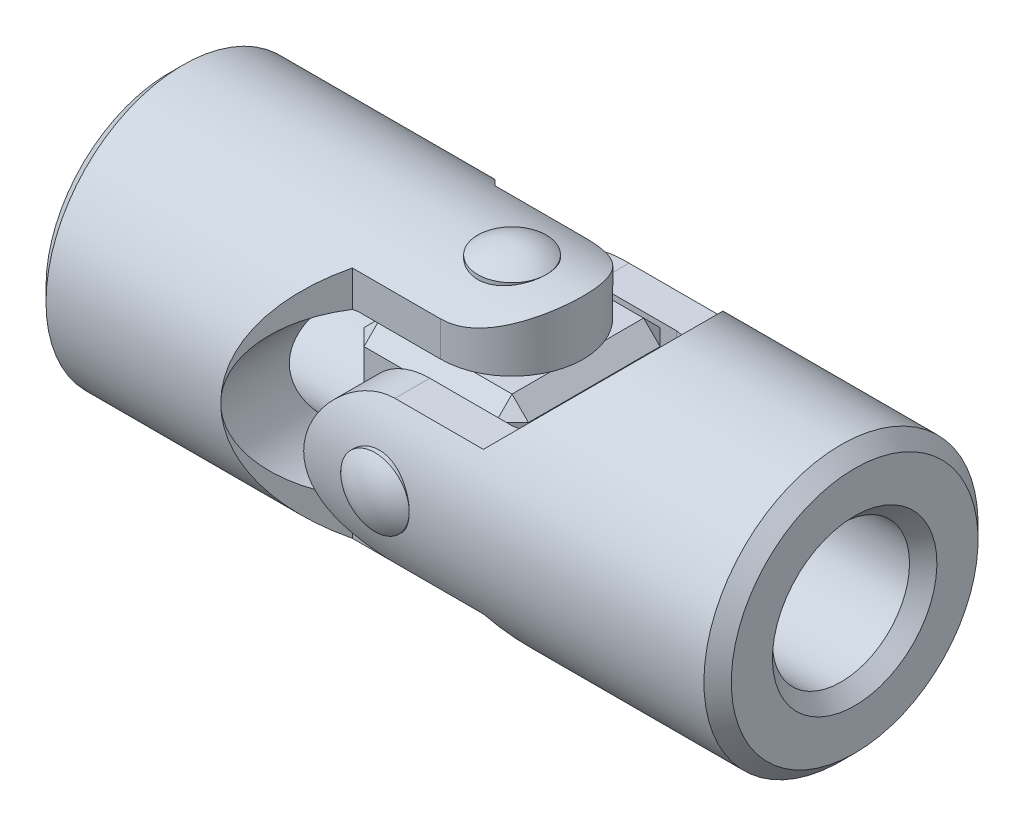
ISO-10303-21;
HEADER;
FILE_DESCRIPTION(('STEP AP214'),'2;1');
FILE_NAME('part.step','',(''),(''),'','','');
FILE_SCHEMA(('AUTOMOTIVE_DESIGN { 1 0 10303 214 1 1 1 1 }'));
ENDSEC;
DATA;
#1=APPLICATION_CONTEXT('core data for automotive mechanical design processes');
#2=APPLICATION_PROTOCOL_DEFINITION('international standard','automotive_design',2000,#1);
#3=PRODUCT_CONTEXT('',#1,'mechanical');
#4=PRODUCT('Part','Part','',(#3));
#5=PRODUCT_RELATED_PRODUCT_CATEGORY('part','',(#4));
#6=PRODUCT_DEFINITION_FORMATION('','',#4);
#7=PRODUCT_DEFINITION_CONTEXT('part definition',#1,'design');
#8=PRODUCT_DEFINITION('design','',#6,#7);
#9=PRODUCT_DEFINITION_SHAPE('','',#8);
#10=(LENGTH_UNIT() NAMED_UNIT(*) SI_UNIT(.MILLI.,.METRE.));
#11=(NAMED_UNIT(*) PLANE_ANGLE_UNIT() SI_UNIT($,.RADIAN.));
#12=(NAMED_UNIT(*) SI_UNIT($,.STERADIAN.) SOLID_ANGLE_UNIT());
#13=UNCERTAINTY_MEASURE_WITH_UNIT(LENGTH_MEASURE(1.E-05),#10,'distance_accuracy_value','');
#14=(GEOMETRIC_REPRESENTATION_CONTEXT(3) GLOBAL_UNCERTAINTY_ASSIGNED_CONTEXT((#13)) GLOBAL_UNIT_ASSIGNED_CONTEXT((#10,
#11,#12)) REPRESENTATION_CONTEXT('',''));
#15=CARTESIAN_POINT('',(0.,0.,0.));
#16=DIRECTION('',(0.,0.,1.));
#17=DIRECTION('',(1.,0.,0.));
#18=AXIS2_PLACEMENT_3D('',#15,#16,#17);
#19=CARTESIAN_POINT('',(0.,8.,0.));
#20=DIRECTION('',(0.,-1.,0.));
#21=DIRECTION('',(-1.,0.,0.));
#22=AXIS2_PLACEMENT_3D('',#19,#20,#21);
#23=CYLINDRICAL_SURFACE('',#22,2.);
#24=CARTESIAN_POINT('',(0.,8.,0.));
#25=DIRECTION('',(0.,1.,0.));
#26=DIRECTION('',(1.,0.,0.));
#27=AXIS2_PLACEMENT_3D('',#24,#25,#26);
#28=CIRCLE('',#27,2.);
#29=CARTESIAN_POINT('',(2.,8.,0.));
#30=VERTEX_POINT('',#29);
#31=EDGE_CURVE('P0_E10',#30,#30,#28,.T.);
#32=ORIENTED_EDGE('',*,*,#31,.F.);
#33=EDGE_LOOP('',(#32));
#34=FACE_BOUND('',#33,.T.);
#35=CARTESIAN_POINT('',(0.,-8.00000000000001,0.));
#36=DIRECTION('',(0.,-1.,0.));
#37=DIRECTION('',(0.,0.,-1.));
#38=AXIS2_PLACEMENT_3D('',#35,#36,#37);
#39=CIRCLE('',#38,2.);
#40=CARTESIAN_POINT('',(0.,-8.,-2.));
#41=VERTEX_POINT('',#40);
#42=EDGE_CURVE('P0_E20',#41,#41,#39,.T.);
#43=ORIENTED_EDGE('',*,*,#42,.F.);
#44=EDGE_LOOP('',(#43));
#45=FACE_BOUND('',#44,.T.);
#46=ADVANCED_FACE('P0_F14',(#34,#45),#23,.T.);
#47=CARTESIAN_POINT('',(0.,5.19500000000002,0.));
#48=DIRECTION('',(0.,-1.,0.));
#49=DIRECTION('',(0.,0.,-1.));
#50=AXIS2_PLACEMENT_3D('',#47,#48,#49);
#51=SPHERICAL_SURFACE('',#50,3.44499999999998);
#52=ORIENTED_EDGE('',*,*,#31,.T.);
#53=EDGE_LOOP('',(#52));
#54=FACE_BOUND('',#53,.T.);
#55=ADVANCED_FACE('P0_F29',(#54),#51,.T.);
#56=CARTESIAN_POINT('',(0.,-5.19500000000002,0.));
#57=DIRECTION('',(0.,1.,0.));
#58=DIRECTION('',(0.,0.,-1.));
#59=AXIS2_PLACEMENT_3D('',#56,#57,#58);
#60=SPHERICAL_SURFACE('',#59,3.44499999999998);
#61=ORIENTED_EDGE('',*,*,#42,.T.);
#62=EDGE_LOOP('',(#61));
#63=FACE_BOUND('',#62,.T.);
#64=ADVANCED_FACE('P0_F26',(#63),#60,.T.);
#65=CLOSED_SHELL('',(#46,#55,#64));
#66=MANIFOLD_SOLID_BREP('P0_B1',#65);
#67=CARTESIAN_POINT('',(0.,0.,8.));
#68=DIRECTION('',(0.,0.,-1.));
#69=DIRECTION('',(-1.,0.,0.));
#70=AXIS2_PLACEMENT_3D('',#67,#68,#69);
#71=CYLINDRICAL_SURFACE('',#70,2.);
#72=CARTESIAN_POINT('',(0.,0.,8.));
#73=DIRECTION('',(0.,0.,1.));
#74=DIRECTION('',(1.,0.,0.));
#75=AXIS2_PLACEMENT_3D('',#72,#73,#74);
#76=CIRCLE('',#75,2.);
#77=CARTESIAN_POINT('',(2.,0.,8.));
#78=VERTEX_POINT('',#77);
#79=EDGE_CURVE('P1_E10',#78,#78,#76,.T.);
#80=ORIENTED_EDGE('',*,*,#79,.F.);
#81=EDGE_LOOP('',(#80));
#82=FACE_BOUND('',#81,.T.);
#83=CARTESIAN_POINT('',(0.,0.,-8.00000000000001));
#84=DIRECTION('',(0.,0.,-1.));
#85=DIRECTION('',(0.,1.,0.));
#86=AXIS2_PLACEMENT_3D('',#83,#84,#85);
#87=CIRCLE('',#86,2.);
#88=CARTESIAN_POINT('',(0.,2.,-8.));
#89=VERTEX_POINT('',#88);
#90=EDGE_CURVE('P1_E20',#89,#89,#87,.T.);
#91=ORIENTED_EDGE('',*,*,#90,.F.);
#92=EDGE_LOOP('',(#91));
#93=FACE_BOUND('',#92,.T.);
#94=ADVANCED_FACE('P1_F14',(#82,#93),#71,.T.);
#95=CARTESIAN_POINT('',(0.,0.,5.19500000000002));
#96=DIRECTION('',(0.,0.,-1.));
#97=DIRECTION('',(0.,1.,0.));
#98=AXIS2_PLACEMENT_3D('',#95,#96,#97);
#99=SPHERICAL_SURFACE('',#98,3.44499999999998);
#100=ORIENTED_EDGE('',*,*,#79,.T.);
#101=EDGE_LOOP('',(#100));
#102=FACE_BOUND('',#101,.T.);
#103=ADVANCED_FACE('P1_F29',(#102),#99,.T.);
#104=CARTESIAN_POINT('',(0.,0.,-5.19500000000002));
#105=DIRECTION('',(0.,0.,1.));
#106=DIRECTION('',(0.,1.,0.));
#107=AXIS2_PLACEMENT_3D('',#104,#105,#106);
#108=SPHERICAL_SURFACE('',#107,3.44499999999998);
#109=ORIENTED_EDGE('',*,*,#90,.T.);
#110=EDGE_LOOP('',(#109));
#111=FACE_BOUND('',#110,.T.);
#112=ADVANCED_FACE('P1_F26',(#111),#108,.T.);
#113=CLOSED_SHELL('',(#94,#103,#112));
#114=MANIFOLD_SOLID_BREP('P1_B1',#113);
#115=CARTESIAN_POINT('',(0.,-8.,-4.16));
#116=DIRECTION('',(0.,0.,1.));
#117=DIRECTION('',(1.,0.,0.));
#118=AXIS2_PLACEMENT_3D('',#115,#116,#117);
#119=PLANE('',#118);
#120=DIRECTION('',(0.,1.,0.));
#121=VECTOR('',#120,1.);
#122=CARTESIAN_POINT('',(0.,-8.,-4.16));
#123=LINE('',#122,#121);
#124=CARTESIAN_POINT('',(0.,4.8,-4.16));
#125=VERTEX_POINT('',#124);
#126=CARTESIAN_POINT('',(0.,6.83333008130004,-4.16));
#127=VERTEX_POINT('',#126);
#128=EDGE_CURVE('P2_E282',#125,#127,#123,.T.);
#129=ORIENTED_EDGE('',*,*,#128,.F.);
#130=DIRECTION('',(-1.,0.,0.));
#131=VECTOR('',#130,1.);
#132=CARTESIAN_POINT('',(0.,4.8,-4.16));
#133=LINE('',#132,#131);
#134=CARTESIAN_POINT('',(-4.80000000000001,4.8,-4.16));
#135=VERTEX_POINT('',#134);
#136=EDGE_CURVE('P2_E132',#125,#135,#133,.T.);
#137=ORIENTED_EDGE('',*,*,#136,.T.);
#138=CARTESIAN_POINT('',(-4.15714285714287,0.,-4.16));
#139=DIRECTION('',(0.,0.,1.));
#140=DIRECTION('',(1.,0.,0.));
#141=AXIS2_PLACEMENT_3D('',#138,#139,#140);
#142=CIRCLE('',#141,4.84285714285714);
#143=CARTESIAN_POINT('',(-5.16000000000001,4.7378837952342,-4.16));
#144=VERTEX_POINT('',#143);
#145=EDGE_CURVE('P2_E146',#135,#144,#142,.T.);
#146=ORIENTED_EDGE('',*,*,#145,.T.);
#147=DIRECTION('',(0.,1.,0.));
#148=VECTOR('',#147,1.);
#149=CARTESIAN_POINT('',(-5.16000000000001,-8.,-4.16));
#150=LINE('',#149,#148);
#151=CARTESIAN_POINT('',(-5.16000000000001,6.83333008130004,-4.16));
#152=VERTEX_POINT('',#151);
#153=EDGE_CURVE('P2_E289',#144,#152,#150,.T.);
#154=ORIENTED_EDGE('',*,*,#153,.T.);
#155=DIRECTION('',(1.,0.,0.));
#156=VECTOR('',#155,1.);
#157=CARTESIAN_POINT('',(-20.,6.83333008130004,-4.15999999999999));
#158=LINE('',#157,#156);
#159=EDGE_CURVE('P2_E227',#127,#152,#158,.F.);
#160=ORIENTED_EDGE('',*,*,#159,.F.);
#161=EDGE_LOOP('',(#129,#137,#146,#154,#160));
#162=FACE_BOUND('',#161,.T.);
#163=ADVANCED_FACE('P2_F16',(#162),#119,.F.);
#164=CARTESIAN_POINT('',(-5.16000000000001,-8.,-4.16));
#165=DIRECTION('',(-0.707106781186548,0.,0.707106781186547));
#166=DIRECTION('',(0.707106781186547,0.,0.707106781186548));
#167=AXIS2_PLACEMENT_3D('',#164,#165,#166);
#168=PLANE('',#167);
#169=CARTESIAN_POINT('',(-1.00000000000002,0.,0.));
#170=DIRECTION('',(-0.707106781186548,0.,0.707106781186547));
#171=DIRECTION('',(0.707106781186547,0.,0.707106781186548));
#172=AXIS2_PLACEMENT_3D('',#169,#170,#171);
#173=ELLIPSE('',#172,11.3137084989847,8.);
#174=CARTESIAN_POINT('',(-9.00000000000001,0.,-8.));
#175=VERTEX_POINT('',#174);
#176=CARTESIAN_POINT('',(-5.16000000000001,-6.83333008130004,-4.16));
#177=VERTEX_POINT('',#176);
#178=EDGE_CURVE('P2_E230',#175,#177,#173,.T.);
#179=ORIENTED_EDGE('',*,*,#178,.F.);
#180=CARTESIAN_POINT('',(-4.15714285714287,0.,-3.15714285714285));
#181=DIRECTION('',(-0.707106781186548,0.,0.707106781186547));
#182=DIRECTION('',(-0.707106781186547,0.,-0.707106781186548));
#183=AXIS2_PLACEMENT_3D('',#180,#181,#182);
#184=ELLIPSE('',#183,6.84883425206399,4.84285714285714);
#185=CARTESIAN_POINT('',(-5.16000000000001,-4.7378837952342,-4.16));
#186=VERTEX_POINT('',#185);
#187=EDGE_CURVE('P2_E143',#175,#186,#184,.T.);
#188=ORIENTED_EDGE('',*,*,#187,.T.);
#189=EDGE_CURVE('P2_E286',#177,#186,#150,.T.);
#190=ORIENTED_EDGE('',*,*,#189,.F.);
#191=EDGE_LOOP('',(#179,#188,#190));
#192=FACE_BOUND('',#191,.T.);
#193=ADVANCED_FACE('P2_F181',(#192),#168,.F.);
#194=CARTESIAN_POINT('',(-5.16000000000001,-8.,4.16));
#195=DIRECTION('',(-0.707106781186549,0.,-0.707106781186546));
#196=DIRECTION('',(-0.707106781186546,0.,0.707106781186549));
#197=AXIS2_PLACEMENT_3D('',#194,#195,#196);
#198=PLANE('',#197);
#199=DIRECTION('',(0.,1.,0.));
#200=VECTOR('',#199,1.);
#201=CARTESIAN_POINT('',(-5.16000000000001,-8.,4.16));
#202=LINE('',#201,#200);
#203=CARTESIAN_POINT('',(-5.16000000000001,-6.83333008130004,4.16));
#204=VERTEX_POINT('',#203);
#205=CARTESIAN_POINT('',(-5.16000000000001,-4.7378837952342,4.16));
#206=VERTEX_POINT('',#205);
#207=EDGE_CURVE('P2_E39',#204,#206,#202,.T.);
#208=ORIENTED_EDGE('',*,*,#207,.T.);
#209=CARTESIAN_POINT('',(-4.15714285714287,0.,3.15714285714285));
#210=DIRECTION('',(-0.707106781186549,0.,-0.707106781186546));
#211=DIRECTION('',(0.707106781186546,0.,-0.707106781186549));
#212=AXIS2_PLACEMENT_3D('',#209,#210,#211);
#213=ELLIPSE('',#212,6.848834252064,4.84285714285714);
#214=CARTESIAN_POINT('',(-9.,0.,8.));
#215=VERTEX_POINT('',#214);
#216=EDGE_CURVE('P2_E107',#206,#215,#213,.T.);
#217=ORIENTED_EDGE('',*,*,#216,.T.);
#218=CARTESIAN_POINT('',(-1.00000000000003,0.,0.));
#219=DIRECTION('',(-0.707106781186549,0.,-0.707106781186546));
#220=DIRECTION('',(0.707106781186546,0.,-0.707106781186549));
#221=AXIS2_PLACEMENT_3D('',#218,#219,#220);
#222=ELLIPSE('',#221,11.3137084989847,8.);
#223=EDGE_CURVE('P2_E241',#204,#215,#222,.T.);
#224=ORIENTED_EDGE('',*,*,#223,.F.);
#225=EDGE_LOOP('',(#208,#217,#224));
#226=FACE_BOUND('',#225,.T.);
#227=ADVANCED_FACE('P2_F185',(#226),#198,.F.);
#228=CARTESIAN_POINT('',(0.,-8.,4.16));
#229=DIRECTION('',(0.,0.,-1.));
#230=DIRECTION('',(-1.,0.,0.));
#231=AXIS2_PLACEMENT_3D('',#228,#229,#230);
#232=PLANE('',#231);
#233=CARTESIAN_POINT('',(-4.15714285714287,0.,4.16));
#234=DIRECTION('',(0.,0.,-1.));
#235=DIRECTION('',(-1.,0.,0.));
#236=AXIS2_PLACEMENT_3D('',#233,#234,#235);
#237=CIRCLE('',#236,4.84285714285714);
#238=CARTESIAN_POINT('',(-5.16000000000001,4.7378837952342,4.16));
#239=VERTEX_POINT('',#238);
#240=CARTESIAN_POINT('',(-4.80000000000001,4.8,4.16));
#241=VERTEX_POINT('',#240);
#242=EDGE_CURVE('P2_E108',#239,#241,#237,.T.);
#243=ORIENTED_EDGE('',*,*,#242,.T.);
#244=DIRECTION('',(1.,0.,0.));
#245=VECTOR('',#244,1.);
#246=CARTESIAN_POINT('',(0.,4.8,4.16));
#247=LINE('',#246,#245);
#248=CARTESIAN_POINT('',(0.,4.8,4.16));
#249=VERTEX_POINT('',#248);
#250=EDGE_CURVE('P2_E129',#241,#249,#247,.T.);
#251=ORIENTED_EDGE('',*,*,#250,.T.);
#252=DIRECTION('',(0.,1.,0.));
#253=VECTOR('',#252,1.);
#254=CARTESIAN_POINT('',(0.,-8.,4.16));
#255=LINE('',#254,#253);
#256=CARTESIAN_POINT('',(0.,6.83333008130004,4.16));
#257=VERTEX_POINT('',#256);
#258=EDGE_CURVE('P2_E154',#249,#257,#255,.T.);
#259=ORIENTED_EDGE('',*,*,#258,.T.);
#260=DIRECTION('',(1.,0.,0.));
#261=VECTOR('',#260,1.);
#262=CARTESIAN_POINT('',(-20.,6.83333008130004,4.16));
#263=LINE('',#262,#261);
#264=CARTESIAN_POINT('',(-5.16000000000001,6.83333008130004,4.16));
#265=VERTEX_POINT('',#264);
#266=EDGE_CURVE('P2_E244',#265,#257,#263,.T.);
#267=ORIENTED_EDGE('',*,*,#266,.F.);
#268=EDGE_CURVE('P2_E292',#239,#265,#202,.T.);
#269=ORIENTED_EDGE('',*,*,#268,.F.);
#270=EDGE_LOOP('',(#243,#251,#259,#267,#269));
#271=FACE_BOUND('',#270,.T.);
#272=ADVANCED_FACE('P2_F188',(#271),#232,.F.);
#273=CARTESIAN_POINT('',(0.,-8.,0.));
#274=DIRECTION('',(0.,1.,0.));
#275=DIRECTION('',(0.,0.,-1.));
#276=AXIS2_PLACEMENT_3D('',#273,#274,#275);
#277=CYLINDRICAL_SURFACE('',#276,4.16);
#278=ORIENTED_EDGE('',*,*,#258,.F.);
#279=CARTESIAN_POINT('',(0.,4.8,0.));
#280=DIRECTION('',(0.,1.,0.));
#281=DIRECTION('',(1.,0.,0.));
#282=AXIS2_PLACEMENT_3D('',#279,#280,#281);
#283=CIRCLE('',#282,4.16);
#284=EDGE_CURVE('P2_E109',#249,#125,#283,.T.);
#285=ORIENTED_EDGE('',*,*,#284,.T.);
#286=ORIENTED_EDGE('',*,*,#128,.T.);
#287=CARTESIAN_POINT('',(0.,6.83333008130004,4.16));
#288=CARTESIAN_POINT('',(0.108261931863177,6.83329587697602,4.16002034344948));
#289=CARTESIAN_POINT('',(0.216504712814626,6.83590202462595,4.15577454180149));
#290=CARTESIAN_POINT('',(0.432026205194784,6.8461370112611,4.13891096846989));
#291=CARTESIAN_POINT('',(0.539305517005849,6.85376246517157,4.12629883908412));
#292=CARTESIAN_POINT('',(0.751468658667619,6.87371719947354,4.09296526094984));
#293=CARTESIAN_POINT('',(0.856363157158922,6.88601728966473,4.07229411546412));
#294=CARTESIAN_POINT('',(1.06368739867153,6.91485928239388,4.02312470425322));
#295=CARTESIAN_POINT('',(1.16611682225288,6.9314017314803,3.99462542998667));
#296=CARTESIAN_POINT('',(1.46823137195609,6.9864922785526,3.89800562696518));
#297=CARTESIAN_POINT('',(1.66343915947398,7.03057502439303,3.81865116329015));
#298=CARTESIAN_POINT('',(2.03791814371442,7.1284378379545,3.63268124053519));
#299=CARTESIAN_POINT('',(2.21716182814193,7.18223418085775,3.52601990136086));
#300=CARTESIAN_POINT('',(2.57198745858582,7.29924876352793,3.27741952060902));
#301=CARTESIAN_POINT('',(2.74582706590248,7.36287944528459,3.13318716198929));
#302=CARTESIAN_POINT('',(3.06824588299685,7.48909161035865,2.81819551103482));
#303=CARTESIAN_POINT('',(3.21681782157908,7.55167278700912,2.64742860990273));
#304=CARTESIAN_POINT('',(3.42309382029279,7.64249982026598,2.36703844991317));
#305=CARTESIAN_POINT('',(3.49106246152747,7.67324869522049,2.26562555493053));
#306=CARTESIAN_POINT('',(3.61812678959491,7.73188589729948,2.05662249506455));
#307=CARTESIAN_POINT('',(3.67722627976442,7.75977544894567,1.94903500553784));
#308=CARTESIAN_POINT('',(3.78597176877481,7.81189514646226,1.72833836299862));
#309=CARTESIAN_POINT('',(3.83561806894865,7.83612540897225,1.61522938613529));
#310=CARTESIAN_POINT('',(3.92485513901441,7.88018918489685,1.38434651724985));
#311=CARTESIAN_POINT('',(3.96445174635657,7.90002524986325,1.26657537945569));
#312=CARTESIAN_POINT('',(4.03049561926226,7.93338177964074,1.03631510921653));
#313=CARTESIAN_POINT('',(4.0577098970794,7.94726597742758,0.924098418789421));
#314=CARTESIAN_POINT('',(4.10275721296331,7.97036021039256,0.697375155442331));
#315=CARTESIAN_POINT('',(4.12059495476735,7.97957258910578,0.582869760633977));
#316=CARTESIAN_POINT('',(4.14665688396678,7.99306191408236,0.352516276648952));
#317=CARTESIAN_POINT('',(4.15488409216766,7.99734041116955,0.236668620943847));
#318=CARTESIAN_POINT('',(4.16161636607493,8.00084010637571,0.00461985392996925));
#319=CARTESIAN_POINT('',(4.16012209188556,8.00006164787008,-0.111581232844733));
#320=CARTESIAN_POINT('',(4.14803118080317,7.99378124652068,-0.332388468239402));
#321=CARTESIAN_POINT('',(4.13830509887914,7.98873108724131,-0.437055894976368));
#322=CARTESIAN_POINT('',(4.1110182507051,7.97463120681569,-0.645101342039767));
#323=CARTESIAN_POINT('',(4.09345498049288,7.96558020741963,-0.748478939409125));
#324=CARTESIAN_POINT('',(4.02927802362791,7.93272127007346,-1.05552159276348));
#325=CARTESIAN_POINT('',(3.97116516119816,7.90320076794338,-1.25630810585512));
#326=CARTESIAN_POINT('',(3.82571613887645,7.83112343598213,-1.64731919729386));
#327=CARTESIAN_POINT('',(3.73801464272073,7.78840422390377,-1.83737523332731));
#328=CARTESIAN_POINT('',(3.53644053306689,7.69369182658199,-2.20053287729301));
#329=CARTESIAN_POINT('',(3.42255856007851,7.64169532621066,-2.37362839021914));
#330=CARTESIAN_POINT('',(3.15881752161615,7.52708788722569,-2.71639244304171));
#331=CARTESIAN_POINT('',(3.00650050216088,7.46393548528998,-2.88399002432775));
#332=CARTESIAN_POINT('',(2.67675331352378,7.33731357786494,-3.19244201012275));
#333=CARTESIAN_POINT('',(2.49929763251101,7.27384381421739,-3.33326890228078));
#334=CARTESIAN_POINT('',(2.10827986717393,7.14861170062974,-3.5944209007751));
#335=CARTESIAN_POINT('',(1.89302312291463,7.08731717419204,-3.71248040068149));
#336=CARTESIAN_POINT('',(1.5551058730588,7.00719397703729,-3.86035932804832));
#337=CARTESIAN_POINT('',(1.44003696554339,6.98246761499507,-3.90476552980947));
#338=CARTESIAN_POINT('',(1.20558279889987,6.93790967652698,-3.9833962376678));
#339=CARTESIAN_POINT('',(1.08619940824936,6.91807600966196,-4.017625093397));
#340=CARTESIAN_POINT('',(0.808335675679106,6.87923025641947,-4.08388443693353));
#341=CARTESIAN_POINT('',(0.648684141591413,6.8621757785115,-4.11230692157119));
#342=CARTESIAN_POINT('',(0.406865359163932,6.84495532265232,-4.14085677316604));
#343=CARTESIAN_POINT('',(0.325750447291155,6.84060850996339,-4.1480262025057));
#344=CARTESIAN_POINT('',(0.163100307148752,6.83479185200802,-4.15759989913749));
#345=CARTESIAN_POINT('',(0.0815649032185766,6.8333233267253,-4.1600019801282));
#346=CARTESIAN_POINT('',(0.,6.83333008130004,-4.16));
#347=B_SPLINE_CURVE_WITH_KNOTS('',3,(#287,#288,#289,#290,#291,#292,#293,#294,#295,#296,#297,
#298,#299,#300,#301,#302,#303,#304,#305,#306,#307,#308,#309,#310,#311,#312,#313,#314,#315,#316,
#317,#318,#319,#320,#321,#322,#323,#324,#325,#326,#327,#328,#329,#330,#331,#332,#333,#334,#335,
#336,#337,#338,#339,#340,#341,#342,#343,#344,#345,#346),.UNSPECIFIED.,.F.,.F.,(4,2,2,2,2,2,2,2,
2,2,2,2,2,2,2,2,2,2,2,2,2,2,2,2,2,2,2,2,2,4),(0.,0.324639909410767,0.649061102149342,
0.971488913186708,1.29395828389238,1.93679706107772,2.58072308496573,3.28189793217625,
3.98327421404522,4.36054531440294,4.73765416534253,5.11475099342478,5.49162827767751,
5.84005408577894,6.18830493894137,6.53644629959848,6.88456402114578,7.19989451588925,
7.51532583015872,8.145560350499,8.78388003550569,9.4224282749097,10.1247861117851,
10.8278619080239,11.5825786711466,11.9594728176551,12.3362056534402,12.8237498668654,
13.0682265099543,13.3128152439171),.UNSPECIFIED.);
#348=EDGE_CURVE('P2_E203',#257,#127,#347,.T.);
#349=ORIENTED_EDGE('',*,*,#348,.F.);
#350=EDGE_LOOP('',(#278,#285,#286,#349));
#351=FACE_BOUND('',#350,.T.);
#352=ADVANCED_FACE('P2_F192',(#351),#277,.T.);
#353=CARTESIAN_POINT('',(-20.,0.,0.));
#354=DIRECTION('',(-1.,0.,0.));
#355=DIRECTION('',(0.,0.,1.));
#356=AXIS2_PLACEMENT_3D('',#353,#354,#355);
#357=PLANE('',#356);
#358=CARTESIAN_POINT('',(-20.,0.,0.));
#359=DIRECTION('',(-1.,0.,0.));
#360=DIRECTION('',(0.,0.,1.));
#361=AXIS2_PLACEMENT_3D('',#358,#359,#360);
#362=CIRCLE('',#361,4.80000000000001);
#363=CARTESIAN_POINT('',(-20.,0.,4.80000000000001));
#364=VERTEX_POINT('',#363);
#365=EDGE_CURVE('P2_E24',#364,#364,#362,.F.);
#366=ORIENTED_EDGE('',*,*,#365,.T.);
#367=EDGE_LOOP('',(#366));
#368=FACE_BOUND('',#367,.T.);
#369=CARTESIAN_POINT('',(-20.,0.,0.));
#370=DIRECTION('',(-1.,0.,0.));
#371=DIRECTION('',(0.,0.,1.));
#372=AXIS2_PLACEMENT_3D('',#369,#370,#371);
#373=CIRCLE('',#372,7.2);
#374=CARTESIAN_POINT('',(-20.,0.,7.2));
#375=VERTEX_POINT('',#374);
#376=EDGE_CURVE('P2_E254',#375,#375,#373,.T.);
#377=ORIENTED_EDGE('',*,*,#376,.T.);
#378=EDGE_LOOP('',(#377));
#379=FACE_BOUND('',#378,.T.);
#380=ADVANCED_FACE('P2_F213',(#368,#379),#357,.T.);
#381=CARTESIAN_POINT('',(-20.,0.,0.));
#382=DIRECTION('',(1.,0.,0.));
#383=DIRECTION('',(0.,0.,-1.));
#384=AXIS2_PLACEMENT_3D('',#381,#382,#383);
#385=CYLINDRICAL_SURFACE('',#384,8.);
#386=CARTESIAN_POINT('',(-19.2,0.,0.));
#387=DIRECTION('',(-1.,0.,0.));
#388=DIRECTION('',(0.,0.,1.));
#389=AXIS2_PLACEMENT_3D('',#386,#387,#388);
#390=CIRCLE('',#389,8.);
#391=CARTESIAN_POINT('',(-19.2,0.,8.));
#392=VERTEX_POINT('',#391);
#393=EDGE_CURVE('P2_E11',#392,#392,#390,.F.);
#394=ORIENTED_EDGE('',*,*,#393,.T.);
#395=EDGE_LOOP('',(#394));
#396=FACE_BOUND('',#395,.T.);
#397=CARTESIAN_POINT('',(2.,-8.,0.));
#398=CARTESIAN_POINT('',(1.99999689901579,-7.9999981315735,-0.110501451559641));
#399=CARTESIAN_POINT('',(1.99081126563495,-7.99768770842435,-0.221037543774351));
#400=CARTESIAN_POINT('',(1.95436646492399,-7.98869485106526,-0.438941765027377));
#401=CARTESIAN_POINT('',(1.92709705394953,-7.98200993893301,-0.546308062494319));
#402=CARTESIAN_POINT('',(1.85541432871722,-7.96500835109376,-0.754694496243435));
#403=CARTESIAN_POINT('',(1.81102160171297,-7.95469603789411,-0.855722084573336));
#404=CARTESIAN_POINT('',(1.70642481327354,-7.93153791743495,-1.04889617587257));
#405=CARTESIAN_POINT('',(1.64622021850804,-7.91869202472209,-1.14104237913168));
#406=CARTESIAN_POINT('',(1.51039894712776,-7.89156551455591,-1.31573590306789));
#407=CARTESIAN_POINT('',(1.43451790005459,-7.87726276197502,-1.39807425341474));
#408=CARTESIAN_POINT('',(1.27006372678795,-7.84898160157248,-1.54899856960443));
#409=CARTESIAN_POINT('',(1.18148916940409,-7.83500323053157,-1.61758298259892));
#410=CARTESIAN_POINT('',(0.992539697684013,-7.80873034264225,-1.74003539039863));
#411=CARTESIAN_POINT('',(0.892009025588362,-7.79646392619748,-1.79366962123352));
#412=CARTESIAN_POINT('',(0.68300211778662,-7.77532659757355,-1.88319587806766));
#413=CARTESIAN_POINT('',(0.574527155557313,-7.76645514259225,-1.91909074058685));
#414=CARTESIAN_POINT('',(0.355008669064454,-7.7533396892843,-1.97140644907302));
#415=CARTESIAN_POINT('',(0.244060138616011,-7.74900654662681,-1.98820302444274));
#416=CARTESIAN_POINT('',(0.0208419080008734,-7.74519149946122,-2.00301570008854));
#417=CARTESIAN_POINT('',(-0.0914275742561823,-7.74570880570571,-2.00103485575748));
#418=CARTESIAN_POINT('',(-0.311221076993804,-7.75145607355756,-1.97864869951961));
#419=CARTESIAN_POINT('',(-0.418794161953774,-7.75657150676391,-1.95869112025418));
#420=CARTESIAN_POINT('',(-0.629014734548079,-7.77075612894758,-1.90163224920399));
#421=CARTESIAN_POINT('',(-0.731661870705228,-7.77982559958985,-1.86452973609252));
#422=CARTESIAN_POINT('',(-0.93031735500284,-7.80100151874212,-1.77385263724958));
#423=CARTESIAN_POINT('',(-1.02624822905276,-7.81313769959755,-1.72011555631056));
#424=CARTESIAN_POINT('',(-1.20789161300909,-7.83906281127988,-1.59780836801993));
#425=CARTESIAN_POINT('',(-1.29360233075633,-7.85285203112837,-1.52923566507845));
#426=CARTESIAN_POINT('',(-1.45493815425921,-7.88101174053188,-1.37688456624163));
#427=CARTESIAN_POINT('',(-1.53020598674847,-7.89538759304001,-1.29272834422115));
#428=CARTESIAN_POINT('',(-1.6656283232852,-7.92274620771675,-1.11281589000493));
#429=CARTESIAN_POINT('',(-1.72578236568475,-7.93572892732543,-1.01705930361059));
#430=CARTESIAN_POINT('',(-1.82940078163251,-7.9589030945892,-0.816154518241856));
#431=CARTESIAN_POINT('',(-1.87280712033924,-7.96908480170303,-0.710975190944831));
#432=CARTESIAN_POINT('',(-1.94122307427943,-7.98543889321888,-0.49450134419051));
#433=CARTESIAN_POINT('',(-1.96623620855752,-7.99161204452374,-0.383207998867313));
#434=CARTESIAN_POINT('',(-1.99661008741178,-7.999139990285,-0.160719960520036));
#435=CARTESIAN_POINT('',(-2.0024573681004,-8.00061404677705,-0.0495956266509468));
#436=CARTESIAN_POINT('',(-1.99566799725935,-7.99891739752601,0.172043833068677));
#437=CARTESIAN_POINT('',(-1.98303300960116,-7.99574710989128,0.28255901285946));
#438=CARTESIAN_POINT('',(-1.94003878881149,-7.98519441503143,0.498152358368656));
#439=CARTESIAN_POINT('',(-1.90994498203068,-7.97787512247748,0.603286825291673));
#440=CARTESIAN_POINT('',(-1.83319055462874,-7.95984942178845,0.807009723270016));
#441=CARTESIAN_POINT('',(-1.78652826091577,-7.94914267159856,0.905597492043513));
#442=CARTESIAN_POINT('',(-1.6770184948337,-7.92524410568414,1.0953641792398));
#443=CARTESIAN_POINT('',(-1.61389851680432,-7.91201156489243,1.18638058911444));
#444=CARTESIAN_POINT('',(-1.47361345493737,-7.88459345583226,1.35670215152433));
#445=CARTESIAN_POINT('',(-1.39644594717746,-7.87040772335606,1.43600527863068));
#446=CARTESIAN_POINT('',(-1.22799738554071,-7.84225275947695,1.58265409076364));
#447=CARTESIAN_POINT('',(-1.13641639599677,-7.82829738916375,1.64965849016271));
#448=CARTESIAN_POINT('',(-0.943023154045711,-7.80257171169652,1.7673476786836));
#449=CARTESIAN_POINT('',(-0.841211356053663,-7.79080130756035,1.81803319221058));
#450=CARTESIAN_POINT('',(-0.630792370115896,-7.77090792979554,1.90126856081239));
#451=CARTESIAN_POINT('',(-0.522229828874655,-7.76276340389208,1.93392586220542));
#452=CARTESIAN_POINT('',(-0.300920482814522,-7.75102325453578,1.98046087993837));
#453=CARTESIAN_POINT('',(-0.188174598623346,-7.74742663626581,1.99434270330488));
#454=CARTESIAN_POINT('',(0.0348280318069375,-7.74526534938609,2.00271812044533));
#455=CARTESIAN_POINT('',(0.145063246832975,-7.74655910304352,1.99775719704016));
#456=CARTESIAN_POINT('',(0.363071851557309,-7.7537054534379,1.96983637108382));
#457=CARTESIAN_POINT('',(0.470845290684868,-7.75955795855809,1.94687683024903));
#458=CARTESIAN_POINT('',(0.680277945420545,-7.77508347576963,1.88390842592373));
#459=CARTESIAN_POINT('',(0.781969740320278,-7.78473353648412,1.84400187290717));
#460=CARTESIAN_POINT('',(0.977287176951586,-7.80677007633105,1.74835321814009));
#461=CARTESIAN_POINT('',(1.07091169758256,-7.81915693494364,1.69260892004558));
#462=CARTESIAN_POINT('',(1.25007283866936,-7.8456751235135,1.56515699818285));
#463=CARTESIAN_POINT('',(1.33533476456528,-7.85984353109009,1.49307088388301));
#464=CARTESIAN_POINT('',(1.49272939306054,-7.88810702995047,1.33571916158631));
#465=CARTESIAN_POINT('',(1.56485897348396,-7.90220210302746,1.25045042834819));
#466=CARTESIAN_POINT('',(1.69521507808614,-7.92903540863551,1.06729011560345));
#467=CARTESIAN_POINT('',(1.75316615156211,-7.94174444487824,0.969197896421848));
#468=CARTESIAN_POINT('',(1.85166328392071,-7.96406566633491,0.764354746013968));
#469=CARTESIAN_POINT('',(1.89222181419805,-7.97368006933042,0.657610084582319));
#470=CARTESIAN_POINT('',(1.94876244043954,-7.98730746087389,0.459213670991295));
#471=CARTESIAN_POINT('',(1.96793499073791,-7.9920344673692,0.368506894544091));
#472=CARTESIAN_POINT('',(1.99355459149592,-7.99838140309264,0.185208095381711));
#473=CARTESIAN_POINT('',(2.00000259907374,-8.00000156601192,0.0926162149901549));
#474=CARTESIAN_POINT('',(2.,-8.,0.));
#475=B_SPLINE_CURVE_WITH_KNOTS('',3,(#397,#398,#399,#400,#401,#402,#403,#404,#405,#406,#407,
#408,#409,#410,#411,#412,#413,#414,#415,#416,#417,#418,#419,#420,#421,#422,#423,#424,#425,#426,
#427,#428,#429,#430,#431,#432,#433,#434,#435,#436,#437,#438,#439,#440,#441,#442,#443,#444,#445,
#446,#447,#448,#449,#450,#451,#452,#453,#454,#455,#456,#457,#458,#459,#460,#461,#462,#463,#464,
#465,#466,#467,#468,#469,#470,#471,#472,#473,#474),.UNSPECIFIED.,.T.,.F.,(4,2,2,2,2,2,2,2,2,2,2,
2,2,2,2,2,2,2,2,2,2,2,2,2,2,2,2,2,2,2,2,2,2,2,2,2,2,2,4),(0.,0.33116494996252,0.662517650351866,
0.993473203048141,1.32443992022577,1.66152580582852,1.99864972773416,2.34078196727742,
2.68285948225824,3.01808393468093,3.3532538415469,3.68029996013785,4.00736937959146,
4.337740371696,4.66816921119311,5.00802001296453,5.34788119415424,5.6889097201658,
6.02987298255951,6.36211078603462,6.69431868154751,7.02160366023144,7.34892169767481,
7.68204783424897,8.01523150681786,8.35659345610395,8.69794025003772,9.03723006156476,
9.37644564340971,9.70591707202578,10.0353818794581,10.3628853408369,10.6904342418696,
11.0265276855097,11.3627009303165,11.7049624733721,12.0469781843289,12.3245632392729,
12.6021274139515),.UNSPECIFIED.);
#476=CARTESIAN_POINT('',(2.,-8.,0.));
#477=VERTEX_POINT('',#476);
#478=EDGE_CURVE('P2_E222',#477,#477,#475,.T.);
#479=ORIENTED_EDGE('',*,*,#478,.T.);
#480=EDGE_LOOP('',(#479));
#481=FACE_BOUND('',#480,.T.);
#482=CARTESIAN_POINT('',(0.,7.74596669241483,-2.));
#483=CARTESIAN_POINT('',(0.110440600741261,7.74596880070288,-1.99999686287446));
#484=CARTESIAN_POINT('',(0.220915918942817,7.74835444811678,-1.99082099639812));
#485=CARTESIAN_POINT('',(0.438694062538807,7.75761489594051,-1.95441850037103));
#486=CARTESIAN_POINT('',(0.545995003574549,7.76449230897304,-1.92718136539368));
#487=CARTESIAN_POINT('',(0.754242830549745,7.7819097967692,-1.85559295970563));
#488=CARTESIAN_POINT('',(0.855197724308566,7.79244514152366,-1.81126378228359));
#489=CARTESIAN_POINT('',(1.04824868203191,7.81598553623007,-1.70681691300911));
#490=CARTESIAN_POINT('',(1.14034436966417,7.82899069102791,-1.64669855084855));
#491=CARTESIAN_POINT('',(1.31508931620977,7.856325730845,-1.51096674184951));
#492=CARTESIAN_POINT('',(1.39751488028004,7.87067678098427,-1.43506951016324));
#493=CARTESIAN_POINT('',(1.54860911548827,7.89890300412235,-1.27054565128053));
#494=CARTESIAN_POINT('',(1.6172765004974,7.91277813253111,-1.18191783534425));
#495=CARTESIAN_POINT('',(1.73982037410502,7.93872332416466,-0.992916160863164));
#496=CARTESIAN_POINT('',(1.79347711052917,7.95076549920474,-0.892395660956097));
#497=CARTESIAN_POINT('',(1.88304771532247,7.97144649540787,-0.68341054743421));
#498=CARTESIAN_POINT('',(1.91896420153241,7.98008581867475,-0.574947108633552));
#499=CARTESIAN_POINT('',(1.97131826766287,7.99283807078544,-0.355487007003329));
#500=CARTESIAN_POINT('',(1.98813571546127,7.99703915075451,-0.24458617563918));
#501=CARTESIAN_POINT('',(2.00300670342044,8.00074875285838,-0.0214630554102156));
#502=CARTESIAN_POINT('',(2.00106301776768,8.00025796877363,0.0907590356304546));
#503=CARTESIAN_POINT('',(1.97874011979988,7.99470475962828,0.310704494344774));
#504=CARTESIAN_POINT('',(1.95877093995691,7.98974401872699,0.418472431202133));
#505=CARTESIAN_POINT('',(1.9016229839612,7.97592669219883,0.629076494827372));
#506=CARTESIAN_POINT('',(1.86444329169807,7.96706989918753,0.731912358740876));
#507=CARTESIAN_POINT('',(1.77359794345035,7.94630007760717,0.930813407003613));
#508=CARTESIAN_POINT('',(1.7197863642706,7.93436015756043,1.02680901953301));
#509=CARTESIAN_POINT('',(1.59731545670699,7.90871923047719,1.20855124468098));
#510=CARTESIAN_POINT('',(1.5286535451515,7.89501791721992,1.29429607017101));
#511=CARTESIAN_POINT('',(1.3762330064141,7.86690971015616,1.45554807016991));
#512=CARTESIAN_POINT('',(1.29211608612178,7.85249375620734,1.5307153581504));
#513=CARTESIAN_POINT('',(1.1123200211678,7.82492034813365,1.66595275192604));
#514=CARTESIAN_POINT('',(1.0166403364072,7.81176295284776,1.72602215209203));
#515=CARTESIAN_POINT('',(0.815767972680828,7.78816397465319,1.8295762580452));
#516=CARTESIAN_POINT('',(0.710531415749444,7.77773586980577,1.87297913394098));
#517=CARTESIAN_POINT('',(0.493931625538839,7.76094912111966,1.94137124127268));
#518=CARTESIAN_POINT('',(0.382569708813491,7.75458960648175,1.96636441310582));
#519=CARTESIAN_POINT('',(0.160032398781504,7.74684284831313,1.99666371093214));
#520=CARTESIAN_POINT('',(0.0489297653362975,7.74532871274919,2.0024723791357));
#521=CARTESIAN_POINT('',(-0.172657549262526,7.74709874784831,1.99561359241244));
#522=CARTESIAN_POINT('',(-0.283142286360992,7.75038247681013,1.98294783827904));
#523=CARTESIAN_POINT('',(-0.498491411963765,7.76125665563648,1.93994037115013));
#524=CARTESIAN_POINT('',(-0.603418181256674,7.768775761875,1.9098912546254));
#525=CARTESIAN_POINT('',(-0.806745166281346,7.7872057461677,1.8332944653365));
#526=CARTESIAN_POINT('',(-0.905144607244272,7.79811702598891,1.78674483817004));
#527=CARTESIAN_POINT('',(-1.09475302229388,7.8223690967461,1.67741653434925));
#528=CARTESIAN_POINT('',(-1.18578307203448,7.83575334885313,1.6143374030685));
#529=CARTESIAN_POINT('',(-1.35615069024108,7.86333666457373,1.47412058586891));
#530=CARTESIAN_POINT('',(-1.43548633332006,7.87753586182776,1.39698058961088));
#531=CARTESIAN_POINT('',(-1.58224883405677,7.90557922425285,1.22852544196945));
#532=CARTESIAN_POINT('',(-1.64932805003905,7.91940561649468,1.13690390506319));
#533=CARTESIAN_POINT('',(-1.76714869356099,7.94477773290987,0.94340536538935));
#534=CARTESIAN_POINT('',(-1.81789097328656,7.95632357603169,0.841528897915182));
#535=CARTESIAN_POINT('',(-1.90115682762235,7.9757609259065,0.631116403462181));
#536=CARTESIAN_POINT('',(-1.93381142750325,7.98367864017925,0.522634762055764));
#537=CARTESIAN_POINT('',(-1.98036826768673,7.99508234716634,0.301499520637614));
#538=CARTESIAN_POINT('',(-1.99427412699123,7.99856919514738,0.188846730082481));
#539=CARTESIAN_POINT('',(-2.00273517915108,8.00068338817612,-0.0341670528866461));
#540=CARTESIAN_POINT('',(-1.99780341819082,7.99943957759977,-0.144507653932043));
#541=CARTESIAN_POINT('',(-1.9699043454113,7.99251792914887,-0.362734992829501));
#542=CARTESIAN_POINT('',(-1.94693756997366,7.98684022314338,-0.470621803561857));
#543=CARTESIAN_POINT('',(-1.88389556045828,7.97170865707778,-0.680342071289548));
#544=CARTESIAN_POINT('',(-1.84391309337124,7.96227529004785,-0.782204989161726));
#545=CARTESIAN_POINT('',(-1.74805884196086,7.94062577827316,-0.977834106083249));
#546=CARTESIAN_POINT('',(-1.69218505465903,7.92840928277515,-1.07159928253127));
#547=CARTESIAN_POINT('',(-1.56456953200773,7.90214499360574,-1.25080385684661));
#548=CARTESIAN_POINT('',(-1.49247971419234,7.88806033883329,-1.33598997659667));
#549=CARTESIAN_POINT('',(-1.3351542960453,7.85981298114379,-1.49323004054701));
#550=CARTESIAN_POINT('',(-1.24991536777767,7.84565025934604,-1.56528065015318));
#551=CARTESIAN_POINT('',(-1.06679717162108,7.81854951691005,-1.69552405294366));
#552=CARTESIAN_POINT('',(-0.968711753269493,7.80563927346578,-1.75343323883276));
#553=CARTESIAN_POINT('',(-0.763889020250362,7.78287910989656,-1.85185379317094));
#554=CARTESIAN_POINT('',(-0.657158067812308,7.77302696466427,-1.8923778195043));
#555=CARTESIAN_POINT('',(-0.458845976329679,7.75903817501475,-1.94884505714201));
#556=CARTESIAN_POINT('',(-0.368213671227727,7.75417326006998,-1.96798634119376));
#557=CARTESIAN_POINT('',(-0.185062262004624,7.7476367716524,-1.99356458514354));
#558=CARTESIAN_POINT('',(-0.0925433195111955,7.74596492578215,-2.0000026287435));
#559=CARTESIAN_POINT('',(0.,7.74596669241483,-2.));
#560=B_SPLINE_CURVE_WITH_KNOTS('',3,(#482,#483,#484,#485,#486,#487,#488,#489,#490,#491,#492,
#493,#494,#495,#496,#497,#498,#499,#500,#501,#502,#503,#504,#505,#506,#507,#508,#509,#510,#511,
#512,#513,#514,#515,#516,#517,#518,#519,#520,#521,#522,#523,#524,#525,#526,#527,#528,#529,#530,
#531,#532,#533,#534,#535,#536,#537,#538,#539,#540,#541,#542,#543,#544,#545,#546,#547,#548,#549,
#550,#551,#552,#553,#554,#555,#556,#557,#558,#559),.UNSPECIFIED.,.T.,.F.,(4,2,2,2,2,2,2,2,2,2,2,
2,2,2,2,2,2,2,2,2,2,2,2,2,2,2,2,2,2,2,2,2,2,2,2,2,2,2,4),(0.,0.330981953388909,
0.662156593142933,0.992904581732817,1.32366661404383,1.66099163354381,1.99834817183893,
2.34041197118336,2.68242527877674,3.01751000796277,3.35254518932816,3.68014610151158,
4.00776445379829,4.33834299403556,4.66897908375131,5.00856373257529,5.34816424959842,
5.68941145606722,6.03058560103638,6.36274859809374,6.69488101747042,7.02157924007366,
7.34831617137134,7.68146276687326,8.01466415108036,8.35620264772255,8.69772332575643,
9.03673658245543,9.3756843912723,9.70546756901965,10.0352409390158,10.3632390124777,
10.6912784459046,11.0271767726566,11.3631602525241,11.7054118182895,12.0474137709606,
12.3247826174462,12.6021278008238),.UNSPECIFIED.);
#561=CARTESIAN_POINT('',(0.,7.74596669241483,-2.));
#562=VERTEX_POINT('',#561);
#563=EDGE_CURVE('P2_E217',#562,#562,#560,.T.);
#564=ORIENTED_EDGE('',*,*,#563,.T.);
#565=EDGE_LOOP('',(#564));
#566=FACE_BOUND('',#565,.T.);
#567=ORIENTED_EDGE('',*,*,#266,.T.);
#568=ORIENTED_EDGE('',*,*,#348,.T.);
#569=ORIENTED_EDGE('',*,*,#159,.T.);
#570=EDGE_CURVE('P2_E231',#152,#175,#173,.T.);
#571=ORIENTED_EDGE('',*,*,#570,.T.);
#572=ORIENTED_EDGE('',*,*,#178,.T.);
#573=DIRECTION('',(1.,0.,0.));
#574=VECTOR('',#573,1.);
#575=CARTESIAN_POINT('',(-20.,-6.83333008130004,-4.15999999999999));
#576=LINE('',#575,#574);
#577=CARTESIAN_POINT('',(0.,-6.83333008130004,-4.16));
#578=VERTEX_POINT('',#577);
#579=EDGE_CURVE('P2_E234',#177,#578,#576,.T.);
#580=ORIENTED_EDGE('',*,*,#579,.T.);
#581=CARTESIAN_POINT('',(0.,-6.83333008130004,-4.16));
#582=CARTESIAN_POINT('',(0.108261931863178,-6.83329587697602,-4.16002034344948));
#583=CARTESIAN_POINT('',(0.216504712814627,-6.83590202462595,-4.15577454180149));
#584=CARTESIAN_POINT('',(0.432026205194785,-6.8461370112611,-4.13891096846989));
#585=CARTESIAN_POINT('',(0.539305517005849,-6.85376246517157,-4.12629883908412));
#586=CARTESIAN_POINT('',(0.75146865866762,-6.87371719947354,-4.09296526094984));
#587=CARTESIAN_POINT('',(0.856363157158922,-6.88601728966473,-4.07229411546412));
#588=CARTESIAN_POINT('',(1.06368739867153,-6.91485928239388,-4.02312470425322));
#589=CARTESIAN_POINT('',(1.16611682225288,-6.9314017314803,-3.99462542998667));
#590=CARTESIAN_POINT('',(1.46823137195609,-6.9864922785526,-3.89800562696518));
#591=CARTESIAN_POINT('',(1.66343915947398,-7.03057502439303,-3.81865116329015));
#592=CARTESIAN_POINT('',(2.03791814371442,-7.1284378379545,-3.63268124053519));
#593=CARTESIAN_POINT('',(2.21716182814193,-7.18223418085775,-3.52601990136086));
#594=CARTESIAN_POINT('',(2.57198745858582,-7.29924876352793,-3.27741952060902));
#595=CARTESIAN_POINT('',(2.74582706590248,-7.36287944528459,-3.13318716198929));
#596=CARTESIAN_POINT('',(3.06824588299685,-7.48909161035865,-2.81819551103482));
#597=CARTESIAN_POINT('',(3.21681782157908,-7.55167278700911,-2.64742860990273));
#598=CARTESIAN_POINT('',(3.42309382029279,-7.64249982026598,-2.36703844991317));
#599=CARTESIAN_POINT('',(3.49106246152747,-7.67324869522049,-2.26562555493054));
#600=CARTESIAN_POINT('',(3.61812678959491,-7.73188589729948,-2.05662249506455));
#601=CARTESIAN_POINT('',(3.67722627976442,-7.75977544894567,-1.94903500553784));
#602=CARTESIAN_POINT('',(3.78597176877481,-7.81189514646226,-1.72833836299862));
#603=CARTESIAN_POINT('',(3.83561806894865,-7.83612540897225,-1.61522938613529));
#604=CARTESIAN_POINT('',(3.92485513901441,-7.88018918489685,-1.38434651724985));
#605=CARTESIAN_POINT('',(3.96445174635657,-7.90002524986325,-1.26657537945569));
#606=CARTESIAN_POINT('',(4.03049561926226,-7.93338177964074,-1.03631510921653));
#607=CARTESIAN_POINT('',(4.0577098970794,-7.94726597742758,-0.924098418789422));
#608=CARTESIAN_POINT('',(4.10275721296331,-7.97036021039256,-0.697375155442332));
#609=CARTESIAN_POINT('',(4.12059495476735,-7.97957258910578,-0.582869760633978));
#610=CARTESIAN_POINT('',(4.14665688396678,-7.99306191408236,-0.352516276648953));
#611=CARTESIAN_POINT('',(4.15488409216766,-7.99734041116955,-0.236668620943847));
#612=CARTESIAN_POINT('',(4.16161636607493,-8.00084010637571,-0.0046198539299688));
#613=CARTESIAN_POINT('',(4.16012209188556,-8.00006164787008,0.111581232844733));
#614=CARTESIAN_POINT('',(4.14803118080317,-7.99378124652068,0.332388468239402));
#615=CARTESIAN_POINT('',(4.13830509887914,-7.98873108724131,0.437055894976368));
#616=CARTESIAN_POINT('',(4.1110182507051,-7.97463120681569,0.645101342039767));
#617=CARTESIAN_POINT('',(4.09345498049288,-7.96558020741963,0.748478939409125));
#618=CARTESIAN_POINT('',(4.02927802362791,-7.93272127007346,1.05552159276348));
#619=CARTESIAN_POINT('',(3.97116516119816,-7.90320076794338,1.25630810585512));
#620=CARTESIAN_POINT('',(3.82571613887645,-7.83112343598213,1.64731919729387));
#621=CARTESIAN_POINT('',(3.73801464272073,-7.78840422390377,1.83737523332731));
#622=CARTESIAN_POINT('',(3.53644053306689,-7.69369182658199,2.20053287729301));
#623=CARTESIAN_POINT('',(3.42255856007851,-7.64169532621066,2.37362839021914));
#624=CARTESIAN_POINT('',(3.15881752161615,-7.52708788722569,2.71639244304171));
#625=CARTESIAN_POINT('',(3.00650050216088,-7.46393548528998,2.88399002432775));
#626=CARTESIAN_POINT('',(2.67675331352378,-7.33731357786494,3.19244201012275));
#627=CARTESIAN_POINT('',(2.49929763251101,-7.27384381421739,3.33326890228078));
#628=CARTESIAN_POINT('',(2.10827986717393,-7.14861170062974,3.5944209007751));
#629=CARTESIAN_POINT('',(1.89302312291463,-7.08731717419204,3.71248040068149));
#630=CARTESIAN_POINT('',(1.5551058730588,-7.00719397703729,3.86035932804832));
#631=CARTESIAN_POINT('',(1.44003696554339,-6.98246761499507,3.90476552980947));
#632=CARTESIAN_POINT('',(1.20558279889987,-6.93790967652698,3.9833962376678));
#633=CARTESIAN_POINT('',(1.08619940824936,-6.91807600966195,4.017625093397));
#634=CARTESIAN_POINT('',(0.808335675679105,-6.87923025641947,4.08388443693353));
#635=CARTESIAN_POINT('',(0.648684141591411,-6.8621757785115,4.11230692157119));
#636=CARTESIAN_POINT('',(0.40686535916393,-6.84495532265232,4.14085677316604));
#637=CARTESIAN_POINT('',(0.325750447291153,-6.84060850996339,4.1480262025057));
#638=CARTESIAN_POINT('',(0.163100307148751,-6.83479185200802,4.15759989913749));
#639=CARTESIAN_POINT('',(0.081564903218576,-6.8333233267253,4.1600019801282));
#640=CARTESIAN_POINT('',(0.,-6.83333008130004,4.16));
#641=B_SPLINE_CURVE_WITH_KNOTS('',3,(#581,#582,#583,#584,#585,#586,#587,#588,#589,#590,#591,
#592,#593,#594,#595,#596,#597,#598,#599,#600,#601,#602,#603,#604,#605,#606,#607,#608,#609,#610,
#611,#612,#613,#614,#615,#616,#617,#618,#619,#620,#621,#622,#623,#624,#625,#626,#627,#628,#629,
#630,#631,#632,#633,#634,#635,#636,#637,#638,#639,#640),.UNSPECIFIED.,.F.,.F.,(4,2,2,2,2,2,2,2,
2,2,2,2,2,2,2,2,2,2,2,2,2,2,2,2,2,2,2,2,2,4),(0.,0.324639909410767,0.649061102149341,
0.971488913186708,1.29395828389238,1.93679706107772,2.58072308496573,3.28189793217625,
3.98327421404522,4.36054531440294,4.73765416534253,5.11475099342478,5.49162827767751,
5.84005408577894,6.18830493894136,6.53644629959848,6.88456402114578,7.19989451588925,
7.51532583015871,8.145560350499,8.78388003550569,9.4224282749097,10.1247861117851,
10.8278619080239,11.5825786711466,11.9594728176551,12.3362056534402,12.8237498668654,
13.0682265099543,13.3128152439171),.UNSPECIFIED.);
#642=CARTESIAN_POINT('',(0.,-6.83333008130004,4.16));
#643=VERTEX_POINT('',#642);
#644=EDGE_CURVE('P2_E196',#578,#643,#641,.T.);
#645=ORIENTED_EDGE('',*,*,#644,.T.);
#646=DIRECTION('',(1.,0.,0.));
#647=VECTOR('',#646,1.);
#648=CARTESIAN_POINT('',(-20.,-6.83333008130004,4.16));
#649=LINE('',#648,#647);
#650=EDGE_CURVE('P2_E237',#643,#204,#649,.F.);
#651=ORIENTED_EDGE('',*,*,#650,.T.);
#652=ORIENTED_EDGE('',*,*,#223,.T.);
#653=EDGE_CURVE('P2_E240',#215,#265,#222,.T.);
#654=ORIENTED_EDGE('',*,*,#653,.T.);
#655=EDGE_LOOP('',(#567,#568,#569,#571,#572,#580,#645,#651,#652,#654));
#656=FACE_BOUND('',#655,.T.);
#657=ADVANCED_FACE('P2_F210',(#396,#481,#566,#656),#385,.T.);
#658=CARTESIAN_POINT('',(-20.,0.,0.));
#659=DIRECTION('',(1.,0.,0.));
#660=DIRECTION('',(0.,0.,-1.));
#661=AXIS2_PLACEMENT_3D('',#658,#659,#660);
#662=CYLINDRICAL_SURFACE('',#661,4.);
#663=CARTESIAN_POINT('',(-19.2,0.,0.));
#664=DIRECTION('',(-1.,0.,0.));
#665=DIRECTION('',(0.,0.,1.));
#666=AXIS2_PLACEMENT_3D('',#663,#664,#665);
#667=CIRCLE('',#666,4.);
#668=CARTESIAN_POINT('',(-19.2,0.,4.));
#669=VERTEX_POINT('',#668);
#670=EDGE_CURVE('P2_E251',#669,#669,#667,.T.);
#671=ORIENTED_EDGE('',*,*,#670,.T.);
#672=EDGE_LOOP('',(#671));
#673=FACE_BOUND('',#672,.T.);
#674=CARTESIAN_POINT('',(-9.00000000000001,0.,-4.));
#675=CARTESIAN_POINT('',(-9.00000131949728,-0.0952399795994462,-4.00000134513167));
#676=CARTESIAN_POINT('',(-8.99718556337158,-0.190465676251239,-3.99659385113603));
#677=CARTESIAN_POINT('',(-8.98599213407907,-0.380138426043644,-3.98303088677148));
#678=CARTESIAN_POINT('',(-8.97761276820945,-0.47458523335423,-3.97287336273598));
#679=CARTESIAN_POINT('',(-8.95547100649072,-0.661982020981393,-3.94597850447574));
#680=CARTESIAN_POINT('',(-8.94170379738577,-0.754930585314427,-3.92923528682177));
#681=CARTESIAN_POINT('',(-8.90909489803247,-0.938580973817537,-3.8894614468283));
#682=CARTESIAN_POINT('',(-8.89025094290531,-1.02928177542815,-3.86642801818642));
#683=CARTESIAN_POINT('',(-8.82694511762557,-1.29589233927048,-3.78875969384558));
#684=CARTESIAN_POINT('',(-8.77553683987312,-1.4676973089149,-3.72535018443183));
#685=CARTESIAN_POINT('',(-8.65777852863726,-1.79671066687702,-3.57832290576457));
#686=CARTESIAN_POINT('',(-8.59142524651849,-1.95391587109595,-3.4947007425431));
#687=CARTESIAN_POINT('',(-8.47049723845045,-2.20476966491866,-3.33965591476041));
#688=CARTESIAN_POINT('',(-8.41887725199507,-2.30274351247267,-3.27279709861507));
#689=CARTESIAN_POINT('',(-8.31163583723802,-2.49102097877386,-3.13187479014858));
#690=CARTESIAN_POINT('',(-8.25601435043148,-2.58132448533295,-3.0578111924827));
#691=CARTESIAN_POINT('',(-8.14177983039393,-2.75439966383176,-2.90289748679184));
#692=CARTESIAN_POINT('',(-8.08315873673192,-2.8371491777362,-2.82202867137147));
#693=CARTESIAN_POINT('',(-7.96427872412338,-2.99478234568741,-2.65415382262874));
#694=CARTESIAN_POINT('',(-7.90402042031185,-3.06966890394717,-2.56715007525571));
#695=CARTESIAN_POINT('',(-7.78202550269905,-3.21286365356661,-2.38560562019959));
#696=CARTESIAN_POINT('',(-7.72028174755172,-3.2810299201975,-2.29095779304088));
#697=CARTESIAN_POINT('',(-7.59788628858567,-3.40916392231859,-2.0955335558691));
#698=CARTESIAN_POINT('',(-7.53723495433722,-3.4691289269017,-1.99475512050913));
#699=CARTESIAN_POINT('',(-7.41905337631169,-3.58047124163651,-1.78719378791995));
#700=CARTESIAN_POINT('',(-7.36151575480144,-3.63186951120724,-1.68042642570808));
#701=CARTESIAN_POINT('',(-7.25184467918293,-3.72576046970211,-1.46047807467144));
#702=CARTESIAN_POINT('',(-7.19970660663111,-3.7682608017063,-1.3473026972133));
#703=CARTESIAN_POINT('',(-7.09884066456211,-3.84762494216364,-1.1018706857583));
#704=CARTESIAN_POINT('',(-7.05105666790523,-3.88341722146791,-0.96886191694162));
#705=CARTESIAN_POINT('',(-6.97139020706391,-3.94154010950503,-0.695482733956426));
#706=CARTESIAN_POINT('',(-6.9394684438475,-3.96390401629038,-0.555131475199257));
#707=CARTESIAN_POINT('',(-6.89662201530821,-3.99365435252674,-0.267829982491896));
#708=CARTESIAN_POINT('',(-6.88593946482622,-4.00086813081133,-0.120822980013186));
#709=CARTESIAN_POINT('',(-6.88872807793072,-3.99896258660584,0.172866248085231));
#710=CARTESIAN_POINT('',(-6.90220552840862,-3.98983901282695,0.319548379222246));
#711=CARTESIAN_POINT('',(-6.95278963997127,-3.95456763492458,0.622064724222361));
#712=CARTESIAN_POINT('',(-6.99216965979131,-3.92677581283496,0.77730298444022));
#713=CARTESIAN_POINT('',(-7.08895009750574,-3.85504183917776,1.0783141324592));
#714=CARTESIAN_POINT('',(-7.1464086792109,-3.81104748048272,1.22405461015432));
#715=CARTESIAN_POINT('',(-7.25864178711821,-3.71995086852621,1.47503889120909));
#716=CARTESIAN_POINT('',(-7.31133373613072,-3.67555407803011,1.58224897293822));
#717=CARTESIAN_POINT('',(-7.42090693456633,-3.57861130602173,1.79074444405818));
#718=CARTESIAN_POINT('',(-7.47779051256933,-3.52606077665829,1.89202648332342));
#719=CARTESIAN_POINT('',(-7.59380203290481,-3.41309375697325,2.08894505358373));
#720=CARTESIAN_POINT('',(-7.65293284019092,-3.35266696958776,2.18457395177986));
#721=CARTESIAN_POINT('',(-7.77178773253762,-3.22416945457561,2.37011842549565));
#722=CARTESIAN_POINT('',(-7.83151170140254,-3.15610019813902,2.4600350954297));
#723=CARTESIAN_POINT('',(-7.95295117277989,-3.00908694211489,2.63805216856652));
#724=CARTESIAN_POINT('',(-8.01463354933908,-2.92978893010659,2.72588349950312));
#725=CARTESIAN_POINT('',(-8.13587903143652,-2.76289143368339,2.89491629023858));
#726=CARTESIAN_POINT('',(-8.19544181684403,-2.67529070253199,2.9761167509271));
#727=CARTESIAN_POINT('',(-8.31103381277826,-2.49201862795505,3.13116696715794));
#728=CARTESIAN_POINT('',(-8.36707048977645,-2.39636541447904,3.20503246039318));
#729=CARTESIAN_POINT('',(-8.47446400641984,-2.19700910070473,3.34484620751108));
#730=CARTESIAN_POINT('',(-8.5258207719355,-2.0933058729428,3.41079433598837));
#731=CARTESIAN_POINT('',(-8.64586772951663,-1.82621238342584,3.56350622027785));
#732=CARTESIAN_POINT('',(-8.71102688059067,-1.65808863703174,3.64504245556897));
#733=CARTESIAN_POINT('',(-8.79565547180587,-1.39499126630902,3.75006037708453));
#734=CARTESIAN_POINT('',(-8.82168480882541,-1.30544995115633,3.78219110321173));
#735=CARTESIAN_POINT('',(-8.86889708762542,-1.1231568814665,3.84026708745));
#736=CARTESIAN_POINT('',(-8.89008241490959,-1.03040673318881,3.86621539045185));
#737=CARTESIAN_POINT('',(-8.92729943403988,-0.841550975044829,3.91168759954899));
#738=CARTESIAN_POINT('',(-8.94329054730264,-0.745425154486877,3.93116094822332));
#739=CARTESIAN_POINT('',(-8.96951737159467,-0.551275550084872,3.96305005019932));
#740=CARTESIAN_POINT('',(-8.97975583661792,-0.453252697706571,3.97546918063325));
#741=CARTESIAN_POINT('',(-8.99423155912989,-0.256130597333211,3.99301720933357));
#742=CARTESIAN_POINT('',(-8.99846985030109,-0.157031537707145,3.998147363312));
#743=CARTESIAN_POINT('',(-9.00083918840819,0.0413404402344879,4.00101606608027));
#744=CARTESIAN_POINT('',(-8.99897079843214,0.14061334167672,3.99875529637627));
#745=CARTESIAN_POINT('',(-8.98971809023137,0.327472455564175,3.98754645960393));
#746=CARTESIAN_POINT('',(-8.98296647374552,0.415137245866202,3.97936540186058));
#747=CARTESIAN_POINT('',(-8.96481400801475,0.589272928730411,3.95733165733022));
#748=CARTESIAN_POINT('',(-8.95341170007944,0.67574343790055,3.94347719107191));
#749=CARTESIAN_POINT('',(-8.91253466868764,0.932436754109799,3.89369471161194));
#750=CARTESIAN_POINT('',(-8.87638147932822,1.10009928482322,3.84953766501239));
#751=CARTESIAN_POINT('',(-8.78765150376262,1.42879575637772,3.74023923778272));
#752=CARTESIAN_POINT('',(-8.73467269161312,1.58954459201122,3.67458281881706));
#753=CARTESIAN_POINT('',(-8.61589818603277,1.89737549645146,3.5255135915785));
#754=CARTESIAN_POINT('',(-8.5500982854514,2.04445305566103,3.44209495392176));
#755=CARTESIAN_POINT('',(-8.37694960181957,2.38706281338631,3.21878792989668));
#756=CARTESIAN_POINT('',(-8.26426438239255,2.57444573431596,3.07041848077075));
#757=CARTESIAN_POINT('',(-8.08751264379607,2.83132333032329,2.82799802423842));
#758=CARTESIAN_POINT('',(-8.02716330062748,2.9130731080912,2.74366753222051));
#759=CARTESIAN_POINT('',(-7.90515675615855,3.06844960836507,2.56871291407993));
#760=CARTESIAN_POINT('',(-7.84350009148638,3.14207958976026,2.47809133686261));
#761=CARTESIAN_POINT('',(-7.71918122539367,3.28239122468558,2.28910692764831));
#762=CARTESIAN_POINT('',(-7.65652036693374,3.34892825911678,2.1906361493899));
#763=CARTESIAN_POINT('',(-7.53295072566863,3.47345308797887,1.9872954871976));
#764=CARTESIAN_POINT('',(-7.47204269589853,3.53143725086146,1.88242291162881));
#765=CARTESIAN_POINT('',(-7.35436593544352,3.63831284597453,1.66647603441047));
#766=CARTESIAN_POINT('',(-7.29758306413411,3.68723632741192,1.55542547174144));
#767=CARTESIAN_POINT('',(-7.19077364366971,3.77559883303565,1.32660357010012));
#768=CARTESIAN_POINT('',(-7.14073954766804,3.81504849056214,1.20883995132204));
#769=CARTESIAN_POINT('',(-7.04859601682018,3.88539698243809,0.959842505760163));
#770=CARTESIAN_POINT('',(-7.00705870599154,3.9157206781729,0.828224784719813));
#771=CARTESIAN_POINT('',(-6.94075156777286,3.96314104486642,0.558692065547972));
#772=CARTESIAN_POINT('',(-6.91593777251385,3.98027241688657,0.42079460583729));
#773=CARTESIAN_POINT('',(-6.88725122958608,4.00001597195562,0.140451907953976));
#774=CARTESIAN_POINT('',(-6.8835603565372,4.00250206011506,-0.00202223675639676));
#775=CARTESIAN_POINT('',(-6.89841449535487,3.99233606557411,-0.285316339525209));
#776=CARTESIAN_POINT('',(-6.91698378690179,3.9796674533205,-0.426134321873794));
#777=CARTESIAN_POINT('',(-6.97820067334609,3.93655996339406,-0.728901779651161));
#778=CARTESIAN_POINT('',(-7.02485996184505,3.90312044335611,-0.889571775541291));
#779=CARTESIAN_POINT('',(-7.13578851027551,3.81912685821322,-1.20014054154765));
#780=CARTESIAN_POINT('',(-7.20011400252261,3.7685180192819,-1.35000295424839));
#781=CARTESIAN_POINT('',(-7.32355898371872,3.66498335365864,-1.60706133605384));
#782=CARTESIAN_POINT('',(-7.3807395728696,3.61498569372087,-1.71641980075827));
#783=CARTESIAN_POINT('',(-7.49864810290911,3.50628508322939,-1.92878287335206));
#784=CARTESIAN_POINT('',(-7.55937789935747,3.44757755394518,-2.03178409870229));
#785=CARTESIAN_POINT('',(-7.68240275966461,3.32168201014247,-2.2316798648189));
#786=CARTESIAN_POINT('',(-7.74469967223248,3.25448356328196,-2.3285666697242));
#787=CARTESIAN_POINT('',(-7.86915310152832,3.11178551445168,-2.51608172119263));
#788=CARTESIAN_POINT('',(-7.93130964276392,3.03628749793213,-2.60671115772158));
#789=CARTESIAN_POINT('',(-8.0560755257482,2.87443297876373,-2.78433677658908));
#790=CARTESIAN_POINT('',(-8.11863471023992,2.78780462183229,-2.87112122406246));
#791=CARTESIAN_POINT('',(-8.24070450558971,2.60572626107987,-3.0373324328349));
#792=CARTESIAN_POINT('',(-8.30021458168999,2.51027471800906,-3.11675790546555));
#793=CARTESIAN_POINT('',(-8.41464656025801,2.31086558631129,-3.26733218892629));
#794=CARTESIAN_POINT('',(-8.46957862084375,2.2069279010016,-3.33849946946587));
#795=CARTESIAN_POINT('',(-8.57355064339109,1.99073233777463,-3.47176106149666));
#796=CARTESIAN_POINT('',(-8.62259368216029,1.87847885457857,-3.53386011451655));
#797=CARTESIAN_POINT('',(-8.7310414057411,1.60081743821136,-3.67009461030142));
#798=CARTESIAN_POINT('',(-8.78708546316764,1.43168198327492,-3.73955439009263));
#799=CARTESIAN_POINT('',(-8.85767230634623,1.16899217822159,-3.82648507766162));
#800=CARTESIAN_POINT('',(-8.87894769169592,1.07997626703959,-3.85257704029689));
#801=CARTESIAN_POINT('',(-8.91664569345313,0.899383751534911,-3.89868956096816));
#802=CARTESIAN_POINT('',(-8.93306967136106,0.807807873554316,-3.9187118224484));
#803=CARTESIAN_POINT('',(-8.96437115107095,0.59818276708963,-3.9568076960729));
#804=CARTESIAN_POINT('',(-8.97768856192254,0.479542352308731,-3.97296265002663));
#805=CARTESIAN_POINT('',(-8.99550314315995,0.240593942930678,-3.99455915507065));
#806=CARTESIAN_POINT('',(-8.99999833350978,0.120285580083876,-3.99999830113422));
#807=CARTESIAN_POINT('',(-9.00000000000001,0.,-4.));
#808=B_SPLINE_CURVE_WITH_KNOTS('',3,(#674,#675,#676,#677,#678,#679,#680,#681,#682,#683,#684,
#685,#686,#687,#688,#689,#690,#691,#692,#693,#694,#695,#696,#697,#698,#699,#700,#701,#702,#703,
#704,#705,#706,#707,#708,#709,#710,#711,#712,#713,#714,#715,#716,#717,#718,#719,#720,#721,#722,
#723,#724,#725,#726,#727,#728,#729,#730,#731,#732,#733,#734,#735,#736,#737,#738,#739,#740,#741,
#742,#743,#744,#745,#746,#747,#748,#749,#750,#751,#752,#753,#754,#755,#756,#757,#758,#759,#760,
#761,#762,#763,#764,#765,#766,#767,#768,#769,#770,#771,#772,#773,#774,#775,#776,#777,#778,#779,
#780,#781,#782,#783,#784,#785,#786,#787,#788,#789,#790,#791,#792,#793,#794,#795,#796,#797,#798,
#799,#800,#801,#802,#803,#804,#805,#806,#807),.UNSPECIFIED.,.T.,.F.,(4,2,2,2,2,2,2,2,2,2,2,2,2,
2,2,2,2,2,2,2,2,2,2,2,2,2,2,2,2,2,2,2,2,2,2,2,2,2,2,2,2,2,2,2,2,2,2,2,2,2,2,2,2,2,2,2,2,2,2,2,2,
2,2,2,2,2,4),(0.,0.285593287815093,0.571273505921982,0.857209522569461,1.14327331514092,
1.71121834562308,2.27928695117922,2.66688891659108,3.05449655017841,3.44320688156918,
3.83177313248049,4.22730216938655,4.62296259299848,5.01764031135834,5.41197760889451,
5.84802100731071,6.28297864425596,6.72286675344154,7.1628693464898,7.647823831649,
8.13435478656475,8.51620151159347,8.89826198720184,9.28082705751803,9.66331860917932,
10.0632243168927,10.4631901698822,10.8622784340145,11.2613730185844,11.8522635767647,
12.147855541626,12.4433016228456,12.7410031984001,13.0385621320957,13.3360697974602,
13.6335500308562,13.898139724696,14.1628124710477,14.6916884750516,15.234295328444,
15.7770805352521,16.5652190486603,16.9610764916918,17.3567744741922,17.7594168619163,
18.1622297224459,18.5635893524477,18.964496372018,19.3870009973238,19.808390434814,
20.2334027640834,20.6588790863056,21.1678932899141,21.6785468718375,22.0775030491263,
22.4766697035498,22.8763316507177,23.2759173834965,23.6884024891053,24.100959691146,
24.5125756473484,24.9239756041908,25.4949662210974,25.7801863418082,26.0653263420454,
26.4259421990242,26.7866389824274),.UNSPECIFIED.);
#809=CARTESIAN_POINT('',(-9.00000000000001,0.,-4.));
#810=VERTEX_POINT('',#809);
#811=EDGE_CURVE('P2_E147',#810,#810,#808,.T.);
#812=ORIENTED_EDGE('',*,*,#811,.F.);
#813=EDGE_LOOP('',(#812));
#814=FACE_BOUND('',#813,.T.);
#815=ADVANCED_FACE('P2_F157',(#673,#814),#662,.F.);
#816=CARTESIAN_POINT('',(0.,-8.,0.));
#817=DIRECTION('',(0.,1.,0.));
#818=DIRECTION('',(0.,0.,-1.));
#819=AXIS2_PLACEMENT_3D('',#816,#817,#818);
#820=CYLINDRICAL_SURFACE('',#819,2.);
#821=CARTESIAN_POINT('',(0.,4.8,0.));
#822=DIRECTION('',(0.,1.,0.));
#823=DIRECTION('',(1.,0.,0.));
#824=AXIS2_PLACEMENT_3D('',#821,#822,#823);
#825=CIRCLE('',#824,2.);
#826=CARTESIAN_POINT('',(2.,4.8,0.));
#827=VERTEX_POINT('',#826);
#828=EDGE_CURVE('P2_E135',#827,#827,#825,.F.);
#829=ORIENTED_EDGE('',*,*,#828,.T.);
#830=EDGE_LOOP('',(#829));
#831=FACE_BOUND('',#830,.T.);
#832=ORIENTED_EDGE('',*,*,#563,.F.);
#833=EDGE_LOOP('',(#832));
#834=FACE_BOUND('',#833,.T.);
#835=ADVANCED_FACE('P2_F267',(#831,#834),#820,.F.);
#836=CARTESIAN_POINT('',(0.,-4.8,0.));
#837=DIRECTION('',(0.,-1.,0.));
#838=DIRECTION('',(0.,0.,1.));
#839=AXIS2_PLACEMENT_3D('',#836,#837,#838);
#840=CIRCLE('',#839,2.);
#841=CARTESIAN_POINT('',(0.,-4.8,2.));
#842=VERTEX_POINT('',#841);
#843=EDGE_CURVE('P2_E122',#842,#842,#840,.F.);
#844=ORIENTED_EDGE('',*,*,#843,.T.);
#845=EDGE_LOOP('',(#844));
#846=FACE_BOUND('',#845,.T.);
#847=ORIENTED_EDGE('',*,*,#478,.F.);
#848=EDGE_LOOP('',(#847));
#849=FACE_BOUND('',#848,.T.);
#850=ADVANCED_FACE('P2_F175',(#846,#849),#820,.F.);
#851=ORIENTED_EDGE('',*,*,#189,.T.);
#852=CARTESIAN_POINT('',(-4.80000000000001,-4.8,-4.16));
#853=VERTEX_POINT('',#852);
#854=EDGE_CURVE('P2_E144',#186,#853,#142,.T.);
#855=ORIENTED_EDGE('',*,*,#854,.T.);
#856=DIRECTION('',(1.,0.,0.));
#857=VECTOR('',#856,1.);
#858=CARTESIAN_POINT('',(0.,-4.8,-4.16));
#859=LINE('',#858,#857);
#860=CARTESIAN_POINT('',(0.,-4.8,-4.16));
#861=VERTEX_POINT('',#860);
#862=EDGE_CURVE('P2_E114',#853,#861,#859,.T.);
#863=ORIENTED_EDGE('',*,*,#862,.T.);
#864=EDGE_CURVE('P2_E155',#578,#861,#123,.T.);
#865=ORIENTED_EDGE('',*,*,#864,.F.);
#866=ORIENTED_EDGE('',*,*,#579,.F.);
#867=EDGE_LOOP('',(#851,#855,#863,#865,#866));
#868=FACE_BOUND('',#867,.T.);
#869=ADVANCED_FACE('P2_F171',(#868),#119,.F.);
#870=ORIENTED_EDGE('',*,*,#153,.F.);
#871=EDGE_CURVE('P2_E140',#144,#175,#184,.T.);
#872=ORIENTED_EDGE('',*,*,#871,.T.);
#873=ORIENTED_EDGE('',*,*,#570,.F.);
#874=EDGE_LOOP('',(#870,#872,#873));
#875=FACE_BOUND('',#874,.T.);
#876=ADVANCED_FACE('P2_F174',(#875),#168,.F.);
#877=ORIENTED_EDGE('',*,*,#653,.F.);
#878=EDGE_CURVE('P2_E139',#215,#239,#213,.T.);
#879=ORIENTED_EDGE('',*,*,#878,.T.);
#880=ORIENTED_EDGE('',*,*,#268,.T.);
#881=EDGE_LOOP('',(#877,#879,#880));
#882=FACE_BOUND('',#881,.T.);
#883=ADVANCED_FACE('P2_F179',(#882),#198,.F.);
#884=DIRECTION('',(-1.,0.,0.));
#885=VECTOR('',#884,1.);
#886=CARTESIAN_POINT('',(0.,-4.8,4.16));
#887=LINE('',#886,#885);
#888=CARTESIAN_POINT('',(0.,-4.8,4.16));
#889=VERTEX_POINT('',#888);
#890=CARTESIAN_POINT('',(-4.80000000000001,-4.8,4.16));
#891=VERTEX_POINT('',#890);
#892=EDGE_CURVE('P2_E31',#889,#891,#887,.T.);
#893=ORIENTED_EDGE('',*,*,#892,.T.);
#894=EDGE_CURVE('P2_E101',#891,#206,#237,.T.);
#895=ORIENTED_EDGE('',*,*,#894,.T.);
#896=ORIENTED_EDGE('',*,*,#207,.F.);
#897=ORIENTED_EDGE('',*,*,#650,.F.);
#898=EDGE_CURVE('P2_E120',#643,#889,#255,.T.);
#899=ORIENTED_EDGE('',*,*,#898,.T.);
#900=EDGE_LOOP('',(#893,#895,#896,#897,#899));
#901=FACE_BOUND('',#900,.T.);
#902=ADVANCED_FACE('P2_F118',(#901),#232,.F.);
#903=ORIENTED_EDGE('',*,*,#864,.T.);
#904=CARTESIAN_POINT('',(0.,-4.8,0.));
#905=DIRECTION('',(0.,-1.,0.));
#906=DIRECTION('',(0.,0.,1.));
#907=AXIS2_PLACEMENT_3D('',#904,#905,#906);
#908=CIRCLE('',#907,4.16);
#909=EDGE_CURVE('P2_E247',#861,#889,#908,.T.);
#910=ORIENTED_EDGE('',*,*,#909,.T.);
#911=ORIENTED_EDGE('',*,*,#898,.F.);
#912=ORIENTED_EDGE('',*,*,#644,.F.);
#913=EDGE_LOOP('',(#903,#910,#911,#912));
#914=FACE_BOUND('',#913,.T.);
#915=ADVANCED_FACE('P2_F166',(#914),#277,.T.);
#916=CARTESIAN_POINT('',(-4.15714285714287,0.,8.));
#917=DIRECTION('',(0.,0.,-1.));
#918=DIRECTION('',(-1.,0.,0.));
#919=AXIS2_PLACEMENT_3D('',#916,#917,#918);
#920=CYLINDRICAL_SURFACE('',#919,4.84285714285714);
#921=ORIENTED_EDGE('',*,*,#811,.T.);
#922=EDGE_LOOP('',(#921));
#923=FACE_BOUND('',#922,.T.);
#924=DIRECTION('',(0.,0.,-1.));
#925=VECTOR('',#924,1.);
#926=CARTESIAN_POINT('',(-4.80000000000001,4.8,8.));
#927=LINE('',#926,#925);
#928=EDGE_CURVE('P2_E115',#241,#135,#927,.T.);
#929=ORIENTED_EDGE('',*,*,#928,.F.);
#930=ORIENTED_EDGE('',*,*,#242,.F.);
#931=ORIENTED_EDGE('',*,*,#878,.F.);
#932=ORIENTED_EDGE('',*,*,#216,.F.);
#933=ORIENTED_EDGE('',*,*,#894,.F.);
#934=DIRECTION('',(0.,0.,-1.));
#935=VECTOR('',#934,1.);
#936=CARTESIAN_POINT('',(-4.80000000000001,-4.8,8.));
#937=LINE('',#936,#935);
#938=EDGE_CURVE('P2_E104',#891,#853,#937,.T.);
#939=ORIENTED_EDGE('',*,*,#938,.T.);
#940=ORIENTED_EDGE('',*,*,#854,.F.);
#941=ORIENTED_EDGE('',*,*,#187,.F.);
#942=ORIENTED_EDGE('',*,*,#871,.F.);
#943=ORIENTED_EDGE('',*,*,#145,.F.);
#944=EDGE_LOOP('',(#929,#930,#931,#932,#933,#939,#940,#941,#942,#943));
#945=FACE_BOUND('',#944,.T.);
#946=ADVANCED_FACE('P2_F103',(#923,#945),#920,.F.);
#947=CARTESIAN_POINT('',(-4.80000000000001,4.8,8.));
#948=DIRECTION('',(0.,1.,0.));
#949=DIRECTION('',(1.,0.,0.));
#950=AXIS2_PLACEMENT_3D('',#947,#948,#949);
#951=PLANE('',#950);
#952=ORIENTED_EDGE('',*,*,#284,.F.);
#953=ORIENTED_EDGE('',*,*,#250,.F.);
#954=ORIENTED_EDGE('',*,*,#928,.T.);
#955=ORIENTED_EDGE('',*,*,#136,.F.);
#956=EDGE_LOOP('',(#952,#953,#954,#955));
#957=FACE_BOUND('',#956,.T.);
#958=ORIENTED_EDGE('',*,*,#828,.F.);
#959=EDGE_LOOP('',(#958));
#960=FACE_BOUND('',#959,.T.);
#961=ADVANCED_FACE('P2_F165',(#957,#960),#951,.F.);
#962=CARTESIAN_POINT('',(9.6,-4.8,8.));
#963=DIRECTION('',(0.,-1.,0.));
#964=DIRECTION('',(0.,0.,1.));
#965=AXIS2_PLACEMENT_3D('',#962,#963,#964);
#966=PLANE('',#965);
#967=ORIENTED_EDGE('',*,*,#938,.F.);
#968=ORIENTED_EDGE('',*,*,#892,.F.);
#969=ORIENTED_EDGE('',*,*,#909,.F.);
#970=ORIENTED_EDGE('',*,*,#862,.F.);
#971=EDGE_LOOP('',(#967,#968,#969,#970));
#972=FACE_BOUND('',#971,.T.);
#973=ORIENTED_EDGE('',*,*,#843,.F.);
#974=EDGE_LOOP('',(#973));
#975=FACE_BOUND('',#974,.T.);
#976=ADVANCED_FACE('P2_F111',(#972,#975),#966,.F.);
#977=CARTESIAN_POINT('',(-19.2,0.,0.));
#978=DIRECTION('',(-1.,0.,0.));
#979=DIRECTION('',(0.,0.,1.));
#980=AXIS2_PLACEMENT_3D('',#977,#978,#979);
#981=CONICAL_SURFACE('',#980,4.,0.785398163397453);
#982=ORIENTED_EDGE('',*,*,#365,.F.);
#983=EDGE_LOOP('',(#982));
#984=FACE_BOUND('',#983,.T.);
#985=ORIENTED_EDGE('',*,*,#670,.F.);
#986=EDGE_LOOP('',(#985));
#987=FACE_BOUND('',#986,.T.);
#988=ADVANCED_FACE('P2_F170',(#984,#987),#981,.F.);
#989=CARTESIAN_POINT('',(-20.,0.,0.));
#990=DIRECTION('',(1.,0.,0.));
#991=DIRECTION('',(0.,0.,-1.));
#992=AXIS2_PLACEMENT_3D('',#989,#990,#991);
#993=CONICAL_SURFACE('',#992,7.2,0.785398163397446);
#994=ORIENTED_EDGE('',*,*,#393,.F.);
#995=EDGE_LOOP('',(#994));
#996=FACE_BOUND('',#995,.T.);
#997=ORIENTED_EDGE('',*,*,#376,.F.);
#998=EDGE_LOOP('',(#997));
#999=FACE_BOUND('',#998,.T.);
#1000=ADVANCED_FACE('P2_F18',(#996,#999),#993,.T.);
#1001=CLOSED_SHELL('',(#163,#193,#227,#272,#352,#380,#657,#815,#835,#850,#869,#876,#883,#902,
#915,#946,#961,#976,#988,#1000));
#1002=MANIFOLD_SOLID_BREP('P2_B1',#1001);
#1003=CARTESIAN_POINT('',(0.,0.,4.8));
#1004=DIRECTION('',(0.,0.,-1.));
#1005=DIRECTION('',(-1.,0.,0.));
#1006=AXIS2_PLACEMENT_3D('',#1003,#1004,#1005);
#1007=CYLINDRICAL_SURFACE('',#1006,2.);
#1008=CARTESIAN_POINT('',(0.,0.,0.));
#1009=DIRECTION('',(0.,0.707106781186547,-0.707106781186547));
#1010=DIRECTION('',(0.,-0.707106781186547,-0.707106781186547));
#1011=AXIS2_PLACEMENT_3D('',#1008,#1009,#1010);
#1012=ELLIPSE('',#1011,2.82842712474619,2.);
#1013=CARTESIAN_POINT('',(2.,0.,0.));
#1014=VERTEX_POINT('',#1013);
#1015=CARTESIAN_POINT('',(-2.,0.,0.));
#1016=VERTEX_POINT('',#1015);
#1017=EDGE_CURVE('P3_E119',#1014,#1016,#1012,.F.);
#1018=ORIENTED_EDGE('',*,*,#1017,.F.);
#1019=CARTESIAN_POINT('',(0.,0.,0.));
#1020=DIRECTION('',(0.,-0.707106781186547,-0.707106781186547));
#1021=DIRECTION('',(0.,0.707106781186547,-0.707106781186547));
#1022=AXIS2_PLACEMENT_3D('',#1019,#1020,#1021);
#1023=ELLIPSE('',#1022,2.82842712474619,2.);
#1024=EDGE_CURVE('P3_E123',#1016,#1014,#1023,.F.);
#1025=ORIENTED_EDGE('',*,*,#1024,.F.);
#1026=EDGE_LOOP('',(#1018,#1025));
#1027=FACE_BOUND('',#1026,.T.);
#1028=CARTESIAN_POINT('',(0.,0.,4.8));
#1029=DIRECTION('',(0.,0.,1.));
#1030=DIRECTION('',(1.,0.,0.));
#1031=AXIS2_PLACEMENT_3D('',#1028,#1029,#1030);
#1032=CIRCLE('',#1031,2.);
#1033=CARTESIAN_POINT('',(2.,0.,4.8));
#1034=VERTEX_POINT('',#1033);
#1035=EDGE_CURVE('P3_E130',#1034,#1034,#1032,.T.);
#1036=ORIENTED_EDGE('',*,*,#1035,.T.);
#1037=EDGE_LOOP('',(#1036));
#1038=FACE_BOUND('',#1037,.T.);
#1039=ADVANCED_FACE('P3_F16',(#1027,#1038),#1007,.F.);
#1040=CARTESIAN_POINT('',(4.8,4.8,4.8));
#1041=DIRECTION('',(0.,0.,-1.));
#1042=DIRECTION('',(-1.,0.,0.));
#1043=AXIS2_PLACEMENT_3D('',#1040,#1041,#1042);
#1044=PLANE('',#1043);
#1045=DIRECTION('',(0.,-1.,0.));
#1046=VECTOR('',#1045,1.);
#1047=CARTESIAN_POINT('',(-3.84,4.8,4.8));
#1048=LINE('',#1047,#1046);
#1049=CARTESIAN_POINT('',(-3.84,3.83999999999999,4.8));
#1050=VERTEX_POINT('',#1049);
#1051=CARTESIAN_POINT('',(-3.84,-3.84,4.8));
#1052=VERTEX_POINT('',#1051);
#1053=EDGE_CURVE('P3_E142',#1050,#1052,#1048,.T.);
#1054=ORIENTED_EDGE('',*,*,#1053,.T.);
#1055=DIRECTION('',(1.,0.,0.));
#1056=VECTOR('',#1055,1.);
#1057=CARTESIAN_POINT('',(4.8,-3.84,4.8));
#1058=LINE('',#1057,#1056);
#1059=CARTESIAN_POINT('',(3.83999999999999,-3.84,4.8));
#1060=VERTEX_POINT('',#1059);
#1061=EDGE_CURVE('P3_E144',#1052,#1060,#1058,.T.);
#1062=ORIENTED_EDGE('',*,*,#1061,.T.);
#1063=DIRECTION('',(0.,1.,0.));
#1064=VECTOR('',#1063,1.);
#1065=CARTESIAN_POINT('',(3.83999999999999,4.8,4.8));
#1066=LINE('',#1065,#1064);
#1067=CARTESIAN_POINT('',(3.83999999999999,3.83999999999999,4.8));
#1068=VERTEX_POINT('',#1067);
#1069=EDGE_CURVE('P3_E133',#1060,#1068,#1066,.T.);
#1070=ORIENTED_EDGE('',*,*,#1069,.T.);
#1071=DIRECTION('',(-1.,0.,0.));
#1072=VECTOR('',#1071,1.);
#1073=CARTESIAN_POINT('',(4.8,3.83999999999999,4.8));
#1074=LINE('',#1073,#1072);
#1075=EDGE_CURVE('P3_E140',#1068,#1050,#1074,.T.);
#1076=ORIENTED_EDGE('',*,*,#1075,.T.);
#1077=EDGE_LOOP('',(#1054,#1062,#1070,#1076));
#1078=FACE_BOUND('',#1077,.T.);
#1079=ORIENTED_EDGE('',*,*,#1035,.F.);
#1080=EDGE_LOOP('',(#1079));
#1081=FACE_BOUND('',#1080,.T.);
#1082=ADVANCED_FACE('P3_F285',(#1078,#1081),#1044,.F.);
#1083=CARTESIAN_POINT('',(4.8,4.8,-4.8));
#1084=DIRECTION('',(0.,0.,-1.));
#1085=DIRECTION('',(-1.,0.,0.));
#1086=AXIS2_PLACEMENT_3D('',#1083,#1084,#1085);
#1087=PLANE('',#1086);
#1088=DIRECTION('',(0.,-1.,0.));
#1089=VECTOR('',#1088,1.);
#1090=CARTESIAN_POINT('',(3.83999999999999,-4.8,-4.8));
#1091=LINE('',#1090,#1089);
#1092=CARTESIAN_POINT('',(3.83999999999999,3.83999999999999,-4.8));
#1093=VERTEX_POINT('',#1092);
#1094=CARTESIAN_POINT('',(3.83999999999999,-3.84,-4.8));
#1095=VERTEX_POINT('',#1094);
#1096=EDGE_CURVE('P3_E183',#1093,#1095,#1091,.T.);
#1097=ORIENTED_EDGE('',*,*,#1096,.T.);
#1098=DIRECTION('',(-1.,0.,0.));
#1099=VECTOR('',#1098,1.);
#1100=CARTESIAN_POINT('',(-4.8,-3.84,-4.8));
#1101=LINE('',#1100,#1099);
#1102=CARTESIAN_POINT('',(-3.84,-3.84,-4.8));
#1103=VERTEX_POINT('',#1102);
#1104=EDGE_CURVE('P3_E11',#1095,#1103,#1101,.T.);
#1105=ORIENTED_EDGE('',*,*,#1104,.T.);
#1106=DIRECTION('',(0.,1.,0.));
#1107=VECTOR('',#1106,1.);
#1108=CARTESIAN_POINT('',(-3.84,4.8,-4.8));
#1109=LINE('',#1108,#1107);
#1110=CARTESIAN_POINT('',(-3.84,3.83999999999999,-4.8));
#1111=VERTEX_POINT('',#1110);
#1112=EDGE_CURVE('P3_E25',#1103,#1111,#1109,.T.);
#1113=ORIENTED_EDGE('',*,*,#1112,.T.);
#1114=DIRECTION('',(1.,0.,0.));
#1115=VECTOR('',#1114,1.);
#1116=CARTESIAN_POINT('',(4.8,3.83999999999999,-4.8));
#1117=LINE('',#1116,#1115);
#1118=EDGE_CURVE('P3_E185',#1111,#1093,#1117,.T.);
#1119=ORIENTED_EDGE('',*,*,#1118,.T.);
#1120=EDGE_LOOP('',(#1097,#1105,#1113,#1119));
#1121=FACE_BOUND('',#1120,.T.);
#1122=CARTESIAN_POINT('',(0.,0.,-4.8));
#1123=DIRECTION('',(0.,0.,1.));
#1124=DIRECTION('',(1.,0.,0.));
#1125=AXIS2_PLACEMENT_3D('',#1122,#1123,#1124);
#1126=CIRCLE('',#1125,2.);
#1127=CARTESIAN_POINT('',(2.,0.,-4.8));
#1128=VERTEX_POINT('',#1127);
#1129=EDGE_CURVE('P3_E262',#1128,#1128,#1126,.T.);
#1130=ORIENTED_EDGE('',*,*,#1129,.T.);
#1131=EDGE_LOOP('',(#1130));
#1132=FACE_BOUND('',#1131,.T.);
#1133=ADVANCED_FACE('P3_F270',(#1121,#1132),#1087,.T.);
#1134=CARTESIAN_POINT('',(4.8,-4.8,4.8));
#1135=DIRECTION('',(-1.,0.,0.));
#1136=DIRECTION('',(0.,0.,1.));
#1137=AXIS2_PLACEMENT_3D('',#1134,#1135,#1136);
#1138=PLANE('',#1137);
#1139=DIRECTION('',(0.,0.,1.));
#1140=VECTOR('',#1139,1.);
#1141=CARTESIAN_POINT('',(4.8,3.83999999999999,4.8));
#1142=LINE('',#1141,#1140);
#1143=CARTESIAN_POINT('',(4.8,3.83999999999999,-3.84));
#1144=VERTEX_POINT('',#1143);
#1145=CARTESIAN_POINT('',(4.8,3.83999999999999,3.84));
#1146=VERTEX_POINT('',#1145);
#1147=EDGE_CURVE('P3_E174',#1144,#1146,#1142,.T.);
#1148=ORIENTED_EDGE('',*,*,#1147,.T.);
#1149=DIRECTION('',(0.,-1.,0.));
#1150=VECTOR('',#1149,1.);
#1151=CARTESIAN_POINT('',(4.8,-4.8,3.84));
#1152=LINE('',#1151,#1150);
#1153=CARTESIAN_POINT('',(4.8,-3.84,3.84));
#1154=VERTEX_POINT('',#1153);
#1155=EDGE_CURVE('P3_E180',#1146,#1154,#1152,.T.);
#1156=ORIENTED_EDGE('',*,*,#1155,.T.);
#1157=DIRECTION('',(0.,0.,-1.));
#1158=VECTOR('',#1157,1.);
#1159=CARTESIAN_POINT('',(4.8,-3.84,4.8));
#1160=LINE('',#1159,#1158);
#1161=CARTESIAN_POINT('',(4.8,-3.84,-3.84));
#1162=VERTEX_POINT('',#1161);
#1163=EDGE_CURVE('P3_E178',#1154,#1162,#1160,.T.);
#1164=ORIENTED_EDGE('',*,*,#1163,.T.);
#1165=DIRECTION('',(0.,1.,0.));
#1166=VECTOR('',#1165,1.);
#1167=CARTESIAN_POINT('',(4.8,4.8,-3.84));
#1168=LINE('',#1167,#1166);
#1169=EDGE_CURVE('P3_E176',#1162,#1144,#1168,.T.);
#1170=ORIENTED_EDGE('',*,*,#1169,.T.);
#1171=EDGE_LOOP('',(#1148,#1156,#1164,#1170));
#1172=FACE_BOUND('',#1171,.T.);
#1173=ADVANCED_FACE('P3_F293',(#1172),#1138,.F.);
#1174=CARTESIAN_POINT('',(-4.8,4.8,4.8));
#1175=DIRECTION('',(0.,-1.,0.));
#1176=DIRECTION('',(0.,0.,-1.));
#1177=AXIS2_PLACEMENT_3D('',#1174,#1175,#1176);
#1178=PLANE('',#1177);
#1179=DIRECTION('',(0.,0.,1.));
#1180=VECTOR('',#1179,1.);
#1181=CARTESIAN_POINT('',(-3.84,4.8,4.8));
#1182=LINE('',#1181,#1180);
#1183=CARTESIAN_POINT('',(-3.84,4.8,-3.84));
#1184=VERTEX_POINT('',#1183);
#1185=CARTESIAN_POINT('',(-3.84,4.8,3.84));
#1186=VERTEX_POINT('',#1185);
#1187=EDGE_CURVE('P3_E169',#1184,#1186,#1182,.T.);
#1188=ORIENTED_EDGE('',*,*,#1187,.T.);
#1189=DIRECTION('',(1.,0.,0.));
#1190=VECTOR('',#1189,1.);
#1191=CARTESIAN_POINT('',(-4.8,4.8,3.84));
#1192=LINE('',#1191,#1190);
#1193=CARTESIAN_POINT('',(3.83999999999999,4.8,3.84));
#1194=VERTEX_POINT('',#1193);
#1195=EDGE_CURVE('P3_E171',#1186,#1194,#1192,.T.);
#1196=ORIENTED_EDGE('',*,*,#1195,.T.);
#1197=DIRECTION('',(0.,0.,-1.));
#1198=VECTOR('',#1197,1.);
#1199=CARTESIAN_POINT('',(3.83999999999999,4.8,4.8));
#1200=LINE('',#1199,#1198);
#1201=CARTESIAN_POINT('',(3.83999999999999,4.8,-3.84));
#1202=VERTEX_POINT('',#1201);
#1203=EDGE_CURVE('P3_E165',#1194,#1202,#1200,.T.);
#1204=ORIENTED_EDGE('',*,*,#1203,.T.);
#1205=DIRECTION('',(-1.,0.,0.));
#1206=VECTOR('',#1205,1.);
#1207=CARTESIAN_POINT('',(-4.8,4.8,-3.84));
#1208=LINE('',#1207,#1206);
#1209=EDGE_CURVE('P3_E167',#1202,#1184,#1208,.T.);
#1210=ORIENTED_EDGE('',*,*,#1209,.T.);
#1211=EDGE_LOOP('',(#1188,#1196,#1204,#1210));
#1212=FACE_BOUND('',#1211,.T.);
#1213=CARTESIAN_POINT('',(0.,4.8,0.));
#1214=DIRECTION('',(0.,1.,0.));
#1215=DIRECTION('',(0.,0.,1.));
#1216=AXIS2_PLACEMENT_3D('',#1213,#1214,#1215);
#1217=CIRCLE('',#1216,2.);
#1218=CARTESIAN_POINT('',(0.,4.8,2.));
#1219=VERTEX_POINT('',#1218);
#1220=EDGE_CURVE('P3_E252',#1219,#1219,#1217,.T.);
#1221=ORIENTED_EDGE('',*,*,#1220,.F.);
#1222=EDGE_LOOP('',(#1221));
#1223=FACE_BOUND('',#1222,.T.);
#1224=ADVANCED_FACE('P3_F299',(#1212,#1223),#1178,.F.);
#1225=CARTESIAN_POINT('',(-4.8,-4.8,4.8));
#1226=DIRECTION('',(1.,0.,0.));
#1227=DIRECTION('',(0.,0.,-1.));
#1228=AXIS2_PLACEMENT_3D('',#1225,#1226,#1227);
#1229=PLANE('',#1228);
#1230=DIRECTION('',(0.,0.,1.));
#1231=VECTOR('',#1230,1.);
#1232=CARTESIAN_POINT('',(-4.8,-3.84,4.8));
#1233=LINE('',#1232,#1231);
#1234=CARTESIAN_POINT('',(-4.8,-3.84,-3.84));
#1235=VERTEX_POINT('',#1234);
#1236=CARTESIAN_POINT('',(-4.8,-3.84,3.84));
#1237=VERTEX_POINT('',#1236);
#1238=EDGE_CURVE('P3_E160',#1235,#1237,#1233,.T.);
#1239=ORIENTED_EDGE('',*,*,#1238,.T.);
#1240=DIRECTION('',(0.,1.,0.));
#1241=VECTOR('',#1240,1.);
#1242=CARTESIAN_POINT('',(-4.8,-4.8,3.84));
#1243=LINE('',#1242,#1241);
#1244=CARTESIAN_POINT('',(-4.8,3.83999999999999,3.84));
#1245=VERTEX_POINT('',#1244);
#1246=EDGE_CURVE('P3_E162',#1237,#1245,#1243,.T.);
#1247=ORIENTED_EDGE('',*,*,#1246,.T.);
#1248=DIRECTION('',(0.,0.,-1.));
#1249=VECTOR('',#1248,1.);
#1250=CARTESIAN_POINT('',(-4.8,3.83999999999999,4.8));
#1251=LINE('',#1250,#1249);
#1252=CARTESIAN_POINT('',(-4.8,3.83999999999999,-3.84));
#1253=VERTEX_POINT('',#1252);
#1254=EDGE_CURVE('P3_E156',#1245,#1253,#1251,.T.);
#1255=ORIENTED_EDGE('',*,*,#1254,.T.);
#1256=DIRECTION('',(0.,-1.,0.));
#1257=VECTOR('',#1256,1.);
#1258=CARTESIAN_POINT('',(-4.8,-4.8,-3.84));
#1259=LINE('',#1258,#1257);
#1260=EDGE_CURVE('P3_E158',#1253,#1235,#1259,.T.);
#1261=ORIENTED_EDGE('',*,*,#1260,.T.);
#1262=EDGE_LOOP('',(#1239,#1247,#1255,#1261));
#1263=FACE_BOUND('',#1262,.T.);
#1264=ADVANCED_FACE('P3_F280',(#1263),#1229,.F.);
#1265=CARTESIAN_POINT('',(-4.8,-4.8,4.8));
#1266=DIRECTION('',(0.,1.,0.));
#1267=DIRECTION('',(0.,0.,1.));
#1268=AXIS2_PLACEMENT_3D('',#1265,#1266,#1267);
#1269=PLANE('',#1268);
#1270=DIRECTION('',(1.,0.,0.));
#1271=VECTOR('',#1270,1.);
#1272=CARTESIAN_POINT('',(4.8,-4.8,-3.84));
#1273=LINE('',#1272,#1271);
#1274=CARTESIAN_POINT('',(-3.84,-4.8,-3.84));
#1275=VERTEX_POINT('',#1274);
#1276=CARTESIAN_POINT('',(3.83999999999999,-4.8,-3.84));
#1277=VERTEX_POINT('',#1276);
#1278=EDGE_CURVE('P3_E149',#1275,#1277,#1273,.T.);
#1279=ORIENTED_EDGE('',*,*,#1278,.T.);
#1280=DIRECTION('',(0.,0.,1.));
#1281=VECTOR('',#1280,1.);
#1282=CARTESIAN_POINT('',(3.83999999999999,-4.8,4.8));
#1283=LINE('',#1282,#1281);
#1284=CARTESIAN_POINT('',(3.83999999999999,-4.8,3.84));
#1285=VERTEX_POINT('',#1284);
#1286=EDGE_CURVE('P3_E154',#1277,#1285,#1283,.T.);
#1287=ORIENTED_EDGE('',*,*,#1286,.T.);
#1288=DIRECTION('',(-1.,0.,0.));
#1289=VECTOR('',#1288,1.);
#1290=CARTESIAN_POINT('',(-4.8,-4.8,3.84));
#1291=LINE('',#1290,#1289);
#1292=CARTESIAN_POINT('',(-3.84,-4.8,3.84));
#1293=VERTEX_POINT('',#1292);
#1294=EDGE_CURVE('P3_E151',#1285,#1293,#1291,.T.);
#1295=ORIENTED_EDGE('',*,*,#1294,.T.);
#1296=DIRECTION('',(0.,0.,-1.));
#1297=VECTOR('',#1296,1.);
#1298=CARTESIAN_POINT('',(-3.84,-4.8,4.8));
#1299=LINE('',#1298,#1297);
#1300=EDGE_CURVE('P3_E147',#1293,#1275,#1299,.T.);
#1301=ORIENTED_EDGE('',*,*,#1300,.T.);
#1302=EDGE_LOOP('',(#1279,#1287,#1295,#1301));
#1303=FACE_BOUND('',#1302,.T.);
#1304=CARTESIAN_POINT('',(0.,-4.8,0.));
#1305=DIRECTION('',(0.,1.,0.));
#1306=DIRECTION('',(0.,0.,1.));
#1307=AXIS2_PLACEMENT_3D('',#1304,#1305,#1306);
#1308=CIRCLE('',#1307,2.);
#1309=CARTESIAN_POINT('',(0.,-4.8,2.));
#1310=VERTEX_POINT('',#1309);
#1311=EDGE_CURVE('P3_E258',#1310,#1310,#1308,.T.);
#1312=ORIENTED_EDGE('',*,*,#1311,.T.);
#1313=EDGE_LOOP('',(#1312));
#1314=FACE_BOUND('',#1313,.T.);
#1315=ADVANCED_FACE('P3_F272',(#1303,#1314),#1269,.F.);
#1316=CARTESIAN_POINT('',(0.,0.,0.));
#1317=DIRECTION('',(0.,0.707106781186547,-0.707106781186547));
#1318=DIRECTION('',(0.,-0.707106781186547,-0.707106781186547));
#1319=AXIS2_PLACEMENT_3D('',#1316,#1317,#1318);
#1320=ELLIPSE('',#1319,2.82842712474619,2.);
#1321=EDGE_CURVE('P3_E122',#1014,#1016,#1320,.T.);
#1322=ORIENTED_EDGE('',*,*,#1321,.F.);
#1323=CARTESIAN_POINT('',(0.,0.,0.));
#1324=DIRECTION('',(0.,-0.707106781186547,-0.707106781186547));
#1325=DIRECTION('',(0.,0.707106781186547,-0.707106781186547));
#1326=AXIS2_PLACEMENT_3D('',#1323,#1324,#1325);
#1327=ELLIPSE('',#1326,2.82842712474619,2.);
#1328=EDGE_CURVE('P3_E114',#1016,#1014,#1327,.T.);
#1329=ORIENTED_EDGE('',*,*,#1328,.F.);
#1330=EDGE_LOOP('',(#1322,#1329));
#1331=FACE_BOUND('',#1330,.T.);
#1332=ORIENTED_EDGE('',*,*,#1129,.F.);
#1333=EDGE_LOOP('',(#1332));
#1334=FACE_BOUND('',#1333,.T.);
#1335=ADVANCED_FACE('P3_F135',(#1331,#1334),#1007,.F.);
#1336=CARTESIAN_POINT('',(0.,-4.8,0.));
#1337=DIRECTION('',(0.,1.,0.));
#1338=DIRECTION('',(0.,0.,1.));
#1339=AXIS2_PLACEMENT_3D('',#1336,#1337,#1338);
#1340=CYLINDRICAL_SURFACE('',#1339,2.);
#1341=ORIENTED_EDGE('',*,*,#1321,.T.);
#1342=ORIENTED_EDGE('',*,*,#1024,.T.);
#1343=EDGE_LOOP('',(#1341,#1342));
#1344=FACE_BOUND('',#1343,.T.);
#1345=ORIENTED_EDGE('',*,*,#1311,.F.);
#1346=EDGE_LOOP('',(#1345));
#1347=FACE_BOUND('',#1346,.T.);
#1348=ADVANCED_FACE('P3_F127',(#1344,#1347),#1340,.F.);
#1349=ORIENTED_EDGE('',*,*,#1017,.T.);
#1350=ORIENTED_EDGE('',*,*,#1328,.T.);
#1351=EDGE_LOOP('',(#1349,#1350));
#1352=FACE_BOUND('',#1351,.T.);
#1353=ORIENTED_EDGE('',*,*,#1220,.T.);
#1354=EDGE_LOOP('',(#1353));
#1355=FACE_BOUND('',#1354,.T.);
#1356=ADVANCED_FACE('P3_F116',(#1352,#1355),#1340,.F.);
#1357=CARTESIAN_POINT('',(-4.8,4.8,-3.84));
#1358=DIRECTION('',(0.,0.707106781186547,-0.707106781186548));
#1359=DIRECTION('',(0.,0.707106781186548,0.707106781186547));
#1360=AXIS2_PLACEMENT_3D('',#1357,#1358,#1359);
#1361=PLANE('',#1360);
#1362=DIRECTION('',(0.,-0.707106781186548,-0.707106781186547));
#1363=VECTOR('',#1362,1.);
#1364=CARTESIAN_POINT('',(-3.84,3.83999999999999,-4.8));
#1365=LINE('',#1364,#1363);
#1366=EDGE_CURVE('P3_E20',#1184,#1111,#1365,.T.);
#1367=ORIENTED_EDGE('',*,*,#1366,.F.);
#1368=ORIENTED_EDGE('',*,*,#1209,.F.);
#1369=DIRECTION('',(0.,0.707106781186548,0.707106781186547));
#1370=VECTOR('',#1369,1.);
#1371=CARTESIAN_POINT('',(3.83999999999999,3.83999999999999,-4.8));
#1372=LINE('',#1371,#1370);
#1373=EDGE_CURVE('P3_E245',#1093,#1202,#1372,.T.);
#1374=ORIENTED_EDGE('',*,*,#1373,.F.);
#1375=ORIENTED_EDGE('',*,*,#1118,.F.);
#1376=EDGE_LOOP('',(#1367,#1368,#1374,#1375));
#1377=FACE_BOUND('',#1376,.T.);
#1378=ADVANCED_FACE('P3_F18',(#1377),#1361,.T.);
#1379=CARTESIAN_POINT('',(-3.84,3.83999999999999,-4.8));
#1380=DIRECTION('',(-0.577350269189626,0.577350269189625,-0.577350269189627));
#1381=DIRECTION('',(-0.707106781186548,0.,0.707106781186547));
#1382=AXIS2_PLACEMENT_3D('',#1379,#1380,#1381);
#1383=PLANE('',#1382);
#1384=DIRECTION('',(-0.707106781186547,-0.707106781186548,0.));
#1385=VECTOR('',#1384,1.);
#1386=CARTESIAN_POINT('',(-4.32,4.31999999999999,-3.84));
#1387=LINE('',#1386,#1385);
#1388=EDGE_CURVE('P3_E240',#1184,#1253,#1387,.T.);
#1389=ORIENTED_EDGE('',*,*,#1388,.F.);
#1390=ORIENTED_EDGE('',*,*,#1366,.T.);
#1391=DIRECTION('',(-0.707106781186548,0.,0.707106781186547));
#1392=VECTOR('',#1391,1.);
#1393=CARTESIAN_POINT('',(-3.84,3.83999999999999,-4.8));
#1394=LINE('',#1393,#1392);
#1395=EDGE_CURVE('P3_E243',#1253,#1111,#1394,.F.);
#1396=ORIENTED_EDGE('',*,*,#1395,.F.);
#1397=EDGE_LOOP('',(#1389,#1390,#1396));
#1398=FACE_BOUND('',#1397,.T.);
#1399=ADVANCED_FACE('P3_F376',(#1398),#1383,.T.);
#1400=CARTESIAN_POINT('',(3.83999999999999,3.83999999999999,-4.8));
#1401=DIRECTION('',(0.577350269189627,0.577350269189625,-0.577350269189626));
#1402=DIRECTION('',(-0.707106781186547,0.,-0.707106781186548));
#1403=AXIS2_PLACEMENT_3D('',#1400,#1401,#1402);
#1404=PLANE('',#1403);
#1405=DIRECTION('',(-0.707106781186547,0.,-0.707106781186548));
#1406=VECTOR('',#1405,1.);
#1407=CARTESIAN_POINT('',(3.83999999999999,3.83999999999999,-4.8));
#1408=LINE('',#1407,#1406);
#1409=EDGE_CURVE('P3_E234',#1093,#1144,#1408,.F.);
#1410=ORIENTED_EDGE('',*,*,#1409,.F.);
#1411=ORIENTED_EDGE('',*,*,#1373,.T.);
#1412=DIRECTION('',(-0.707106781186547,0.707106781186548,0.));
#1413=VECTOR('',#1412,1.);
#1414=CARTESIAN_POINT('',(4.31999999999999,4.31999999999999,-3.84));
#1415=LINE('',#1414,#1413);
#1416=EDGE_CURVE('P3_E237',#1144,#1202,#1415,.T.);
#1417=ORIENTED_EDGE('',*,*,#1416,.F.);
#1418=EDGE_LOOP('',(#1410,#1411,#1417));
#1419=FACE_BOUND('',#1418,.T.);
#1420=ADVANCED_FACE('P3_F373',(#1419),#1404,.T.);
#1421=CARTESIAN_POINT('',(-4.8,-4.8,-3.84));
#1422=DIRECTION('',(-0.707106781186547,0.,-0.707106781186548));
#1423=DIRECTION('',(-0.707106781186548,0.,0.707106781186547));
#1424=AXIS2_PLACEMENT_3D('',#1421,#1422,#1423);
#1425=PLANE('',#1424);
#1426=ORIENTED_EDGE('',*,*,#1395,.T.);
#1427=ORIENTED_EDGE('',*,*,#1112,.F.);
#1428=DIRECTION('',(0.707106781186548,0.,-0.707106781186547));
#1429=VECTOR('',#1428,1.);
#1430=CARTESIAN_POINT('',(-3.84,-3.84,-4.8));
#1431=LINE('',#1430,#1429);
#1432=EDGE_CURVE('P3_E33',#1235,#1103,#1431,.T.);
#1433=ORIENTED_EDGE('',*,*,#1432,.F.);
#1434=ORIENTED_EDGE('',*,*,#1260,.F.);
#1435=EDGE_LOOP('',(#1426,#1427,#1433,#1434));
#1436=FACE_BOUND('',#1435,.T.);
#1437=ADVANCED_FACE('P3_F369',(#1436),#1425,.T.);
#1438=CARTESIAN_POINT('',(-4.8,3.83999999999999,4.8));
#1439=DIRECTION('',(0.707106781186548,-0.707106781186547,0.));
#1440=DIRECTION('',(0.707106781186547,0.707106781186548,0.));
#1441=AXIS2_PLACEMENT_3D('',#1438,#1439,#1440);
#1442=PLANE('',#1441);
#1443=ORIENTED_EDGE('',*,*,#1388,.T.);
#1444=ORIENTED_EDGE('',*,*,#1254,.F.);
#1445=DIRECTION('',(0.707106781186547,0.707106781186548,0.));
#1446=VECTOR('',#1445,1.);
#1447=CARTESIAN_POINT('',(-4.8,3.83999999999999,3.84));
#1448=LINE('',#1447,#1446);
#1449=EDGE_CURVE('P3_E228',#1186,#1245,#1448,.F.);
#1450=ORIENTED_EDGE('',*,*,#1449,.F.);
#1451=ORIENTED_EDGE('',*,*,#1187,.F.);
#1452=EDGE_LOOP('',(#1443,#1444,#1450,#1451));
#1453=FACE_BOUND('',#1452,.T.);
#1454=ADVANCED_FACE('P3_F365',(#1453),#1442,.F.);
#1455=CARTESIAN_POINT('',(4.8,3.83999999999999,4.8));
#1456=DIRECTION('',(0.,-0.707106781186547,-0.707106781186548));
#1457=DIRECTION('',(0.,0.707106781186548,-0.707106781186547));
#1458=AXIS2_PLACEMENT_3D('',#1455,#1456,#1457);
#1459=PLANE('',#1458);
#1460=DIRECTION('',(0.,0.707106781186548,-0.707106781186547));
#1461=VECTOR('',#1460,1.);
#1462=CARTESIAN_POINT('',(3.83999999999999,4.8,3.84));
#1463=LINE('',#1462,#1461);
#1464=EDGE_CURVE('P3_E222',#1194,#1068,#1463,.F.);
#1465=ORIENTED_EDGE('',*,*,#1464,.F.);
#1466=ORIENTED_EDGE('',*,*,#1195,.F.);
#1467=DIRECTION('',(0.,-0.707106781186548,0.707106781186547));
#1468=VECTOR('',#1467,1.);
#1469=CARTESIAN_POINT('',(-3.84,4.31999999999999,4.32));
#1470=LINE('',#1469,#1468);
#1471=EDGE_CURVE('P3_E225',#1050,#1186,#1470,.F.);
#1472=ORIENTED_EDGE('',*,*,#1471,.F.);
#1473=ORIENTED_EDGE('',*,*,#1075,.F.);
#1474=EDGE_LOOP('',(#1465,#1466,#1472,#1473));
#1475=FACE_BOUND('',#1474,.T.);
#1476=ADVANCED_FACE('P3_F361',(#1475),#1459,.F.);
#1477=CARTESIAN_POINT('',(3.83999999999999,4.8,4.8));
#1478=DIRECTION('',(-0.707106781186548,-0.707106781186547,0.));
#1479=DIRECTION('',(0.707106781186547,-0.707106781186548,0.));
#1480=AXIS2_PLACEMENT_3D('',#1477,#1478,#1479);
#1481=PLANE('',#1480);
#1482=ORIENTED_EDGE('',*,*,#1416,.T.);
#1483=ORIENTED_EDGE('',*,*,#1203,.F.);
#1484=DIRECTION('',(0.707106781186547,-0.707106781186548,0.));
#1485=VECTOR('',#1484,1.);
#1486=CARTESIAN_POINT('',(3.83999999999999,4.8,3.84));
#1487=LINE('',#1486,#1485);
#1488=EDGE_CURVE('P3_E220',#1146,#1194,#1487,.F.);
#1489=ORIENTED_EDGE('',*,*,#1488,.F.);
#1490=ORIENTED_EDGE('',*,*,#1147,.F.);
#1491=EDGE_LOOP('',(#1482,#1483,#1489,#1490));
#1492=FACE_BOUND('',#1491,.T.);
#1493=ADVANCED_FACE('P3_F357',(#1492),#1481,.F.);
#1494=CARTESIAN_POINT('',(4.8,-4.8,-3.84));
#1495=DIRECTION('',(0.707106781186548,0.,-0.707106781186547));
#1496=DIRECTION('',(-0.707106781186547,0.,-0.707106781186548));
#1497=AXIS2_PLACEMENT_3D('',#1494,#1495,#1496);
#1498=PLANE('',#1497);
#1499=ORIENTED_EDGE('',*,*,#1409,.T.);
#1500=ORIENTED_EDGE('',*,*,#1169,.F.);
#1501=DIRECTION('',(0.707106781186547,0.,0.707106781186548));
#1502=VECTOR('',#1501,1.);
#1503=CARTESIAN_POINT('',(4.31999999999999,-3.84,-4.32));
#1504=LINE('',#1503,#1502);
#1505=EDGE_CURVE('P3_E217',#1095,#1162,#1504,.T.);
#1506=ORIENTED_EDGE('',*,*,#1505,.F.);
#1507=ORIENTED_EDGE('',*,*,#1096,.F.);
#1508=EDGE_LOOP('',(#1499,#1500,#1506,#1507));
#1509=FACE_BOUND('',#1508,.T.);
#1510=ADVANCED_FACE('P3_F353',(#1509),#1498,.T.);
#1511=CARTESIAN_POINT('',(-4.8,-4.8,-3.84));
#1512=DIRECTION('',(0.,-0.707106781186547,-0.707106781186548));
#1513=DIRECTION('',(0.,0.707106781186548,-0.707106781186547));
#1514=AXIS2_PLACEMENT_3D('',#1511,#1512,#1513);
#1515=PLANE('',#1514);
#1516=DIRECTION('',(0.,-0.707106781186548,0.707106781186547));
#1517=VECTOR('',#1516,1.);
#1518=CARTESIAN_POINT('',(-3.84,-3.84,-4.8));
#1519=LINE('',#1518,#1517);
#1520=EDGE_CURVE('P3_E232',#1103,#1275,#1519,.T.);
#1521=ORIENTED_EDGE('',*,*,#1520,.F.);
#1522=ORIENTED_EDGE('',*,*,#1104,.F.);
#1523=DIRECTION('',(0.,0.707106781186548,-0.707106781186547));
#1524=VECTOR('',#1523,1.);
#1525=CARTESIAN_POINT('',(3.83999999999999,-4.8,-3.84));
#1526=LINE('',#1525,#1524);
#1527=EDGE_CURVE('P3_E214',#1277,#1095,#1526,.T.);
#1528=ORIENTED_EDGE('',*,*,#1527,.F.);
#1529=ORIENTED_EDGE('',*,*,#1278,.F.);
#1530=EDGE_LOOP('',(#1521,#1522,#1528,#1529));
#1531=FACE_BOUND('',#1530,.T.);
#1532=ADVANCED_FACE('P3_F350',(#1531),#1515,.T.);
#1533=CARTESIAN_POINT('',(-3.84,-3.84,-4.8));
#1534=DIRECTION('',(-0.577350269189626,-0.577350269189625,-0.577350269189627));
#1535=DIRECTION('',(-0.707106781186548,0.,0.707106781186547));
#1536=AXIS2_PLACEMENT_3D('',#1533,#1534,#1535);
#1537=PLANE('',#1536);
#1538=ORIENTED_EDGE('',*,*,#1432,.T.);
#1539=ORIENTED_EDGE('',*,*,#1520,.T.);
#1540=DIRECTION('',(0.707106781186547,-0.707106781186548,0.));
#1541=VECTOR('',#1540,1.);
#1542=CARTESIAN_POINT('',(-4.32,-4.32,-3.84));
#1543=LINE('',#1542,#1541);
#1544=EDGE_CURVE('P3_E211',#1235,#1275,#1543,.T.);
#1545=ORIENTED_EDGE('',*,*,#1544,.F.);
#1546=EDGE_LOOP('',(#1538,#1539,#1545));
#1547=FACE_BOUND('',#1546,.T.);
#1548=ADVANCED_FACE('P3_F346',(#1547),#1537,.T.);
#1549=CARTESIAN_POINT('',(-4.8,3.83999999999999,3.84));
#1550=DIRECTION('',(-0.577350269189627,0.577350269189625,0.577350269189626));
#1551=DIRECTION('',(0.707106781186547,0.,0.707106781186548));
#1552=AXIS2_PLACEMENT_3D('',#1549,#1550,#1551);
#1553=PLANE('',#1552);
#1554=ORIENTED_EDGE('',*,*,#1471,.T.);
#1555=ORIENTED_EDGE('',*,*,#1449,.T.);
#1556=DIRECTION('',(-0.707106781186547,0.,-0.707106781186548));
#1557=VECTOR('',#1556,1.);
#1558=CARTESIAN_POINT('',(-4.8,3.83999999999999,3.84));
#1559=LINE('',#1558,#1557);
#1560=EDGE_CURVE('P3_E209',#1050,#1245,#1559,.T.);
#1561=ORIENTED_EDGE('',*,*,#1560,.F.);
#1562=EDGE_LOOP('',(#1554,#1555,#1561));
#1563=FACE_BOUND('',#1562,.T.);
#1564=ADVANCED_FACE('P3_F342',(#1563),#1553,.T.);
#1565=CARTESIAN_POINT('',(3.83999999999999,4.8,3.84));
#1566=DIRECTION('',(0.577350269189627,0.577350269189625,0.577350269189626));
#1567=DIRECTION('',(0.707106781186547,0.,-0.707106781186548));
#1568=AXIS2_PLACEMENT_3D('',#1565,#1566,#1567);
#1569=PLANE('',#1568);
#1570=ORIENTED_EDGE('',*,*,#1488,.T.);
#1571=ORIENTED_EDGE('',*,*,#1464,.T.);
#1572=DIRECTION('',(-0.707106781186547,0.,0.707106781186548));
#1573=VECTOR('',#1572,1.);
#1574=CARTESIAN_POINT('',(4.31999999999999,3.83999999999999,4.32));
#1575=LINE('',#1574,#1573);
#1576=EDGE_CURVE('P3_E206',#1146,#1068,#1575,.T.);
#1577=ORIENTED_EDGE('',*,*,#1576,.F.);
#1578=EDGE_LOOP('',(#1570,#1571,#1577));
#1579=FACE_BOUND('',#1578,.T.);
#1580=ADVANCED_FACE('P3_F338',(#1579),#1569,.T.);
#1581=CARTESIAN_POINT('',(3.83999999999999,-4.8,-3.84));
#1582=DIRECTION('',(0.577350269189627,-0.577350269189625,-0.577350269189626));
#1583=DIRECTION('',(-0.707106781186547,0.,-0.707106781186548));
#1584=AXIS2_PLACEMENT_3D('',#1581,#1582,#1583);
#1585=PLANE('',#1584);
#1586=ORIENTED_EDGE('',*,*,#1527,.T.);
#1587=ORIENTED_EDGE('',*,*,#1505,.T.);
#1588=DIRECTION('',(0.707106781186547,0.707106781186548,0.));
#1589=VECTOR('',#1588,1.);
#1590=CARTESIAN_POINT('',(3.83999999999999,-4.8,-3.84));
#1591=LINE('',#1590,#1589);
#1592=EDGE_CURVE('P3_E203',#1277,#1162,#1591,.T.);
#1593=ORIENTED_EDGE('',*,*,#1592,.F.);
#1594=EDGE_LOOP('',(#1586,#1587,#1593));
#1595=FACE_BOUND('',#1594,.T.);
#1596=ADVANCED_FACE('P3_F334',(#1595),#1585,.T.);
#1597=CARTESIAN_POINT('',(-3.84,-4.8,4.8));
#1598=DIRECTION('',(0.707106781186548,0.707106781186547,0.));
#1599=DIRECTION('',(-0.707106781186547,0.707106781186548,0.));
#1600=AXIS2_PLACEMENT_3D('',#1597,#1598,#1599);
#1601=PLANE('',#1600);
#1602=ORIENTED_EDGE('',*,*,#1544,.T.);
#1603=ORIENTED_EDGE('',*,*,#1300,.F.);
#1604=DIRECTION('',(-0.707106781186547,0.707106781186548,0.));
#1605=VECTOR('',#1604,1.);
#1606=CARTESIAN_POINT('',(-3.84,-4.8,3.84));
#1607=LINE('',#1606,#1605);
#1608=EDGE_CURVE('P3_E200',#1237,#1293,#1607,.F.);
#1609=ORIENTED_EDGE('',*,*,#1608,.F.);
#1610=ORIENTED_EDGE('',*,*,#1238,.F.);
#1611=EDGE_LOOP('',(#1602,#1603,#1609,#1610));
#1612=FACE_BOUND('',#1611,.T.);
#1613=ADVANCED_FACE('P3_F330',(#1612),#1601,.F.);
#1614=CARTESIAN_POINT('',(-3.84,4.8,4.8));
#1615=DIRECTION('',(0.707106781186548,0.,-0.707106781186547));
#1616=DIRECTION('',(-0.707106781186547,0.,-0.707106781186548));
#1617=AXIS2_PLACEMENT_3D('',#1614,#1615,#1616);
#1618=PLANE('',#1617);
#1619=ORIENTED_EDGE('',*,*,#1560,.T.);
#1620=ORIENTED_EDGE('',*,*,#1246,.F.);
#1621=DIRECTION('',(0.707106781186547,0.,0.707106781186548));
#1622=VECTOR('',#1621,1.);
#1623=CARTESIAN_POINT('',(-4.32,-3.84,4.32));
#1624=LINE('',#1623,#1622);
#1625=EDGE_CURVE('P3_E197',#1052,#1237,#1624,.F.);
#1626=ORIENTED_EDGE('',*,*,#1625,.F.);
#1627=ORIENTED_EDGE('',*,*,#1053,.F.);
#1628=EDGE_LOOP('',(#1619,#1620,#1626,#1627));
#1629=FACE_BOUND('',#1628,.T.);
#1630=ADVANCED_FACE('P3_F326',(#1629),#1618,.F.);
#1631=CARTESIAN_POINT('',(3.83999999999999,4.8,4.8));
#1632=DIRECTION('',(-0.707106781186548,0.,-0.707106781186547));
#1633=DIRECTION('',(-0.707106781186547,0.,0.707106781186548));
#1634=AXIS2_PLACEMENT_3D('',#1631,#1632,#1633);
#1635=PLANE('',#1634);
#1636=ORIENTED_EDGE('',*,*,#1576,.T.);
#1637=ORIENTED_EDGE('',*,*,#1069,.F.);
#1638=DIRECTION('',(0.707106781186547,0.,-0.707106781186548));
#1639=VECTOR('',#1638,1.);
#1640=CARTESIAN_POINT('',(3.83999999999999,-3.84,4.8));
#1641=LINE('',#1640,#1639);
#1642=EDGE_CURVE('P3_E194',#1154,#1060,#1641,.F.);
#1643=ORIENTED_EDGE('',*,*,#1642,.F.);
#1644=ORIENTED_EDGE('',*,*,#1155,.F.);
#1645=EDGE_LOOP('',(#1636,#1637,#1643,#1644));
#1646=FACE_BOUND('',#1645,.T.);
#1647=ADVANCED_FACE('P3_F322',(#1646),#1635,.F.);
#1648=CARTESIAN_POINT('',(4.8,-3.84,4.8));
#1649=DIRECTION('',(-0.707106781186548,0.707106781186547,0.));
#1650=DIRECTION('',(-0.707106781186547,-0.707106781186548,0.));
#1651=AXIS2_PLACEMENT_3D('',#1648,#1649,#1650);
#1652=PLANE('',#1651);
#1653=ORIENTED_EDGE('',*,*,#1592,.T.);
#1654=ORIENTED_EDGE('',*,*,#1163,.F.);
#1655=DIRECTION('',(-0.707106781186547,-0.707106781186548,0.));
#1656=VECTOR('',#1655,1.);
#1657=CARTESIAN_POINT('',(4.31999999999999,-4.32,3.84));
#1658=LINE('',#1657,#1656);
#1659=EDGE_CURVE('P3_E192',#1285,#1154,#1658,.F.);
#1660=ORIENTED_EDGE('',*,*,#1659,.F.);
#1661=ORIENTED_EDGE('',*,*,#1286,.F.);
#1662=EDGE_LOOP('',(#1653,#1654,#1660,#1661));
#1663=FACE_BOUND('',#1662,.T.);
#1664=ADVANCED_FACE('P3_F318',(#1663),#1652,.F.);
#1665=CARTESIAN_POINT('',(-3.84,-4.8,3.84));
#1666=DIRECTION('',(-0.577350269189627,-0.577350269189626,0.577350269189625));
#1667=DIRECTION('',(0.707106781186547,-0.707106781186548,0.));
#1668=AXIS2_PLACEMENT_3D('',#1665,#1666,#1667);
#1669=PLANE('',#1668);
#1670=ORIENTED_EDGE('',*,*,#1625,.T.);
#1671=ORIENTED_EDGE('',*,*,#1608,.T.);
#1672=DIRECTION('',(0.,-0.707106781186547,-0.707106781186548));
#1673=VECTOR('',#1672,1.);
#1674=CARTESIAN_POINT('',(-3.84,-4.8,3.84));
#1675=LINE('',#1674,#1673);
#1676=EDGE_CURVE('P3_E190',#1052,#1293,#1675,.T.);
#1677=ORIENTED_EDGE('',*,*,#1676,.F.);
#1678=EDGE_LOOP('',(#1670,#1671,#1677));
#1679=FACE_BOUND('',#1678,.T.);
#1680=ADVANCED_FACE('P3_F314',(#1679),#1669,.T.);
#1681=CARTESIAN_POINT('',(3.83999999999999,-3.84,4.8));
#1682=DIRECTION('',(0.577350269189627,-0.577350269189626,0.577350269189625));
#1683=DIRECTION('',(0.707106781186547,0.707106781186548,0.));
#1684=AXIS2_PLACEMENT_3D('',#1681,#1682,#1683);
#1685=PLANE('',#1684);
#1686=ORIENTED_EDGE('',*,*,#1659,.T.);
#1687=ORIENTED_EDGE('',*,*,#1642,.T.);
#1688=DIRECTION('',(0.,0.707106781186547,0.707106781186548));
#1689=VECTOR('',#1688,1.);
#1690=CARTESIAN_POINT('',(3.83999999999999,-3.84,4.8));
#1691=LINE('',#1690,#1689);
#1692=EDGE_CURVE('P3_E188',#1285,#1060,#1691,.T.);
#1693=ORIENTED_EDGE('',*,*,#1692,.F.);
#1694=EDGE_LOOP('',(#1686,#1687,#1693));
#1695=FACE_BOUND('',#1694,.T.);
#1696=ADVANCED_FACE('P3_F310',(#1695),#1685,.T.);
#1697=CARTESIAN_POINT('',(4.8,-3.84,4.8));
#1698=DIRECTION('',(0.,0.707106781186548,-0.707106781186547));
#1699=DIRECTION('',(0.,0.707106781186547,0.707106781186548));
#1700=AXIS2_PLACEMENT_3D('',#1697,#1698,#1699);
#1701=PLANE('',#1700);
#1702=ORIENTED_EDGE('',*,*,#1676,.T.);
#1703=ORIENTED_EDGE('',*,*,#1294,.F.);
#1704=ORIENTED_EDGE('',*,*,#1692,.T.);
#1705=ORIENTED_EDGE('',*,*,#1061,.F.);
#1706=EDGE_LOOP('',(#1702,#1703,#1704,#1705));
#1707=FACE_BOUND('',#1706,.T.);
#1708=ADVANCED_FACE('P3_F307',(#1707),#1701,.F.);
#1709=CLOSED_SHELL('',(#1039,#1082,#1133,#1173,#1224,#1264,#1315,#1335,#1348,#1356,#1378,#1399,
#1420,#1437,#1454,#1476,#1493,#1510,#1532,#1548,#1564,#1580,#1596,#1613,#1630,#1647,#1664,#1680,
#1696,#1708));
#1710=MANIFOLD_SOLID_BREP('P3_B1',#1709);
#1711=CARTESIAN_POINT('',(0.,-4.16,-8.));
#1712=DIRECTION('',(0.,1.,0.));
#1713=DIRECTION('',(-1.,0.,0.));
#1714=AXIS2_PLACEMENT_3D('',#1711,#1712,#1713);
#1715=PLANE('',#1714);
#1716=DIRECTION('',(0.,0.,1.));
#1717=VECTOR('',#1716,1.);
#1718=CARTESIAN_POINT('',(0.,-4.16,-8.));
#1719=LINE('',#1718,#1717);
#1720=CARTESIAN_POINT('',(0.,-4.16,4.8));
#1721=VERTEX_POINT('',#1720);
#1722=CARTESIAN_POINT('',(0.,-4.16,6.83333008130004));
#1723=VERTEX_POINT('',#1722);
#1724=EDGE_CURVE('P4_E281',#1721,#1723,#1719,.T.);
#1725=ORIENTED_EDGE('',*,*,#1724,.F.);
#1726=DIRECTION('',(1.,0.,0.));
#1727=VECTOR('',#1726,1.);
#1728=CARTESIAN_POINT('',(0.,-4.16,4.8));
#1729=LINE('',#1728,#1727);
#1730=CARTESIAN_POINT('',(4.8,-4.16,4.8));
#1731=VERTEX_POINT('',#1730);
#1732=EDGE_CURVE('P4_E131',#1721,#1731,#1729,.T.);
#1733=ORIENTED_EDGE('',*,*,#1732,.T.);
#1734=CARTESIAN_POINT('',(4.15714285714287,-4.16,0.));
#1735=DIRECTION('',(0.,1.,0.));
#1736=DIRECTION('',(-1.,0.,0.));
#1737=AXIS2_PLACEMENT_3D('',#1734,#1735,#1736);
#1738=CIRCLE('',#1737,4.84285714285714);
#1739=CARTESIAN_POINT('',(5.16000000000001,-4.16,4.7378837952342));
#1740=VERTEX_POINT('',#1739);
#1741=EDGE_CURVE('P4_E145',#1731,#1740,#1738,.T.);
#1742=ORIENTED_EDGE('',*,*,#1741,.T.);
#1743=DIRECTION('',(0.,0.,1.));
#1744=VECTOR('',#1743,1.);
#1745=CARTESIAN_POINT('',(5.16000000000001,-4.16,-8.));
#1746=LINE('',#1745,#1744);
#1747=CARTESIAN_POINT('',(5.16000000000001,-4.16,6.83333008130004));
#1748=VERTEX_POINT('',#1747);
#1749=EDGE_CURVE('P4_E288',#1740,#1748,#1746,.T.);
#1750=ORIENTED_EDGE('',*,*,#1749,.T.);
#1751=DIRECTION('',(-1.,0.,0.));
#1752=VECTOR('',#1751,1.);
#1753=CARTESIAN_POINT('',(20.,-4.15999999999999,6.83333008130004));
#1754=LINE('',#1753,#1752);
#1755=EDGE_CURVE('P4_E226',#1723,#1748,#1754,.F.);
#1756=ORIENTED_EDGE('',*,*,#1755,.F.);
#1757=EDGE_LOOP('',(#1725,#1733,#1742,#1750,#1756));
#1758=FACE_BOUND('',#1757,.T.);
#1759=ADVANCED_FACE('P4_F15',(#1758),#1715,.F.);
#1760=CARTESIAN_POINT('',(5.16000000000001,-4.16,-8.));
#1761=DIRECTION('',(0.707106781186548,0.707106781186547,0.));
#1762=DIRECTION('',(-0.707106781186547,0.707106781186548,0.));
#1763=AXIS2_PLACEMENT_3D('',#1760,#1761,#1762);
#1764=PLANE('',#1763);
#1765=CARTESIAN_POINT('',(1.00000000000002,0.,0.));
#1766=DIRECTION('',(0.707106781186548,0.707106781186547,0.));
#1767=DIRECTION('',(-0.707106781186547,0.707106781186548,0.));
#1768=AXIS2_PLACEMENT_3D('',#1765,#1766,#1767);
#1769=ELLIPSE('',#1768,11.3137084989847,8.);
#1770=CARTESIAN_POINT('',(9.00000000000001,-8.,0.));
#1771=VERTEX_POINT('',#1770);
#1772=CARTESIAN_POINT('',(5.16000000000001,-4.16,-6.83333008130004));
#1773=VERTEX_POINT('',#1772);
#1774=EDGE_CURVE('P4_E229',#1771,#1773,#1769,.T.);
#1775=ORIENTED_EDGE('',*,*,#1774,.F.);
#1776=CARTESIAN_POINT('',(4.15714285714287,-3.15714285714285,0.));
#1777=DIRECTION('',(0.707106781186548,0.707106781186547,0.));
#1778=DIRECTION('',(0.707106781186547,-0.707106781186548,0.));
#1779=AXIS2_PLACEMENT_3D('',#1776,#1777,#1778);
#1780=ELLIPSE('',#1779,6.84883425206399,4.84285714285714);
#1781=CARTESIAN_POINT('',(5.16000000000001,-4.16,-4.7378837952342));
#1782=VERTEX_POINT('',#1781);
#1783=EDGE_CURVE('P4_E142',#1771,#1782,#1780,.T.);
#1784=ORIENTED_EDGE('',*,*,#1783,.T.);
#1785=EDGE_CURVE('P4_E285',#1773,#1782,#1746,.T.);
#1786=ORIENTED_EDGE('',*,*,#1785,.F.);
#1787=EDGE_LOOP('',(#1775,#1784,#1786));
#1788=FACE_BOUND('',#1787,.T.);
#1789=ADVANCED_FACE('P4_F180',(#1788),#1764,.F.);
#1790=CARTESIAN_POINT('',(5.16000000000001,4.16,-8.));
#1791=DIRECTION('',(0.707106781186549,-0.707106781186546,0.));
#1792=DIRECTION('',(0.707106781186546,0.707106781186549,0.));
#1793=AXIS2_PLACEMENT_3D('',#1790,#1791,#1792);
#1794=PLANE('',#1793);
#1795=DIRECTION('',(0.,0.,1.));
#1796=VECTOR('',#1795,1.);
#1797=CARTESIAN_POINT('',(5.16000000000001,4.16,-8.));
#1798=LINE('',#1797,#1796);
#1799=CARTESIAN_POINT('',(5.16000000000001,4.16,-6.83333008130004));
#1800=VERTEX_POINT('',#1799);
#1801=CARTESIAN_POINT('',(5.16000000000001,4.16,-4.7378837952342));
#1802=VERTEX_POINT('',#1801);
#1803=EDGE_CURVE('P4_E38',#1800,#1802,#1798,.T.);
#1804=ORIENTED_EDGE('',*,*,#1803,.T.);
#1805=CARTESIAN_POINT('',(4.15714285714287,3.15714285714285,0.));
#1806=DIRECTION('',(0.707106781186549,-0.707106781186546,0.));
#1807=DIRECTION('',(-0.707106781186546,-0.707106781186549,0.));
#1808=AXIS2_PLACEMENT_3D('',#1805,#1806,#1807);
#1809=ELLIPSE('',#1808,6.848834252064,4.84285714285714);
#1810=CARTESIAN_POINT('',(9.,8.,0.));
#1811=VERTEX_POINT('',#1810);
#1812=EDGE_CURVE('P4_E106',#1802,#1811,#1809,.T.);
#1813=ORIENTED_EDGE('',*,*,#1812,.T.);
#1814=CARTESIAN_POINT('',(1.00000000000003,0.,0.));
#1815=DIRECTION('',(0.707106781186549,-0.707106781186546,0.));
#1816=DIRECTION('',(-0.707106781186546,-0.707106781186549,0.));
#1817=AXIS2_PLACEMENT_3D('',#1814,#1815,#1816);
#1818=ELLIPSE('',#1817,11.3137084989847,8.);
#1819=EDGE_CURVE('P4_E240',#1800,#1811,#1818,.T.);
#1820=ORIENTED_EDGE('',*,*,#1819,.F.);
#1821=EDGE_LOOP('',(#1804,#1813,#1820));
#1822=FACE_BOUND('',#1821,.T.);
#1823=ADVANCED_FACE('P4_F184',(#1822),#1794,.F.);
#1824=CARTESIAN_POINT('',(0.,4.16,-8.));
#1825=DIRECTION('',(0.,-1.,0.));
#1826=DIRECTION('',(1.,0.,0.));
#1827=AXIS2_PLACEMENT_3D('',#1824,#1825,#1826);
#1828=PLANE('',#1827);
#1829=CARTESIAN_POINT('',(4.15714285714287,4.16,0.));
#1830=DIRECTION('',(0.,-1.,0.));
#1831=DIRECTION('',(1.,0.,0.));
#1832=AXIS2_PLACEMENT_3D('',#1829,#1830,#1831);
#1833=CIRCLE('',#1832,4.84285714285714);
#1834=CARTESIAN_POINT('',(5.16000000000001,4.16,4.7378837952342));
#1835=VERTEX_POINT('',#1834);
#1836=CARTESIAN_POINT('',(4.8,4.16,4.8));
#1837=VERTEX_POINT('',#1836);
#1838=EDGE_CURVE('P4_E107',#1835,#1837,#1833,.T.);
#1839=ORIENTED_EDGE('',*,*,#1838,.T.);
#1840=DIRECTION('',(-1.,0.,0.));
#1841=VECTOR('',#1840,1.);
#1842=CARTESIAN_POINT('',(0.,4.16,4.8));
#1843=LINE('',#1842,#1841);
#1844=CARTESIAN_POINT('',(0.,4.16,4.8));
#1845=VERTEX_POINT('',#1844);
#1846=EDGE_CURVE('P4_E128',#1837,#1845,#1843,.T.);
#1847=ORIENTED_EDGE('',*,*,#1846,.T.);
#1848=DIRECTION('',(0.,0.,1.));
#1849=VECTOR('',#1848,1.);
#1850=CARTESIAN_POINT('',(0.,4.16,-8.));
#1851=LINE('',#1850,#1849);
#1852=CARTESIAN_POINT('',(0.,4.16,6.83333008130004));
#1853=VERTEX_POINT('',#1852);
#1854=EDGE_CURVE('P4_E153',#1845,#1853,#1851,.T.);
#1855=ORIENTED_EDGE('',*,*,#1854,.T.);
#1856=DIRECTION('',(-1.,0.,0.));
#1857=VECTOR('',#1856,1.);
#1858=CARTESIAN_POINT('',(20.,4.16,6.83333008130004));
#1859=LINE('',#1858,#1857);
#1860=CARTESIAN_POINT('',(5.16000000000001,4.16,6.83333008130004));
#1861=VERTEX_POINT('',#1860);
#1862=EDGE_CURVE('P4_E243',#1861,#1853,#1859,.T.);
#1863=ORIENTED_EDGE('',*,*,#1862,.F.);
#1864=EDGE_CURVE('P4_E291',#1835,#1861,#1798,.T.);
#1865=ORIENTED_EDGE('',*,*,#1864,.F.);
#1866=EDGE_LOOP('',(#1839,#1847,#1855,#1863,#1865));
#1867=FACE_BOUND('',#1866,.T.);
#1868=ADVANCED_FACE('P4_F187',(#1867),#1828,.F.);
#1869=CARTESIAN_POINT('',(0.,0.,-8.));
#1870=DIRECTION('',(0.,0.,1.));
#1871=DIRECTION('',(0.,-1.,0.));
#1872=AXIS2_PLACEMENT_3D('',#1869,#1870,#1871);
#1873=CYLINDRICAL_SURFACE('',#1872,4.16);
#1874=ORIENTED_EDGE('',*,*,#1854,.F.);
#1875=CARTESIAN_POINT('',(0.,0.,4.8));
#1876=DIRECTION('',(0.,0.,1.));
#1877=DIRECTION('',(-1.,0.,0.));
#1878=AXIS2_PLACEMENT_3D('',#1875,#1876,#1877);
#1879=CIRCLE('',#1878,4.16);
#1880=EDGE_CURVE('P4_E108',#1845,#1721,#1879,.T.);
#1881=ORIENTED_EDGE('',*,*,#1880,.T.);
#1882=ORIENTED_EDGE('',*,*,#1724,.T.);
#1883=CARTESIAN_POINT('',(0.,4.16,6.83333008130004));
#1884=CARTESIAN_POINT('',(-0.108261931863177,4.16002034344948,6.83329587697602));
#1885=CARTESIAN_POINT('',(-0.216504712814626,4.15577454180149,6.83590202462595));
#1886=CARTESIAN_POINT('',(-0.432026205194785,4.13891096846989,6.8461370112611));
#1887=CARTESIAN_POINT('',(-0.539305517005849,4.12629883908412,6.85376246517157));
#1888=CARTESIAN_POINT('',(-0.75146865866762,4.09296526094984,6.87371719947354));
#1889=CARTESIAN_POINT('',(-0.856363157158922,4.07229411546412,6.88601728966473));
#1890=CARTESIAN_POINT('',(-1.06368739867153,4.02312470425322,6.91485928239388));
#1891=CARTESIAN_POINT('',(-1.16611682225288,3.99462542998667,6.9314017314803));
#1892=CARTESIAN_POINT('',(-1.46823137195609,3.89800562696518,6.9864922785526));
#1893=CARTESIAN_POINT('',(-1.66343915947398,3.81865116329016,7.03057502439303));
#1894=CARTESIAN_POINT('',(-2.03791814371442,3.63268124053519,7.1284378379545));
#1895=CARTESIAN_POINT('',(-2.21716182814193,3.52601990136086,7.18223418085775));
#1896=CARTESIAN_POINT('',(-2.57198745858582,3.27741952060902,7.29924876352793));
#1897=CARTESIAN_POINT('',(-2.74582706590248,3.13318716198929,7.36287944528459));
#1898=CARTESIAN_POINT('',(-3.06824588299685,2.81819551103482,7.48909161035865));
#1899=CARTESIAN_POINT('',(-3.21681782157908,2.64742860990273,7.55167278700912));
#1900=CARTESIAN_POINT('',(-3.42309382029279,2.36703844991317,7.64249982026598));
#1901=CARTESIAN_POINT('',(-3.49106246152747,2.26562555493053,7.67324869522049));
#1902=CARTESIAN_POINT('',(-3.61812678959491,2.05662249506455,7.73188589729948));
#1903=CARTESIAN_POINT('',(-3.67722627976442,1.94903500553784,7.75977544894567));
#1904=CARTESIAN_POINT('',(-3.78597176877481,1.72833836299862,7.81189514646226));
#1905=CARTESIAN_POINT('',(-3.83561806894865,1.61522938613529,7.83612540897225));
#1906=CARTESIAN_POINT('',(-3.92485513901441,1.38434651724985,7.88018918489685));
#1907=CARTESIAN_POINT('',(-3.96445174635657,1.26657537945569,7.90002524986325));
#1908=CARTESIAN_POINT('',(-4.03049561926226,1.03631510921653,7.93338177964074));
#1909=CARTESIAN_POINT('',(-4.0577098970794,0.924098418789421,7.94726597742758));
#1910=CARTESIAN_POINT('',(-4.10275721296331,0.697375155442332,7.97036021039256));
#1911=CARTESIAN_POINT('',(-4.12059495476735,0.582869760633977,7.97957258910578));
#1912=CARTESIAN_POINT('',(-4.14665688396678,0.352516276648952,7.99306191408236));
#1913=CARTESIAN_POINT('',(-4.15488409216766,0.236668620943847,7.99734041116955));
#1914=CARTESIAN_POINT('',(-4.16161636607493,0.00461985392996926,8.00084010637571));
#1915=CARTESIAN_POINT('',(-4.16012209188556,-0.111581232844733,8.00006164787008));
#1916=CARTESIAN_POINT('',(-4.14803118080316,-0.332388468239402,7.99378124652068));
#1917=CARTESIAN_POINT('',(-4.13830509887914,-0.437055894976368,7.98873108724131));
#1918=CARTESIAN_POINT('',(-4.1110182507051,-0.645101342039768,7.97463120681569));
#1919=CARTESIAN_POINT('',(-4.09345498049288,-0.748478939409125,7.96558020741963));
#1920=CARTESIAN_POINT('',(-4.02927802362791,-1.05552159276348,7.93272127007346));
#1921=CARTESIAN_POINT('',(-3.97116516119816,-1.25630810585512,7.90320076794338));
#1922=CARTESIAN_POINT('',(-3.82571613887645,-1.64731919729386,7.83112343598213));
#1923=CARTESIAN_POINT('',(-3.73801464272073,-1.83737523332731,7.78840422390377));
#1924=CARTESIAN_POINT('',(-3.53644053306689,-2.20053287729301,7.69369182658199));
#1925=CARTESIAN_POINT('',(-3.42255856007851,-2.37362839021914,7.64169532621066));
#1926=CARTESIAN_POINT('',(-3.15881752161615,-2.71639244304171,7.52708788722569));
#1927=CARTESIAN_POINT('',(-3.00650050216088,-2.88399002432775,7.46393548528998));
#1928=CARTESIAN_POINT('',(-2.67675331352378,-3.19244201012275,7.33731357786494));
#1929=CARTESIAN_POINT('',(-2.49929763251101,-3.33326890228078,7.27384381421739));
#1930=CARTESIAN_POINT('',(-2.10827986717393,-3.5944209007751,7.14861170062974));
#1931=CARTESIAN_POINT('',(-1.89302312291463,-3.71248040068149,7.08731717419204));
#1932=CARTESIAN_POINT('',(-1.5551058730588,-3.86035932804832,7.00719397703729));
#1933=CARTESIAN_POINT('',(-1.44003696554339,-3.90476552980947,6.98246761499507));
#1934=CARTESIAN_POINT('',(-1.20558279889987,-3.9833962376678,6.93790967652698));
#1935=CARTESIAN_POINT('',(-1.08619940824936,-4.017625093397,6.91807600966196));
#1936=CARTESIAN_POINT('',(-0.808335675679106,-4.08388443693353,6.87923025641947));
#1937=CARTESIAN_POINT('',(-0.648684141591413,-4.11230692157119,6.8621757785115));
#1938=CARTESIAN_POINT('',(-0.406865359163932,-4.14085677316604,6.84495532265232));
#1939=CARTESIAN_POINT('',(-0.325750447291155,-4.1480262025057,6.84060850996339));
#1940=CARTESIAN_POINT('',(-0.163100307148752,-4.15759989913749,6.83479185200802));
#1941=CARTESIAN_POINT('',(-0.0815649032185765,-4.1600019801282,6.8333233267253));
#1942=CARTESIAN_POINT('',(0.,-4.16,6.83333008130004));
#1943=B_SPLINE_CURVE_WITH_KNOTS('',3,(#1883,#1884,#1885,#1886,#1887,#1888,#1889,#1890,#1891,
#1892,#1893,#1894,#1895,#1896,#1897,#1898,#1899,#1900,#1901,#1902,#1903,#1904,#1905,#1906,#1907,
#1908,#1909,#1910,#1911,#1912,#1913,#1914,#1915,#1916,#1917,#1918,#1919,#1920,#1921,#1922,#1923,
#1924,#1925,#1926,#1927,#1928,#1929,#1930,#1931,#1932,#1933,#1934,#1935,#1936,#1937,#1938,#1939,
#1940,#1941,#1942),.UNSPECIFIED.,.F.,.F.,(4,2,2,2,2,2,2,2,2,2,2,2,2,2,2,2,2,2,2,2,2,2,2,2,2,2,2,
2,2,4),(0.,0.324639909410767,0.649061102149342,0.971488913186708,1.29395828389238,
1.93679706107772,2.58072308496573,3.28189793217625,3.98327421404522,4.36054531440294,
4.73765416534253,5.11475099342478,5.49162827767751,5.84005408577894,6.18830493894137,
6.53644629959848,6.88456402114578,7.19989451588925,7.51532583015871,8.145560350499,
8.78388003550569,9.4224282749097,10.1247861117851,10.8278619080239,11.5825786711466,
11.9594728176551,12.3362056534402,12.8237498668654,13.0682265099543,13.3128152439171),.UNSPECIFIED.);
#1944=EDGE_CURVE('P4_E202',#1853,#1723,#1943,.T.);
#1945=ORIENTED_EDGE('',*,*,#1944,.F.);
#1946=EDGE_LOOP('',(#1874,#1881,#1882,#1945));
#1947=FACE_BOUND('',#1946,.T.);
#1948=ADVANCED_FACE('P4_F191',(#1947),#1873,.T.);
#1949=CARTESIAN_POINT('',(20.,0.,0.));
#1950=DIRECTION('',(1.,0.,0.));
#1951=DIRECTION('',(0.,1.,0.));
#1952=AXIS2_PLACEMENT_3D('',#1949,#1950,#1951);
#1953=PLANE('',#1952);
#1954=CARTESIAN_POINT('',(20.,0.,0.));
#1955=DIRECTION('',(1.,0.,0.));
#1956=DIRECTION('',(0.,1.,0.));
#1957=AXIS2_PLACEMENT_3D('',#1954,#1955,#1956);
#1958=CIRCLE('',#1957,4.80000000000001);
#1959=CARTESIAN_POINT('',(20.,4.80000000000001,0.));
#1960=VERTEX_POINT('',#1959);
#1961=EDGE_CURVE('P4_E23',#1960,#1960,#1958,.F.);
#1962=ORIENTED_EDGE('',*,*,#1961,.T.);
#1963=EDGE_LOOP('',(#1962));
#1964=FACE_BOUND('',#1963,.T.);
#1965=CARTESIAN_POINT('',(20.,0.,0.));
#1966=DIRECTION('',(1.,0.,0.));
#1967=DIRECTION('',(0.,1.,0.));
#1968=AXIS2_PLACEMENT_3D('',#1965,#1966,#1967);
#1969=CIRCLE('',#1968,7.2);
#1970=CARTESIAN_POINT('',(20.,7.2,0.));
#1971=VERTEX_POINT('',#1970);
#1972=EDGE_CURVE('P4_E253',#1971,#1971,#1969,.T.);
#1973=ORIENTED_EDGE('',*,*,#1972,.T.);
#1974=EDGE_LOOP('',(#1973));
#1975=FACE_BOUND('',#1974,.T.);
#1976=ADVANCED_FACE('P4_F212',(#1964,#1975),#1953,.T.);
#1977=CARTESIAN_POINT('',(20.,0.,0.));
#1978=DIRECTION('',(-1.,0.,0.));
#1979=DIRECTION('',(0.,-1.,0.));
#1980=AXIS2_PLACEMENT_3D('',#1977,#1978,#1979);
#1981=CYLINDRICAL_SURFACE('',#1980,8.);
#1982=CARTESIAN_POINT('',(19.2,0.,0.));
#1983=DIRECTION('',(1.,0.,0.));
#1984=DIRECTION('',(0.,1.,0.));
#1985=AXIS2_PLACEMENT_3D('',#1982,#1983,#1984);
#1986=CIRCLE('',#1985,8.);
#1987=CARTESIAN_POINT('',(19.2,8.,0.));
#1988=VERTEX_POINT('',#1987);
#1989=EDGE_CURVE('P4_E10',#1988,#1988,#1986,.F.);
#1990=ORIENTED_EDGE('',*,*,#1989,.T.);
#1991=EDGE_LOOP('',(#1990));
#1992=FACE_BOUND('',#1991,.T.);
#1993=CARTESIAN_POINT('',(-2.,0.,-8.));
#1994=CARTESIAN_POINT('',(-1.99999689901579,-0.110501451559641,-7.9999981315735));
#1995=CARTESIAN_POINT('',(-1.99081126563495,-0.221037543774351,-7.99768770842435));
#1996=CARTESIAN_POINT('',(-1.95436646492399,-0.438941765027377,-7.98869485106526));
#1997=CARTESIAN_POINT('',(-1.92709705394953,-0.546308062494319,-7.98200993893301));
#1998=CARTESIAN_POINT('',(-1.85541432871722,-0.754694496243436,-7.96500835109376));
#1999=CARTESIAN_POINT('',(-1.81102160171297,-0.855722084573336,-7.95469603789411));
#2000=CARTESIAN_POINT('',(-1.70642481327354,-1.04889617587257,-7.93153791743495));
#2001=CARTESIAN_POINT('',(-1.64622021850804,-1.14104237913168,-7.91869202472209));
#2002=CARTESIAN_POINT('',(-1.51039894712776,-1.31573590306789,-7.89156551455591));
#2003=CARTESIAN_POINT('',(-1.43451790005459,-1.39807425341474,-7.87726276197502));
#2004=CARTESIAN_POINT('',(-1.27006372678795,-1.54899856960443,-7.84898160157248));
#2005=CARTESIAN_POINT('',(-1.18148916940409,-1.61758298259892,-7.83500323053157));
#2006=CARTESIAN_POINT('',(-0.992539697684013,-1.74003539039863,-7.80873034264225));
#2007=CARTESIAN_POINT('',(-0.892009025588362,-1.79366962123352,-7.79646392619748));
#2008=CARTESIAN_POINT('',(-0.68300211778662,-1.88319587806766,-7.77532659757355));
#2009=CARTESIAN_POINT('',(-0.574527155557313,-1.91909074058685,-7.76645514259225));
#2010=CARTESIAN_POINT('',(-0.355008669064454,-1.97140644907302,-7.7533396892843));
#2011=CARTESIAN_POINT('',(-0.244060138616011,-1.98820302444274,-7.74900654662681));
#2012=CARTESIAN_POINT('',(-0.0208419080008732,-2.00301570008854,-7.74519149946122));
#2013=CARTESIAN_POINT('',(0.0914275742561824,-2.00103485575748,-7.74570880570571));
#2014=CARTESIAN_POINT('',(0.311221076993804,-1.97864869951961,-7.75145607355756));
#2015=CARTESIAN_POINT('',(0.418794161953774,-1.95869112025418,-7.75657150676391));
#2016=CARTESIAN_POINT('',(0.629014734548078,-1.90163224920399,-7.77075612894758));
#2017=CARTESIAN_POINT('',(0.731661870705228,-1.86452973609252,-7.77982559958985));
#2018=CARTESIAN_POINT('',(0.930317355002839,-1.77385263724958,-7.80100151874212));
#2019=CARTESIAN_POINT('',(1.02624822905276,-1.72011555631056,-7.81313769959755));
#2020=CARTESIAN_POINT('',(1.20789161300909,-1.59780836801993,-7.83906281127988));
#2021=CARTESIAN_POINT('',(1.29360233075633,-1.52923566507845,-7.85285203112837));
#2022=CARTESIAN_POINT('',(1.45493815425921,-1.37688456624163,-7.88101174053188));
#2023=CARTESIAN_POINT('',(1.53020598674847,-1.29272834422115,-7.89538759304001));
#2024=CARTESIAN_POINT('',(1.6656283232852,-1.11281589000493,-7.92274620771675));
#2025=CARTESIAN_POINT('',(1.72578236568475,-1.01705930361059,-7.93572892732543));
#2026=CARTESIAN_POINT('',(1.82940078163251,-0.816154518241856,-7.9589030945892));
#2027=CARTESIAN_POINT('',(1.87280712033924,-0.710975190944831,-7.96908480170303));
#2028=CARTESIAN_POINT('',(1.94122307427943,-0.49450134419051,-7.98543889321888));
#2029=CARTESIAN_POINT('',(1.96623620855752,-0.383207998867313,-7.99161204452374));
#2030=CARTESIAN_POINT('',(1.99661008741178,-0.160719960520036,-7.999139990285));
#2031=CARTESIAN_POINT('',(2.0024573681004,-0.0495956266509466,-8.00061404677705));
#2032=CARTESIAN_POINT('',(1.99566799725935,0.172043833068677,-7.99891739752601));
#2033=CARTESIAN_POINT('',(1.98303300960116,0.28255901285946,-7.99574710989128));
#2034=CARTESIAN_POINT('',(1.94003878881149,0.498152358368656,-7.98519441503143));
#2035=CARTESIAN_POINT('',(1.90994498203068,0.603286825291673,-7.97787512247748));
#2036=CARTESIAN_POINT('',(1.83319055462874,0.807009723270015,-7.95984942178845));
#2037=CARTESIAN_POINT('',(1.78652826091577,0.905597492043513,-7.94914267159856));
#2038=CARTESIAN_POINT('',(1.6770184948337,1.0953641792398,-7.92524410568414));
#2039=CARTESIAN_POINT('',(1.61389851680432,1.18638058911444,-7.91201156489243));
#2040=CARTESIAN_POINT('',(1.47361345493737,1.35670215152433,-7.88459345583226));
#2041=CARTESIAN_POINT('',(1.39644594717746,1.43600527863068,-7.87040772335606));
#2042=CARTESIAN_POINT('',(1.22799738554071,1.58265409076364,-7.84225275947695));
#2043=CARTESIAN_POINT('',(1.13641639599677,1.64965849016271,-7.82829738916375));
#2044=CARTESIAN_POINT('',(0.94302315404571,1.7673476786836,-7.80257171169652));
#2045=CARTESIAN_POINT('',(0.841211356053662,1.81803319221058,-7.79080130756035));
#2046=CARTESIAN_POINT('',(0.630792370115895,1.90126856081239,-7.77090792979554));
#2047=CARTESIAN_POINT('',(0.522229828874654,1.93392586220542,-7.76276340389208));
#2048=CARTESIAN_POINT('',(0.300920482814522,1.98046087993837,-7.75102325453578));
#2049=CARTESIAN_POINT('',(0.188174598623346,1.99434270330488,-7.74742663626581));
#2050=CARTESIAN_POINT('',(-0.034828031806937,2.00271812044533,-7.74526534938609));
#2051=CARTESIAN_POINT('',(-0.145063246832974,1.99775719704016,-7.74655910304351));
#2052=CARTESIAN_POINT('',(-0.363071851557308,1.96983637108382,-7.7537054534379));
#2053=CARTESIAN_POINT('',(-0.470845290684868,1.94687683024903,-7.75955795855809));
#2054=CARTESIAN_POINT('',(-0.680277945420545,1.88390842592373,-7.77508347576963));
#2055=CARTESIAN_POINT('',(-0.781969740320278,1.84400187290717,-7.78473353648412));
#2056=CARTESIAN_POINT('',(-0.977287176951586,1.74835321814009,-7.80677007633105));
#2057=CARTESIAN_POINT('',(-1.07091169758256,1.69260892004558,-7.81915693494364));
#2058=CARTESIAN_POINT('',(-1.25007283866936,1.56515699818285,-7.8456751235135));
#2059=CARTESIAN_POINT('',(-1.33533476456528,1.493070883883,-7.85984353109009));
#2060=CARTESIAN_POINT('',(-1.49272939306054,1.33571916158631,-7.88810702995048));
#2061=CARTESIAN_POINT('',(-1.56485897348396,1.25045042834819,-7.90220210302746));
#2062=CARTESIAN_POINT('',(-1.69521507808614,1.06729011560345,-7.92903540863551));
#2063=CARTESIAN_POINT('',(-1.75316615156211,0.969197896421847,-7.94174444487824));
#2064=CARTESIAN_POINT('',(-1.85166328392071,0.764354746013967,-7.96406566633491));
#2065=CARTESIAN_POINT('',(-1.89222181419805,0.657610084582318,-7.97368006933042));
#2066=CARTESIAN_POINT('',(-1.94876244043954,0.459213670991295,-7.98730746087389));
#2067=CARTESIAN_POINT('',(-1.96793499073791,0.368506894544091,-7.9920344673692));
#2068=CARTESIAN_POINT('',(-1.99355459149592,0.185208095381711,-7.99838140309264));
#2069=CARTESIAN_POINT('',(-2.00000259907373,0.0926162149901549,-8.00000156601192));
#2070=CARTESIAN_POINT('',(-2.,0.,-8.));
#2071=B_SPLINE_CURVE_WITH_KNOTS('',3,(#1993,#1994,#1995,#1996,#1997,#1998,#1999,#2000,#2001,
#2002,#2003,#2004,#2005,#2006,#2007,#2008,#2009,#2010,#2011,#2012,#2013,#2014,#2015,#2016,#2017,
#2018,#2019,#2020,#2021,#2022,#2023,#2024,#2025,#2026,#2027,#2028,#2029,#2030,#2031,#2032,#2033,
#2034,#2035,#2036,#2037,#2038,#2039,#2040,#2041,#2042,#2043,#2044,#2045,#2046,#2047,#2048,#2049,
#2050,#2051,#2052,#2053,#2054,#2055,#2056,#2057,#2058,#2059,#2060,#2061,#2062,#2063,#2064,#2065,
#2066,#2067,#2068,#2069,#2070),.UNSPECIFIED.,.T.,.F.,(4,2,2,2,2,2,2,2,2,2,2,2,2,2,2,2,2,2,2,2,2,
2,2,2,2,2,2,2,2,2,2,2,2,2,2,2,2,2,4),(0.,0.33116494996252,0.662517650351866,0.993473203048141,
1.32443992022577,1.66152580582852,1.99864972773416,2.34078196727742,2.68285948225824,
3.01808393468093,3.3532538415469,3.68029996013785,4.00736937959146,4.337740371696,
4.66816921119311,5.00802001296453,5.34788119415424,5.6889097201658,6.02987298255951,
6.36211078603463,6.69431868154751,7.02160366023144,7.34892169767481,7.68204783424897,
8.01523150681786,8.35659345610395,8.69794025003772,9.03723006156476,9.37644564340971,
9.70591707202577,10.0353818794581,10.3628853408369,10.6904342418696,11.0265276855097,
11.3627009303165,11.7049624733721,12.0469781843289,12.3245632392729,12.6021274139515),.UNSPECIFIED.);
#2072=CARTESIAN_POINT('',(-2.,0.,-8.));
#2073=VERTEX_POINT('',#2072);
#2074=EDGE_CURVE('P4_E221',#2073,#2073,#2071,.T.);
#2075=ORIENTED_EDGE('',*,*,#2074,.T.);
#2076=EDGE_LOOP('',(#2075));
#2077=FACE_BOUND('',#2076,.T.);
#2078=CARTESIAN_POINT('',(0.,-2.,7.74596669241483));
#2079=CARTESIAN_POINT('',(-0.110440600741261,-1.99999686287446,7.74596880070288));
#2080=CARTESIAN_POINT('',(-0.220915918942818,-1.99082099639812,7.74835444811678));
#2081=CARTESIAN_POINT('',(-0.438694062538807,-1.95441850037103,7.75761489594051));
#2082=CARTESIAN_POINT('',(-0.545995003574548,-1.92718136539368,7.76449230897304));
#2083=CARTESIAN_POINT('',(-0.754242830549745,-1.85559295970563,7.7819097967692));
#2084=CARTESIAN_POINT('',(-0.855197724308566,-1.81126378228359,7.79244514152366));
#2085=CARTESIAN_POINT('',(-1.04824868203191,-1.70681691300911,7.81598553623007));
#2086=CARTESIAN_POINT('',(-1.14034436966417,-1.64669855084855,7.82899069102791));
#2087=CARTESIAN_POINT('',(-1.31508931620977,-1.5109667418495,7.856325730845));
#2088=CARTESIAN_POINT('',(-1.39751488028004,-1.43506951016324,7.87067678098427));
#2089=CARTESIAN_POINT('',(-1.54860911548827,-1.27054565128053,7.89890300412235));
#2090=CARTESIAN_POINT('',(-1.6172765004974,-1.18191783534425,7.91277813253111));
#2091=CARTESIAN_POINT('',(-1.73982037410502,-0.992916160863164,7.93872332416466));
#2092=CARTESIAN_POINT('',(-1.79347711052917,-0.892395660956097,7.95076549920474));
#2093=CARTESIAN_POINT('',(-1.88304771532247,-0.68341054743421,7.97144649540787));
#2094=CARTESIAN_POINT('',(-1.91896420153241,-0.574947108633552,7.98008581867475));
#2095=CARTESIAN_POINT('',(-1.97131826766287,-0.355487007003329,7.99283807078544));
#2096=CARTESIAN_POINT('',(-1.98813571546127,-0.244586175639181,7.99703915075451));
#2097=CARTESIAN_POINT('',(-2.00300670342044,-0.0214630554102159,8.00074875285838));
#2098=CARTESIAN_POINT('',(-2.00106301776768,0.0907590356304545,8.00025796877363));
#2099=CARTESIAN_POINT('',(-1.97874011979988,0.310704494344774,7.99470475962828));
#2100=CARTESIAN_POINT('',(-1.95877093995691,0.418472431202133,7.98974401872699));
#2101=CARTESIAN_POINT('',(-1.9016229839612,0.629076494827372,7.97592669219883));
#2102=CARTESIAN_POINT('',(-1.86444329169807,0.731912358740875,7.96706989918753));
#2103=CARTESIAN_POINT('',(-1.77359794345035,0.930813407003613,7.94630007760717));
#2104=CARTESIAN_POINT('',(-1.7197863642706,1.02680901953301,7.93436015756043));
#2105=CARTESIAN_POINT('',(-1.59731545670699,1.20855124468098,7.90871923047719));
#2106=CARTESIAN_POINT('',(-1.5286535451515,1.29429607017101,7.89501791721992));
#2107=CARTESIAN_POINT('',(-1.3762330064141,1.45554807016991,7.86690971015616));
#2108=CARTESIAN_POINT('',(-1.29211608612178,1.5307153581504,7.85249375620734));
#2109=CARTESIAN_POINT('',(-1.1123200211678,1.66595275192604,7.82492034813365));
#2110=CARTESIAN_POINT('',(-1.0166403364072,1.72602215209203,7.81176295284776));
#2111=CARTESIAN_POINT('',(-0.815767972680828,1.8295762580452,7.78816397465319));
#2112=CARTESIAN_POINT('',(-0.710531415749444,1.87297913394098,7.77773586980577));
#2113=CARTESIAN_POINT('',(-0.493931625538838,1.94137124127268,7.76094912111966));
#2114=CARTESIAN_POINT('',(-0.382569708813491,1.96636441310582,7.75458960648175));
#2115=CARTESIAN_POINT('',(-0.160032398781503,1.99666371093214,7.74684284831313));
#2116=CARTESIAN_POINT('',(-0.0489297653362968,2.0024723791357,7.74532871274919));
#2117=CARTESIAN_POINT('',(0.172657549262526,1.99561359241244,7.74709874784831));
#2118=CARTESIAN_POINT('',(0.283142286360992,1.98294783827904,7.75038247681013));
#2119=CARTESIAN_POINT('',(0.498491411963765,1.93994037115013,7.76125665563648));
#2120=CARTESIAN_POINT('',(0.603418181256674,1.9098912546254,7.768775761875));
#2121=CARTESIAN_POINT('',(0.806745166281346,1.8332944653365,7.7872057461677));
#2122=CARTESIAN_POINT('',(0.905144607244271,1.78674483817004,7.79811702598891));
#2123=CARTESIAN_POINT('',(1.09475302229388,1.67741653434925,7.8223690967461));
#2124=CARTESIAN_POINT('',(1.18578307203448,1.6143374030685,7.83575334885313));
#2125=CARTESIAN_POINT('',(1.35615069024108,1.47412058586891,7.86333666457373));
#2126=CARTESIAN_POINT('',(1.43548633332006,1.39698058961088,7.87753586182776));
#2127=CARTESIAN_POINT('',(1.58224883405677,1.22852544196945,7.90557922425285));
#2128=CARTESIAN_POINT('',(1.64932805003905,1.13690390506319,7.91940561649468));
#2129=CARTESIAN_POINT('',(1.76714869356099,0.943405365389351,7.94477773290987));
#2130=CARTESIAN_POINT('',(1.81789097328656,0.841528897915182,7.95632357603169));
#2131=CARTESIAN_POINT('',(1.90115682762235,0.631116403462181,7.9757609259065));
#2132=CARTESIAN_POINT('',(1.93381142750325,0.522634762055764,7.98367864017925));
#2133=CARTESIAN_POINT('',(1.98036826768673,0.301499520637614,7.99508234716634));
#2134=CARTESIAN_POINT('',(1.99427412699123,0.188846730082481,7.99856919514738));
#2135=CARTESIAN_POINT('',(2.00273517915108,-0.0341670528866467,8.00068338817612));
#2136=CARTESIAN_POINT('',(1.99780341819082,-0.144507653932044,7.99943957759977));
#2137=CARTESIAN_POINT('',(1.9699043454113,-0.362734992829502,7.99251792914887));
#2138=CARTESIAN_POINT('',(1.94693756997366,-0.470621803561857,7.98684022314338));
#2139=CARTESIAN_POINT('',(1.88389556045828,-0.680342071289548,7.97170865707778));
#2140=CARTESIAN_POINT('',(1.84391309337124,-0.782204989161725,7.96227529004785));
#2141=CARTESIAN_POINT('',(1.74805884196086,-0.977834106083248,7.94062577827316));
#2142=CARTESIAN_POINT('',(1.69218505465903,-1.07159928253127,7.92840928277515));
#2143=CARTESIAN_POINT('',(1.56456953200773,-1.25080385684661,7.90214499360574));
#2144=CARTESIAN_POINT('',(1.49247971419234,-1.33598997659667,7.88806033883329));
#2145=CARTESIAN_POINT('',(1.33515429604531,-1.49323004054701,7.85981298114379));
#2146=CARTESIAN_POINT('',(1.24991536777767,-1.56528065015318,7.84565025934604));
#2147=CARTESIAN_POINT('',(1.06679717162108,-1.69552405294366,7.81854951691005));
#2148=CARTESIAN_POINT('',(0.968711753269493,-1.75343323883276,7.80563927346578));
#2149=CARTESIAN_POINT('',(0.763889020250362,-1.85185379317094,7.78287910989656));
#2150=CARTESIAN_POINT('',(0.657158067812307,-1.8923778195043,7.77302696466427));
#2151=CARTESIAN_POINT('',(0.458845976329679,-1.94884505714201,7.75903817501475));
#2152=CARTESIAN_POINT('',(0.368213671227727,-1.96798634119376,7.75417326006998));
#2153=CARTESIAN_POINT('',(0.185062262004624,-1.99356458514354,7.7476367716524));
#2154=CARTESIAN_POINT('',(0.0925433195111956,-2.0000026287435,7.74596492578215));
#2155=CARTESIAN_POINT('',(0.,-2.,7.74596669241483));
#2156=B_SPLINE_CURVE_WITH_KNOTS('',3,(#2078,#2079,#2080,#2081,#2082,#2083,#2084,#2085,#2086,
#2087,#2088,#2089,#2090,#2091,#2092,#2093,#2094,#2095,#2096,#2097,#2098,#2099,#2100,#2101,#2102,
#2103,#2104,#2105,#2106,#2107,#2108,#2109,#2110,#2111,#2112,#2113,#2114,#2115,#2116,#2117,#2118,
#2119,#2120,#2121,#2122,#2123,#2124,#2125,#2126,#2127,#2128,#2129,#2130,#2131,#2132,#2133,#2134,
#2135,#2136,#2137,#2138,#2139,#2140,#2141,#2142,#2143,#2144,#2145,#2146,#2147,#2148,#2149,#2150,
#2151,#2152,#2153,#2154,#2155),.UNSPECIFIED.,.T.,.F.,(4,2,2,2,2,2,2,2,2,2,2,2,2,2,2,2,2,2,2,2,2,
2,2,2,2,2,2,2,2,2,2,2,2,2,2,2,2,2,4),(0.,0.330981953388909,0.662156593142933,0.992904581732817,
1.32366661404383,1.66099163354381,1.99834817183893,2.34041197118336,2.68242527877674,
3.01751000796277,3.35254518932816,3.68014610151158,4.00776445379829,4.33834299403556,
4.66897908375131,5.00856373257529,5.34816424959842,5.68941145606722,6.03058560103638,
6.36274859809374,6.69488101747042,7.02157924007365,7.34831617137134,7.68146276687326,
8.01466415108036,8.35620264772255,8.69772332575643,9.03673658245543,9.3756843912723,
9.70546756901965,10.0352409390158,10.3632390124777,10.6912784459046,11.0271767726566,
11.3631602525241,11.7054118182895,12.0474137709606,12.3247826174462,12.6021278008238),.UNSPECIFIED.);
#2157=CARTESIAN_POINT('',(0.,-2.,7.74596669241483));
#2158=VERTEX_POINT('',#2157);
#2159=EDGE_CURVE('P4_E216',#2158,#2158,#2156,.T.);
#2160=ORIENTED_EDGE('',*,*,#2159,.T.);
#2161=EDGE_LOOP('',(#2160));
#2162=FACE_BOUND('',#2161,.T.);
#2163=ORIENTED_EDGE('',*,*,#1862,.T.);
#2164=ORIENTED_EDGE('',*,*,#1944,.T.);
#2165=ORIENTED_EDGE('',*,*,#1755,.T.);
#2166=EDGE_CURVE('P4_E230',#1748,#1771,#1769,.T.);
#2167=ORIENTED_EDGE('',*,*,#2166,.T.);
#2168=ORIENTED_EDGE('',*,*,#1774,.T.);
#2169=DIRECTION('',(-1.,0.,0.));
#2170=VECTOR('',#2169,1.);
#2171=CARTESIAN_POINT('',(20.,-4.15999999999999,-6.83333008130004));
#2172=LINE('',#2171,#2170);
#2173=CARTESIAN_POINT('',(0.,-4.16,-6.83333008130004));
#2174=VERTEX_POINT('',#2173);
#2175=EDGE_CURVE('P4_E233',#1773,#2174,#2172,.T.);
#2176=ORIENTED_EDGE('',*,*,#2175,.T.);
#2177=CARTESIAN_POINT('',(0.,-4.16,-6.83333008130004));
#2178=CARTESIAN_POINT('',(-0.108261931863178,-4.16002034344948,-6.83329587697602));
#2179=CARTESIAN_POINT('',(-0.216504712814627,-4.15577454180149,-6.83590202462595));
#2180=CARTESIAN_POINT('',(-0.432026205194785,-4.13891096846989,-6.8461370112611));
#2181=CARTESIAN_POINT('',(-0.539305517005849,-4.12629883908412,-6.85376246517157));
#2182=CARTESIAN_POINT('',(-0.75146865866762,-4.09296526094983,-6.87371719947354));
#2183=CARTESIAN_POINT('',(-0.856363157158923,-4.07229411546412,-6.88601728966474));
#2184=CARTESIAN_POINT('',(-1.06368739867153,-4.02312470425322,-6.91485928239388));
#2185=CARTESIAN_POINT('',(-1.16611682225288,-3.99462542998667,-6.9314017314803));
#2186=CARTESIAN_POINT('',(-1.46823137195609,-3.89800562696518,-6.9864922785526));
#2187=CARTESIAN_POINT('',(-1.66343915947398,-3.81865116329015,-7.03057502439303));
#2188=CARTESIAN_POINT('',(-2.03791814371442,-3.63268124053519,-7.1284378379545));
#2189=CARTESIAN_POINT('',(-2.21716182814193,-3.52601990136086,-7.18223418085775));
#2190=CARTESIAN_POINT('',(-2.57198745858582,-3.27741952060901,-7.29924876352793));
#2191=CARTESIAN_POINT('',(-2.74582706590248,-3.13318716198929,-7.36287944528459));
#2192=CARTESIAN_POINT('',(-3.06824588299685,-2.81819551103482,-7.48909161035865));
#2193=CARTESIAN_POINT('',(-3.21681782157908,-2.64742860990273,-7.55167278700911));
#2194=CARTESIAN_POINT('',(-3.42309382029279,-2.36703844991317,-7.64249982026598));
#2195=CARTESIAN_POINT('',(-3.49106246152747,-2.26562555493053,-7.67324869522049));
#2196=CARTESIAN_POINT('',(-3.61812678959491,-2.05662249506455,-7.73188589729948));
#2197=CARTESIAN_POINT('',(-3.67722627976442,-1.94903500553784,-7.75977544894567));
#2198=CARTESIAN_POINT('',(-3.78597176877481,-1.72833836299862,-7.81189514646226));
#2199=CARTESIAN_POINT('',(-3.83561806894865,-1.61522938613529,-7.83612540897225));
#2200=CARTESIAN_POINT('',(-3.92485513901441,-1.38434651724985,-7.88018918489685));
#2201=CARTESIAN_POINT('',(-3.96445174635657,-1.26657537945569,-7.90002524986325));
#2202=CARTESIAN_POINT('',(-4.03049561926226,-1.03631510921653,-7.93338177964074));
#2203=CARTESIAN_POINT('',(-4.0577098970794,-0.924098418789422,-7.94726597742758));
#2204=CARTESIAN_POINT('',(-4.10275721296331,-0.697375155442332,-7.97036021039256));
#2205=CARTESIAN_POINT('',(-4.12059495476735,-0.582869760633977,-7.97957258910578));
#2206=CARTESIAN_POINT('',(-4.14665688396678,-0.352516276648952,-7.99306191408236));
#2207=CARTESIAN_POINT('',(-4.15488409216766,-0.236668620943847,-7.99734041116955));
#2208=CARTESIAN_POINT('',(-4.16161636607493,-0.00461985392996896,-8.00084010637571));
#2209=CARTESIAN_POINT('',(-4.16012209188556,0.111581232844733,-8.00006164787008));
#2210=CARTESIAN_POINT('',(-4.14803118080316,0.332388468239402,-7.99378124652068));
#2211=CARTESIAN_POINT('',(-4.13830509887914,0.437055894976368,-7.98873108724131));
#2212=CARTESIAN_POINT('',(-4.1110182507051,0.645101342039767,-7.97463120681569));
#2213=CARTESIAN_POINT('',(-4.09345498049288,0.748478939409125,-7.96558020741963));
#2214=CARTESIAN_POINT('',(-4.02927802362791,1.05552159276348,-7.93272127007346));
#2215=CARTESIAN_POINT('',(-3.97116516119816,1.25630810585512,-7.90320076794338));
#2216=CARTESIAN_POINT('',(-3.82571613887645,1.64731919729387,-7.83112343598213));
#2217=CARTESIAN_POINT('',(-3.73801464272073,1.83737523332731,-7.78840422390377));
#2218=CARTESIAN_POINT('',(-3.53644053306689,2.20053287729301,-7.69369182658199));
#2219=CARTESIAN_POINT('',(-3.42255856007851,2.37362839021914,-7.64169532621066));
#2220=CARTESIAN_POINT('',(-3.15881752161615,2.71639244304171,-7.52708788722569));
#2221=CARTESIAN_POINT('',(-3.00650050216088,2.88399002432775,-7.46393548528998));
#2222=CARTESIAN_POINT('',(-2.67675331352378,3.19244201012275,-7.33731357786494));
#2223=CARTESIAN_POINT('',(-2.49929763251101,3.33326890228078,-7.27384381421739));
#2224=CARTESIAN_POINT('',(-2.10827986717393,3.5944209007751,-7.14861170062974));
#2225=CARTESIAN_POINT('',(-1.89302312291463,3.71248040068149,-7.08731717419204));
#2226=CARTESIAN_POINT('',(-1.5551058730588,3.86035932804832,-7.00719397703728));
#2227=CARTESIAN_POINT('',(-1.44003696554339,3.90476552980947,-6.98246761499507));
#2228=CARTESIAN_POINT('',(-1.20558279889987,3.9833962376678,-6.93790967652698));
#2229=CARTESIAN_POINT('',(-1.08619940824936,4.017625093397,-6.91807600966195));
#2230=CARTESIAN_POINT('',(-0.808335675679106,4.08388443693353,-6.87923025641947));
#2231=CARTESIAN_POINT('',(-0.648684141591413,4.11230692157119,-6.8621757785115));
#2232=CARTESIAN_POINT('',(-0.406865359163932,4.14085677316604,-6.84495532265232));
#2233=CARTESIAN_POINT('',(-0.325750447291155,4.1480262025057,-6.84060850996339));
#2234=CARTESIAN_POINT('',(-0.163100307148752,4.15759989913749,-6.83479185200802));
#2235=CARTESIAN_POINT('',(-0.0815649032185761,4.1600019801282,-6.8333233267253));
#2236=CARTESIAN_POINT('',(0.,4.16,-6.83333008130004));
#2237=B_SPLINE_CURVE_WITH_KNOTS('',3,(#2177,#2178,#2179,#2180,#2181,#2182,#2183,#2184,#2185,
#2186,#2187,#2188,#2189,#2190,#2191,#2192,#2193,#2194,#2195,#2196,#2197,#2198,#2199,#2200,#2201,
#2202,#2203,#2204,#2205,#2206,#2207,#2208,#2209,#2210,#2211,#2212,#2213,#2214,#2215,#2216,#2217,
#2218,#2219,#2220,#2221,#2222,#2223,#2224,#2225,#2226,#2227,#2228,#2229,#2230,#2231,#2232,#2233,
#2234,#2235,#2236),.UNSPECIFIED.,.F.,.F.,(4,2,2,2,2,2,2,2,2,2,2,2,2,2,2,2,2,2,2,2,2,2,2,2,2,2,2,
2,2,4),(0.,0.324639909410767,0.649061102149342,0.971488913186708,1.29395828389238,
1.93679706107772,2.58072308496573,3.28189793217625,3.98327421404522,4.36054531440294,
4.73765416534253,5.11475099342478,5.49162827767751,5.84005408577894,6.18830493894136,
6.53644629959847,6.88456402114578,7.19989451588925,7.51532583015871,8.145560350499,
8.78388003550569,9.4224282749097,10.1247861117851,10.8278619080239,11.5825786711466,
11.9594728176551,12.3362056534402,12.8237498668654,13.0682265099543,13.3128152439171),.UNSPECIFIED.);
#2238=CARTESIAN_POINT('',(0.,4.16,-6.83333008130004));
#2239=VERTEX_POINT('',#2238);
#2240=EDGE_CURVE('P4_E195',#2174,#2239,#2237,.T.);
#2241=ORIENTED_EDGE('',*,*,#2240,.T.);
#2242=DIRECTION('',(-1.,0.,0.));
#2243=VECTOR('',#2242,1.);
#2244=CARTESIAN_POINT('',(20.,4.16,-6.83333008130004));
#2245=LINE('',#2244,#2243);
#2246=EDGE_CURVE('P4_E236',#2239,#1800,#2245,.F.);
#2247=ORIENTED_EDGE('',*,*,#2246,.T.);
#2248=ORIENTED_EDGE('',*,*,#1819,.T.);
#2249=EDGE_CURVE('P4_E239',#1811,#1861,#1818,.T.);
#2250=ORIENTED_EDGE('',*,*,#2249,.T.);
#2251=EDGE_LOOP('',(#2163,#2164,#2165,#2167,#2168,#2176,#2241,#2247,#2248,#2250));
#2252=FACE_BOUND('',#2251,.T.);
#2253=ADVANCED_FACE('P4_F209',(#1992,#2077,#2162,#2252),#1981,.T.);
#2254=CARTESIAN_POINT('',(20.,0.,0.));
#2255=DIRECTION('',(-1.,0.,0.));
#2256=DIRECTION('',(0.,-1.,0.));
#2257=AXIS2_PLACEMENT_3D('',#2254,#2255,#2256);
#2258=CYLINDRICAL_SURFACE('',#2257,4.);
#2259=CARTESIAN_POINT('',(19.2,0.,0.));
#2260=DIRECTION('',(1.,0.,0.));
#2261=DIRECTION('',(0.,1.,0.));
#2262=AXIS2_PLACEMENT_3D('',#2259,#2260,#2261);
#2263=CIRCLE('',#2262,4.);
#2264=CARTESIAN_POINT('',(19.2,4.,0.));
#2265=VERTEX_POINT('',#2264);
#2266=EDGE_CURVE('P4_E250',#2265,#2265,#2263,.T.);
#2267=ORIENTED_EDGE('',*,*,#2266,.T.);
#2268=EDGE_LOOP('',(#2267));
#2269=FACE_BOUND('',#2268,.T.);
#2270=CARTESIAN_POINT('',(9.00000000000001,-4.,0.));
#2271=CARTESIAN_POINT('',(9.00000131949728,-4.00000134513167,-0.0952399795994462));
#2272=CARTESIAN_POINT('',(8.99718556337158,-3.99659385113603,-0.190465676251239));
#2273=CARTESIAN_POINT('',(8.98599213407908,-3.98303088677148,-0.380138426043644));
#2274=CARTESIAN_POINT('',(8.97761276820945,-3.97287336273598,-0.47458523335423));
#2275=CARTESIAN_POINT('',(8.95547100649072,-3.94597850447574,-0.661982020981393));
#2276=CARTESIAN_POINT('',(8.94170379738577,-3.92923528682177,-0.754930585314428));
#2277=CARTESIAN_POINT('',(8.90909489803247,-3.8894614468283,-0.938580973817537));
#2278=CARTESIAN_POINT('',(8.89025094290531,-3.86642801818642,-1.02928177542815));
#2279=CARTESIAN_POINT('',(8.82694511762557,-3.78875969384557,-1.29589233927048));
#2280=CARTESIAN_POINT('',(8.77553683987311,-3.72535018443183,-1.4676973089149));
#2281=CARTESIAN_POINT('',(8.65777852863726,-3.57832290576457,-1.79671066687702));
#2282=CARTESIAN_POINT('',(8.59142524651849,-3.4947007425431,-1.95391587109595));
#2283=CARTESIAN_POINT('',(8.47049723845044,-3.33965591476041,-2.20476966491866));
#2284=CARTESIAN_POINT('',(8.41887725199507,-3.27279709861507,-2.30274351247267));
#2285=CARTESIAN_POINT('',(8.31163583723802,-3.13187479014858,-2.49102097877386));
#2286=CARTESIAN_POINT('',(8.25601435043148,-3.0578111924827,-2.58132448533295));
#2287=CARTESIAN_POINT('',(8.14177983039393,-2.90289748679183,-2.75439966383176));
#2288=CARTESIAN_POINT('',(8.08315873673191,-2.82202867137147,-2.8371491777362));
#2289=CARTESIAN_POINT('',(7.96427872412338,-2.65415382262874,-2.99478234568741));
#2290=CARTESIAN_POINT('',(7.90402042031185,-2.56715007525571,-3.06966890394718));
#2291=CARTESIAN_POINT('',(7.78202550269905,-2.38560562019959,-3.21286365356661));
#2292=CARTESIAN_POINT('',(7.72028174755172,-2.29095779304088,-3.2810299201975));
#2293=CARTESIAN_POINT('',(7.59788628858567,-2.0955335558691,-3.40916392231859));
#2294=CARTESIAN_POINT('',(7.53723495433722,-1.99475512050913,-3.4691289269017));
#2295=CARTESIAN_POINT('',(7.41905337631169,-1.78719378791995,-3.58047124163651));
#2296=CARTESIAN_POINT('',(7.36151575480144,-1.68042642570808,-3.63186951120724));
#2297=CARTESIAN_POINT('',(7.25184467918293,-1.46047807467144,-3.72576046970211));
#2298=CARTESIAN_POINT('',(7.19970660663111,-1.3473026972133,-3.7682608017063));
#2299=CARTESIAN_POINT('',(7.09884066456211,-1.1018706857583,-3.84762494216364));
#2300=CARTESIAN_POINT('',(7.05105666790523,-0.96886191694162,-3.88341722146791));
#2301=CARTESIAN_POINT('',(6.97139020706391,-0.695482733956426,-3.94154010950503));
#2302=CARTESIAN_POINT('',(6.9394684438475,-0.555131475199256,-3.96390401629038));
#2303=CARTESIAN_POINT('',(6.89662201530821,-0.267829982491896,-3.99365435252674));
#2304=CARTESIAN_POINT('',(6.88593946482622,-0.120822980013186,-4.00086813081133));
#2305=CARTESIAN_POINT('',(6.88872807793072,0.172866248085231,-3.99896258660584));
#2306=CARTESIAN_POINT('',(6.90220552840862,0.319548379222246,-3.98983901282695));
#2307=CARTESIAN_POINT('',(6.95278963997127,0.622064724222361,-3.95456763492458));
#2308=CARTESIAN_POINT('',(6.99216965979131,0.77730298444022,-3.92677581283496));
#2309=CARTESIAN_POINT('',(7.08895009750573,1.0783141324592,-3.85504183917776));
#2310=CARTESIAN_POINT('',(7.1464086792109,1.22405461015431,-3.81104748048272));
#2311=CARTESIAN_POINT('',(7.25864178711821,1.47503889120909,-3.71995086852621));
#2312=CARTESIAN_POINT('',(7.31133373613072,1.58224897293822,-3.67555407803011));
#2313=CARTESIAN_POINT('',(7.42090693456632,1.79074444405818,-3.57861130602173));
#2314=CARTESIAN_POINT('',(7.47779051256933,1.89202648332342,-3.52606077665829));
#2315=CARTESIAN_POINT('',(7.59380203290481,2.08894505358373,-3.41309375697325));
#2316=CARTESIAN_POINT('',(7.65293284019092,2.18457395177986,-3.35266696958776));
#2317=CARTESIAN_POINT('',(7.77178773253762,2.37011842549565,-3.22416945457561));
#2318=CARTESIAN_POINT('',(7.83151170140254,2.4600350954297,-3.15610019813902));
#2319=CARTESIAN_POINT('',(7.95295117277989,2.63805216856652,-3.00908694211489));
#2320=CARTESIAN_POINT('',(8.01463354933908,2.72588349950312,-2.9297889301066));
#2321=CARTESIAN_POINT('',(8.13587903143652,2.89491629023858,-2.76289143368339));
#2322=CARTESIAN_POINT('',(8.19544181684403,2.9761167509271,-2.67529070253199));
#2323=CARTESIAN_POINT('',(8.31103381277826,3.13116696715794,-2.49201862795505));
#2324=CARTESIAN_POINT('',(8.36707048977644,3.20503246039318,-2.39636541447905));
#2325=CARTESIAN_POINT('',(8.47446400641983,3.34484620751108,-2.19700910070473));
#2326=CARTESIAN_POINT('',(8.5258207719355,3.41079433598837,-2.0933058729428));
#2327=CARTESIAN_POINT('',(8.64586772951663,3.56350622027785,-1.82621238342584));
#2328=CARTESIAN_POINT('',(8.71102688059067,3.64504245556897,-1.65808863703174));
#2329=CARTESIAN_POINT('',(8.79565547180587,3.75006037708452,-1.39499126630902));
#2330=CARTESIAN_POINT('',(8.8216848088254,3.78219110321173,-1.30544995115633));
#2331=CARTESIAN_POINT('',(8.86889708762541,3.84026708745,-1.1231568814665));
#2332=CARTESIAN_POINT('',(8.89008241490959,3.86621539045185,-1.03040673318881));
#2333=CARTESIAN_POINT('',(8.92729943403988,3.91168759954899,-0.841550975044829));
#2334=CARTESIAN_POINT('',(8.94329054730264,3.93116094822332,-0.745425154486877));
#2335=CARTESIAN_POINT('',(8.96951737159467,3.96305005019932,-0.551275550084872));
#2336=CARTESIAN_POINT('',(8.97975583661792,3.97546918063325,-0.453252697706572));
#2337=CARTESIAN_POINT('',(8.99423155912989,3.99301720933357,-0.256130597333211));
#2338=CARTESIAN_POINT('',(8.99846985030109,3.998147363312,-0.157031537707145));
#2339=CARTESIAN_POINT('',(9.00083918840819,4.00101606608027,0.0413404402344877));
#2340=CARTESIAN_POINT('',(8.99897079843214,3.99875529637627,0.14061334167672));
#2341=CARTESIAN_POINT('',(8.98971809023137,3.98754645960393,0.327472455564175));
#2342=CARTESIAN_POINT('',(8.98296647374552,3.97936540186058,0.415137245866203));
#2343=CARTESIAN_POINT('',(8.96481400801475,3.95733165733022,0.589272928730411));
#2344=CARTESIAN_POINT('',(8.95341170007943,3.94347719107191,0.67574343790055));
#2345=CARTESIAN_POINT('',(8.91253466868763,3.89369471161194,0.932436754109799));
#2346=CARTESIAN_POINT('',(8.87638147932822,3.84953766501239,1.10009928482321));
#2347=CARTESIAN_POINT('',(8.78765150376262,3.74023923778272,1.42879575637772));
#2348=CARTESIAN_POINT('',(8.73467269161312,3.67458281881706,1.58954459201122));
#2349=CARTESIAN_POINT('',(8.61589818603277,3.5255135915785,1.89737549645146));
#2350=CARTESIAN_POINT('',(8.55009828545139,3.44209495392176,2.04445305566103));
#2351=CARTESIAN_POINT('',(8.37694960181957,3.21878792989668,2.38706281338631));
#2352=CARTESIAN_POINT('',(8.26426438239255,3.07041848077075,2.57444573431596));
#2353=CARTESIAN_POINT('',(8.08751264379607,2.82799802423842,2.83132333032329));
#2354=CARTESIAN_POINT('',(8.02716330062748,2.74366753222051,2.9130731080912));
#2355=CARTESIAN_POINT('',(7.90515675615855,2.56871291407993,3.06844960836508));
#2356=CARTESIAN_POINT('',(7.84350009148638,2.4780913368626,3.14207958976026));
#2357=CARTESIAN_POINT('',(7.71918122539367,2.28910692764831,3.28239122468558));
#2358=CARTESIAN_POINT('',(7.65652036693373,2.1906361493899,3.34892825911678));
#2359=CARTESIAN_POINT('',(7.53295072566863,1.9872954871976,3.47345308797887));
#2360=CARTESIAN_POINT('',(7.47204269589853,1.88242291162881,3.53143725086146));
#2361=CARTESIAN_POINT('',(7.35436593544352,1.66647603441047,3.63831284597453));
#2362=CARTESIAN_POINT('',(7.29758306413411,1.55542547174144,3.68723632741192));
#2363=CARTESIAN_POINT('',(7.19077364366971,1.32660357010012,3.77559883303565));
#2364=CARTESIAN_POINT('',(7.14073954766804,1.20883995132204,3.81504849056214));
#2365=CARTESIAN_POINT('',(7.04859601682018,0.959842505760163,3.88539698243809));
#2366=CARTESIAN_POINT('',(7.00705870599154,0.828224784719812,3.9157206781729));
#2367=CARTESIAN_POINT('',(6.94075156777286,0.558692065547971,3.96314104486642));
#2368=CARTESIAN_POINT('',(6.91593777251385,0.420794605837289,3.98027241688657));
#2369=CARTESIAN_POINT('',(6.88725122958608,0.140451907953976,4.00001597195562));
#2370=CARTESIAN_POINT('',(6.88356035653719,-0.00202223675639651,4.00250206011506));
#2371=CARTESIAN_POINT('',(6.89841449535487,-0.285316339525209,3.99233606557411));
#2372=CARTESIAN_POINT('',(6.91698378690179,-0.426134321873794,3.9796674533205));
#2373=CARTESIAN_POINT('',(6.97820067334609,-0.728901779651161,3.93655996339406));
#2374=CARTESIAN_POINT('',(7.02485996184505,-0.88957177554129,3.90312044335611));
#2375=CARTESIAN_POINT('',(7.13578851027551,-1.20014054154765,3.81912685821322));
#2376=CARTESIAN_POINT('',(7.20011400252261,-1.35000295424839,3.7685180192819));
#2377=CARTESIAN_POINT('',(7.32355898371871,-1.60706133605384,3.66498335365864));
#2378=CARTESIAN_POINT('',(7.3807395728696,-1.71641980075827,3.61498569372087));
#2379=CARTESIAN_POINT('',(7.4986481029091,-1.92878287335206,3.50628508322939));
#2380=CARTESIAN_POINT('',(7.55937789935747,-2.03178409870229,3.44757755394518));
#2381=CARTESIAN_POINT('',(7.68240275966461,-2.2316798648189,3.32168201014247));
#2382=CARTESIAN_POINT('',(7.74469967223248,-2.3285666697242,3.25448356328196));
#2383=CARTESIAN_POINT('',(7.86915310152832,-2.51608172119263,3.11178551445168));
#2384=CARTESIAN_POINT('',(7.93130964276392,-2.60671115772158,3.03628749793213));
#2385=CARTESIAN_POINT('',(8.05607552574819,-2.78433677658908,2.87443297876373));
#2386=CARTESIAN_POINT('',(8.11863471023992,-2.87112122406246,2.78780462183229));
#2387=CARTESIAN_POINT('',(8.24070450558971,-3.0373324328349,2.60572626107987));
#2388=CARTESIAN_POINT('',(8.30021458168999,-3.11675790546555,2.51027471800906));
#2389=CARTESIAN_POINT('',(8.41464656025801,-3.26733218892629,2.31086558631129));
#2390=CARTESIAN_POINT('',(8.46957862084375,-3.33849946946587,2.2069279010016));
#2391=CARTESIAN_POINT('',(8.57355064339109,-3.47176106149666,1.99073233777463));
#2392=CARTESIAN_POINT('',(8.62259368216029,-3.53386011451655,1.87847885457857));
#2393=CARTESIAN_POINT('',(8.7310414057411,-3.67009461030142,1.60081743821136));
#2394=CARTESIAN_POINT('',(8.78708546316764,-3.73955439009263,1.43168198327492));
#2395=CARTESIAN_POINT('',(8.85767230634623,-3.82648507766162,1.16899217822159));
#2396=CARTESIAN_POINT('',(8.87894769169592,-3.85257704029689,1.07997626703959));
#2397=CARTESIAN_POINT('',(8.91664569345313,-3.89868956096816,0.899383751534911));
#2398=CARTESIAN_POINT('',(8.93306967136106,-3.9187118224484,0.807807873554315));
#2399=CARTESIAN_POINT('',(8.96437115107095,-3.9568076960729,0.59818276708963));
#2400=CARTESIAN_POINT('',(8.97768856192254,-3.97296265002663,0.479542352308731));
#2401=CARTESIAN_POINT('',(8.99550314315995,-3.99455915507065,0.240593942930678));
#2402=CARTESIAN_POINT('',(8.99999833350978,-3.99999830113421,0.120285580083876));
#2403=CARTESIAN_POINT('',(9.00000000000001,-4.,0.));
#2404=B_SPLINE_CURVE_WITH_KNOTS('',3,(#2270,#2271,#2272,#2273,#2274,#2275,#2276,#2277,#2278,
#2279,#2280,#2281,#2282,#2283,#2284,#2285,#2286,#2287,#2288,#2289,#2290,#2291,#2292,#2293,#2294,
#2295,#2296,#2297,#2298,#2299,#2300,#2301,#2302,#2303,#2304,#2305,#2306,#2307,#2308,#2309,#2310,
#2311,#2312,#2313,#2314,#2315,#2316,#2317,#2318,#2319,#2320,#2321,#2322,#2323,#2324,#2325,#2326,
#2327,#2328,#2329,#2330,#2331,#2332,#2333,#2334,#2335,#2336,#2337,#2338,#2339,#2340,#2341,#2342,
#2343,#2344,#2345,#2346,#2347,#2348,#2349,#2350,#2351,#2352,#2353,#2354,#2355,#2356,#2357,#2358,
#2359,#2360,#2361,#2362,#2363,#2364,#2365,#2366,#2367,#2368,#2369,#2370,#2371,#2372,#2373,#2374,
#2375,#2376,#2377,#2378,#2379,#2380,#2381,#2382,#2383,#2384,#2385,#2386,#2387,#2388,#2389,#2390,
#2391,#2392,#2393,#2394,#2395,#2396,#2397,#2398,#2399,#2400,#2401,#2402,#2403),.UNSPECIFIED.,
.T.,.F.,(4,2,2,2,2,2,2,2,2,2,2,2,2,2,2,2,2,2,2,2,2,2,2,2,2,2,2,2,2,2,2,2,2,2,2,2,2,2,2,2,2,2,2,
2,2,2,2,2,2,2,2,2,2,2,2,2,2,2,2,2,2,2,2,2,2,2,4),(0.,0.285593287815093,0.571273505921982,
0.857209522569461,1.14327331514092,1.71121834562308,2.27928695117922,2.66688891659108,
3.05449655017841,3.44320688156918,3.83177313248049,4.22730216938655,4.62296259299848,
5.01764031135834,5.4119776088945,5.84802100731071,6.28297864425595,6.72286675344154,
7.1628693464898,7.647823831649,8.13435478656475,8.51620151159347,8.89826198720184,
9.28082705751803,9.66331860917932,10.0632243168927,10.4631901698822,10.8622784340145,
11.2613730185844,11.8522635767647,12.147855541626,12.4433016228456,12.7410031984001,
13.0385621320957,13.3360697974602,13.6335500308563,13.898139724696,14.1628124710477,
14.6916884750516,15.234295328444,15.7770805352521,16.5652190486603,16.9610764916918,
17.3567744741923,17.7594168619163,18.1622297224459,18.5635893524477,18.964496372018,
19.3870009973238,19.808390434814,20.2334027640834,20.6588790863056,21.1678932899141,
21.6785468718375,22.0775030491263,22.4766697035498,22.8763316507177,23.2759173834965,
23.6884024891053,24.100959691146,24.5125756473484,24.9239756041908,25.4949662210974,
25.7801863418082,26.0653263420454,26.4259421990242,26.7866389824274),.UNSPECIFIED.);
#2405=CARTESIAN_POINT('',(9.00000000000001,-4.,0.));
#2406=VERTEX_POINT('',#2405);
#2407=EDGE_CURVE('P4_E146',#2406,#2406,#2404,.T.);
#2408=ORIENTED_EDGE('',*,*,#2407,.F.);
#2409=EDGE_LOOP('',(#2408));
#2410=FACE_BOUND('',#2409,.T.);
#2411=ADVANCED_FACE('P4_F156',(#2269,#2410),#2258,.F.);
#2412=CARTESIAN_POINT('',(0.,0.,-8.));
#2413=DIRECTION('',(0.,0.,1.));
#2414=DIRECTION('',(0.,-1.,0.));
#2415=AXIS2_PLACEMENT_3D('',#2412,#2413,#2414);
#2416=CYLINDRICAL_SURFACE('',#2415,2.);
#2417=CARTESIAN_POINT('',(0.,0.,4.8));
#2418=DIRECTION('',(0.,0.,1.));
#2419=DIRECTION('',(-1.,0.,0.));
#2420=AXIS2_PLACEMENT_3D('',#2417,#2418,#2419);
#2421=CIRCLE('',#2420,2.);
#2422=CARTESIAN_POINT('',(-2.,0.,4.8));
#2423=VERTEX_POINT('',#2422);
#2424=EDGE_CURVE('P4_E134',#2423,#2423,#2421,.F.);
#2425=ORIENTED_EDGE('',*,*,#2424,.T.);
#2426=EDGE_LOOP('',(#2425));
#2427=FACE_BOUND('',#2426,.T.);
#2428=ORIENTED_EDGE('',*,*,#2159,.F.);
#2429=EDGE_LOOP('',(#2428));
#2430=FACE_BOUND('',#2429,.T.);
#2431=ADVANCED_FACE('P4_F266',(#2427,#2430),#2416,.F.);
#2432=CARTESIAN_POINT('',(0.,0.,-4.8));
#2433=DIRECTION('',(0.,0.,-1.));
#2434=DIRECTION('',(0.,1.,0.));
#2435=AXIS2_PLACEMENT_3D('',#2432,#2433,#2434);
#2436=CIRCLE('',#2435,2.);
#2437=CARTESIAN_POINT('',(0.,2.,-4.8));
#2438=VERTEX_POINT('',#2437);
#2439=EDGE_CURVE('P4_E121',#2438,#2438,#2436,.F.);
#2440=ORIENTED_EDGE('',*,*,#2439,.T.);
#2441=EDGE_LOOP('',(#2440));
#2442=FACE_BOUND('',#2441,.T.);
#2443=ORIENTED_EDGE('',*,*,#2074,.F.);
#2444=EDGE_LOOP('',(#2443));
#2445=FACE_BOUND('',#2444,.T.);
#2446=ADVANCED_FACE('P4_F174',(#2442,#2445),#2416,.F.);
#2447=ORIENTED_EDGE('',*,*,#1785,.T.);
#2448=CARTESIAN_POINT('',(4.80000000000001,-4.16,-4.8));
#2449=VERTEX_POINT('',#2448);
#2450=EDGE_CURVE('P4_E143',#1782,#2449,#1738,.T.);
#2451=ORIENTED_EDGE('',*,*,#2450,.T.);
#2452=DIRECTION('',(-1.,0.,0.));
#2453=VECTOR('',#2452,1.);
#2454=CARTESIAN_POINT('',(0.,-4.16,-4.8));
#2455=LINE('',#2454,#2453);
#2456=CARTESIAN_POINT('',(0.,-4.16,-4.8));
#2457=VERTEX_POINT('',#2456);
#2458=EDGE_CURVE('P4_E113',#2449,#2457,#2455,.T.);
#2459=ORIENTED_EDGE('',*,*,#2458,.T.);
#2460=EDGE_CURVE('P4_E154',#2174,#2457,#1719,.T.);
#2461=ORIENTED_EDGE('',*,*,#2460,.F.);
#2462=ORIENTED_EDGE('',*,*,#2175,.F.);
#2463=EDGE_LOOP('',(#2447,#2451,#2459,#2461,#2462));
#2464=FACE_BOUND('',#2463,.T.);
#2465=ADVANCED_FACE('P4_F170',(#2464),#1715,.F.);
#2466=ORIENTED_EDGE('',*,*,#1749,.F.);
#2467=EDGE_CURVE('P4_E139',#1740,#1771,#1780,.T.);
#2468=ORIENTED_EDGE('',*,*,#2467,.T.);
#2469=ORIENTED_EDGE('',*,*,#2166,.F.);
#2470=EDGE_LOOP('',(#2466,#2468,#2469));
#2471=FACE_BOUND('',#2470,.T.);
#2472=ADVANCED_FACE('P4_F173',(#2471),#1764,.F.);
#2473=ORIENTED_EDGE('',*,*,#2249,.F.);
#2474=EDGE_CURVE('P4_E138',#1811,#1835,#1809,.T.);
#2475=ORIENTED_EDGE('',*,*,#2474,.T.);
#2476=ORIENTED_EDGE('',*,*,#1864,.T.);
#2477=EDGE_LOOP('',(#2473,#2475,#2476));
#2478=FACE_BOUND('',#2477,.T.);
#2479=ADVANCED_FACE('P4_F178',(#2478),#1794,.F.);
#2480=DIRECTION('',(1.,0.,0.));
#2481=VECTOR('',#2480,1.);
#2482=CARTESIAN_POINT('',(0.,4.16,-4.8));
#2483=LINE('',#2482,#2481);
#2484=CARTESIAN_POINT('',(0.,4.16,-4.8));
#2485=VERTEX_POINT('',#2484);
#2486=CARTESIAN_POINT('',(4.80000000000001,4.16,-4.8));
#2487=VERTEX_POINT('',#2486);
#2488=EDGE_CURVE('P4_E30',#2485,#2487,#2483,.T.);
#2489=ORIENTED_EDGE('',*,*,#2488,.T.);
#2490=EDGE_CURVE('P4_E100',#2487,#1802,#1833,.T.);
#2491=ORIENTED_EDGE('',*,*,#2490,.T.);
#2492=ORIENTED_EDGE('',*,*,#1803,.F.);
#2493=ORIENTED_EDGE('',*,*,#2246,.F.);
#2494=EDGE_CURVE('P4_E119',#2239,#2485,#1851,.T.);
#2495=ORIENTED_EDGE('',*,*,#2494,.T.);
#2496=EDGE_LOOP('',(#2489,#2491,#2492,#2493,#2495));
#2497=FACE_BOUND('',#2496,.T.);
#2498=ADVANCED_FACE('P4_F117',(#2497),#1828,.F.);
#2499=ORIENTED_EDGE('',*,*,#2460,.T.);
#2500=CARTESIAN_POINT('',(0.,0.,-4.8));
#2501=DIRECTION('',(0.,0.,-1.));
#2502=DIRECTION('',(0.,1.,0.));
#2503=AXIS2_PLACEMENT_3D('',#2500,#2501,#2502);
#2504=CIRCLE('',#2503,4.16);
#2505=EDGE_CURVE('P4_E246',#2457,#2485,#2504,.T.);
#2506=ORIENTED_EDGE('',*,*,#2505,.T.);
#2507=ORIENTED_EDGE('',*,*,#2494,.F.);
#2508=ORIENTED_EDGE('',*,*,#2240,.F.);
#2509=EDGE_LOOP('',(#2499,#2506,#2507,#2508));
#2510=FACE_BOUND('',#2509,.T.);
#2511=ADVANCED_FACE('P4_F165',(#2510),#1873,.T.);
#2512=CARTESIAN_POINT('',(4.15714285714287,8.,0.));
#2513=DIRECTION('',(0.,-1.,0.));
#2514=DIRECTION('',(1.,0.,0.));
#2515=AXIS2_PLACEMENT_3D('',#2512,#2513,#2514);
#2516=CYLINDRICAL_SURFACE('',#2515,4.84285714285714);
#2517=ORIENTED_EDGE('',*,*,#2407,.T.);
#2518=EDGE_LOOP('',(#2517));
#2519=FACE_BOUND('',#2518,.T.);
#2520=DIRECTION('',(0.,-1.,0.));
#2521=VECTOR('',#2520,1.);
#2522=CARTESIAN_POINT('',(4.8,8.,4.8));
#2523=LINE('',#2522,#2521);
#2524=EDGE_CURVE('P4_E114',#1837,#1731,#2523,.T.);
#2525=ORIENTED_EDGE('',*,*,#2524,.F.);
#2526=ORIENTED_EDGE('',*,*,#1838,.F.);
#2527=ORIENTED_EDGE('',*,*,#2474,.F.);
#2528=ORIENTED_EDGE('',*,*,#1812,.F.);
#2529=ORIENTED_EDGE('',*,*,#2490,.F.);
#2530=DIRECTION('',(0.,-1.,0.));
#2531=VECTOR('',#2530,1.);
#2532=CARTESIAN_POINT('',(4.80000000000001,8.,-4.8));
#2533=LINE('',#2532,#2531);
#2534=EDGE_CURVE('P4_E103',#2487,#2449,#2533,.T.);
#2535=ORIENTED_EDGE('',*,*,#2534,.T.);
#2536=ORIENTED_EDGE('',*,*,#2450,.F.);
#2537=ORIENTED_EDGE('',*,*,#1783,.F.);
#2538=ORIENTED_EDGE('',*,*,#2467,.F.);
#2539=ORIENTED_EDGE('',*,*,#1741,.F.);
#2540=EDGE_LOOP('',(#2525,#2526,#2527,#2528,#2529,#2535,#2536,#2537,#2538,#2539));
#2541=FACE_BOUND('',#2540,.T.);
#2542=ADVANCED_FACE('P4_F102',(#2519,#2541),#2516,.F.);
#2543=CARTESIAN_POINT('',(4.8,8.,4.8));
#2544=DIRECTION('',(0.,0.,1.));
#2545=DIRECTION('',(-1.,0.,0.));
#2546=AXIS2_PLACEMENT_3D('',#2543,#2544,#2545);
#2547=PLANE('',#2546);
#2548=ORIENTED_EDGE('',*,*,#1880,.F.);
#2549=ORIENTED_EDGE('',*,*,#1846,.F.);
#2550=ORIENTED_EDGE('',*,*,#2524,.T.);
#2551=ORIENTED_EDGE('',*,*,#1732,.F.);
#2552=EDGE_LOOP('',(#2548,#2549,#2550,#2551));
#2553=FACE_BOUND('',#2552,.T.);
#2554=ORIENTED_EDGE('',*,*,#2424,.F.);
#2555=EDGE_LOOP('',(#2554));
#2556=FACE_BOUND('',#2555,.T.);
#2557=ADVANCED_FACE('P4_F164',(#2553,#2556),#2547,.F.);
#2558=CARTESIAN_POINT('',(-9.59999999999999,8.,-4.8));
#2559=DIRECTION('',(0.,0.,-1.));
#2560=DIRECTION('',(0.,1.,0.));
#2561=AXIS2_PLACEMENT_3D('',#2558,#2559,#2560);
#2562=PLANE('',#2561);
#2563=ORIENTED_EDGE('',*,*,#2534,.F.);
#2564=ORIENTED_EDGE('',*,*,#2488,.F.);
#2565=ORIENTED_EDGE('',*,*,#2505,.F.);
#2566=ORIENTED_EDGE('',*,*,#2458,.F.);
#2567=EDGE_LOOP('',(#2563,#2564,#2565,#2566));
#2568=FACE_BOUND('',#2567,.T.);
#2569=ORIENTED_EDGE('',*,*,#2439,.F.);
#2570=EDGE_LOOP('',(#2569));
#2571=FACE_BOUND('',#2570,.T.);
#2572=ADVANCED_FACE('P4_F110',(#2568,#2571),#2562,.F.);
#2573=CARTESIAN_POINT('',(19.2,0.,0.));
#2574=DIRECTION('',(1.,0.,0.));
#2575=DIRECTION('',(0.,1.,0.));
#2576=AXIS2_PLACEMENT_3D('',#2573,#2574,#2575);
#2577=CONICAL_SURFACE('',#2576,4.,0.785398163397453);
#2578=ORIENTED_EDGE('',*,*,#1961,.F.);
#2579=EDGE_LOOP('',(#2578));
#2580=FACE_BOUND('',#2579,.T.);
#2581=ORIENTED_EDGE('',*,*,#2266,.F.);
#2582=EDGE_LOOP('',(#2581));
#2583=FACE_BOUND('',#2582,.T.);
#2584=ADVANCED_FACE('P4_F169',(#2580,#2583),#2577,.F.);
#2585=CARTESIAN_POINT('',(20.,0.,0.));
#2586=DIRECTION('',(-1.,0.,0.));
#2587=DIRECTION('',(0.,-1.,0.));
#2588=AXIS2_PLACEMENT_3D('',#2585,#2586,#2587);
#2589=CONICAL_SURFACE('',#2588,7.2,0.785398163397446);
#2590=ORIENTED_EDGE('',*,*,#1989,.F.);
#2591=EDGE_LOOP('',(#2590));
#2592=FACE_BOUND('',#2591,.T.);
#2593=ORIENTED_EDGE('',*,*,#1972,.F.);
#2594=EDGE_LOOP('',(#2593));
#2595=FACE_BOUND('',#2594,.T.);
#2596=ADVANCED_FACE('P4_F17',(#2592,#2595),#2589,.T.);
#2597=CLOSED_SHELL('',(#1759,#1789,#1823,#1868,#1948,#1976,#2253,#2411,#2431,#2446,#2465,#2472,
#2479,#2498,#2511,#2542,#2557,#2572,#2584,#2596));
#2598=MANIFOLD_SOLID_BREP('P4_B1',#2597);
#2599=ADVANCED_BREP_SHAPE_REPRESENTATION('',(#18,#66,#114,#1002,#1710,#2598),#14);
#2600=SHAPE_DEFINITION_REPRESENTATION(#9,#2599);
ENDSEC;
END-ISO-10303-21;
